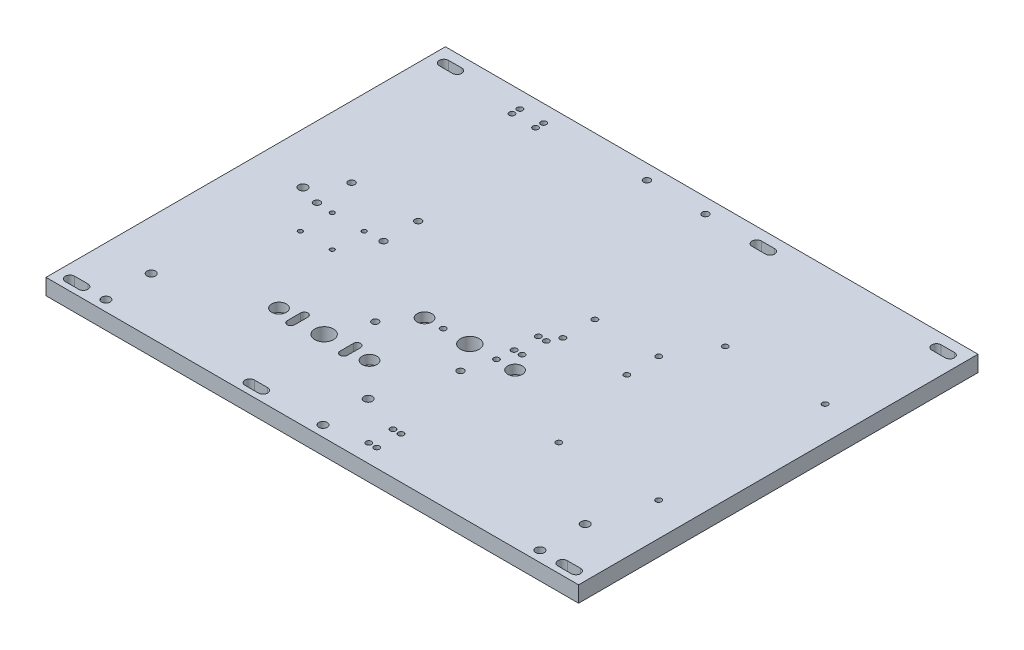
ISO-10303-21;
HEADER;
FILE_DESCRIPTION(('STEP AP214'),'2;1');
FILE_NAME('part.step','',(''),(''),'','','');
FILE_SCHEMA(('AUTOMOTIVE_DESIGN { 1 0 10303 214 1 1 1 1 }'));
ENDSEC;
DATA;
#1=APPLICATION_CONTEXT('core data for automotive mechanical design processes');
#2=APPLICATION_PROTOCOL_DEFINITION('international standard','automotive_design',2000,#1);
#3=PRODUCT_CONTEXT('',#1,'mechanical');
#4=PRODUCT('Part','Part','',(#3));
#5=PRODUCT_RELATED_PRODUCT_CATEGORY('part','',(#4));
#6=PRODUCT_DEFINITION_FORMATION('','',#4);
#7=PRODUCT_DEFINITION_CONTEXT('part definition',#1,'design');
#8=PRODUCT_DEFINITION('design','',#6,#7);
#9=PRODUCT_DEFINITION_SHAPE('','',#8);
#10=(LENGTH_UNIT() NAMED_UNIT(*) SI_UNIT(.MILLI.,.METRE.));
#11=(NAMED_UNIT(*) PLANE_ANGLE_UNIT() SI_UNIT($,.RADIAN.));
#12=(NAMED_UNIT(*) SI_UNIT($,.STERADIAN.) SOLID_ANGLE_UNIT());
#13=UNCERTAINTY_MEASURE_WITH_UNIT(LENGTH_MEASURE(1.E-05),#10,'distance_accuracy_value','');
#14=(GEOMETRIC_REPRESENTATION_CONTEXT(3) GLOBAL_UNCERTAINTY_ASSIGNED_CONTEXT((#13)) GLOBAL_UNIT_ASSIGNED_CONTEXT((#10,
#11,#12)) REPRESENTATION_CONTEXT('',''));
#15=CARTESIAN_POINT('',(0.,0.,0.));
#16=DIRECTION('',(0.,0.,1.));
#17=DIRECTION('',(1.,0.,0.));
#18=AXIS2_PLACEMENT_3D('',#15,#16,#17);
#19=CARTESIAN_POINT('',(-162.,0.,-4.99999999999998));
#20=DIRECTION('',(0.,-1.,0.));
#21=DIRECTION('',(0.,0.,-1.));
#22=AXIS2_PLACEMENT_3D('',#19,#20,#21);
#23=CYLINDRICAL_SURFACE('',#22,5.50000000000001);
#24=CARTESIAN_POINT('',(-162.,6.,-4.99999999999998));
#25=DIRECTION('',(0.,-1.,0.));
#26=DIRECTION('',(0.,0.,-1.));
#27=AXIS2_PLACEMENT_3D('',#24,#25,#26);
#28=CIRCLE('',#27,5.50000000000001);
#29=CARTESIAN_POINT('',(-162.,6.,-10.5));
#30=VERTEX_POINT('',#29);
#31=EDGE_CURVE('E20',#30,#30,#28,.F.);
#32=ORIENTED_EDGE('',*,*,#31,.T.);
#33=EDGE_LOOP('',(#32));
#34=FACE_BOUND('',#33,.T.);
#35=CARTESIAN_POINT('',(-162.,0.,-4.99999999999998));
#36=DIRECTION('',(0.,-1.,0.));
#37=DIRECTION('',(0.,0.,-1.));
#38=AXIS2_PLACEMENT_3D('',#35,#36,#37);
#39=CIRCLE('',#38,5.50000000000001);
#40=CARTESIAN_POINT('',(-162.,0.,-10.5));
#41=VERTEX_POINT('',#40);
#42=EDGE_CURVE('E794',#41,#41,#39,.T.);
#43=ORIENTED_EDGE('',*,*,#42,.T.);
#44=EDGE_LOOP('',(#43));
#45=FACE_BOUND('',#44,.T.);
#46=ADVANCED_FACE('F17',(#34,#45),#23,.F.);
#47=CARTESIAN_POINT('',(-24.5000000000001,12.,82.5));
#48=DIRECTION('',(0.,1.,0.));
#49=DIRECTION('',(0.,0.,1.));
#50=AXIS2_PLACEMENT_3D('',#47,#48,#49);
#51=CYLINDRICAL_SURFACE('',#50,3.19999999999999);
#52=CARTESIAN_POINT('',(-24.5000000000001,0.,82.5));
#53=DIRECTION('',(0.,1.,0.));
#54=DIRECTION('',(0.,0.,1.));
#55=AXIS2_PLACEMENT_3D('',#52,#53,#54);
#56=CIRCLE('',#55,3.19999999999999);
#57=CARTESIAN_POINT('',(-24.5000000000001,0.,85.7));
#58=VERTEX_POINT('',#57);
#59=EDGE_CURVE('E791',#58,#58,#56,.F.);
#60=ORIENTED_EDGE('',*,*,#59,.T.);
#61=EDGE_LOOP('',(#60));
#62=FACE_BOUND('',#61,.T.);
#63=CARTESIAN_POINT('',(-24.5000000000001,5.2,82.5));
#64=DIRECTION('',(0.,1.,0.));
#65=DIRECTION('',(0.,0.,1.));
#66=AXIS2_PLACEMENT_3D('',#63,#64,#65);
#67=CIRCLE('',#66,3.19999999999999);
#68=CARTESIAN_POINT('',(-24.5000000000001,5.2,85.7));
#69=VERTEX_POINT('',#68);
#70=EDGE_CURVE('E823',#69,#69,#67,.T.);
#71=ORIENTED_EDGE('',*,*,#70,.T.);
#72=EDGE_LOOP('',(#71));
#73=FACE_BOUND('',#72,.T.);
#74=ADVANCED_FACE('F1253',(#62,#73),#51,.F.);
#75=CARTESIAN_POINT('',(-92.5000000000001,12.,82.5));
#76=DIRECTION('',(0.,1.,0.));
#77=DIRECTION('',(0.,0.,1.));
#78=AXIS2_PLACEMENT_3D('',#75,#76,#77);
#79=CYLINDRICAL_SURFACE('',#78,3.19999999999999);
#80=CARTESIAN_POINT('',(-92.5000000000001,0.,82.5));
#81=DIRECTION('',(0.,1.,0.));
#82=DIRECTION('',(0.,0.,1.));
#83=AXIS2_PLACEMENT_3D('',#80,#81,#82);
#84=CIRCLE('',#83,3.19999999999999);
#85=CARTESIAN_POINT('',(-92.5000000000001,0.,85.7));
#86=VERTEX_POINT('',#85);
#87=EDGE_CURVE('E788',#86,#86,#84,.F.);
#88=ORIENTED_EDGE('',*,*,#87,.T.);
#89=EDGE_LOOP('',(#88));
#90=FACE_BOUND('',#89,.T.);
#91=CARTESIAN_POINT('',(-92.5000000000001,5.2,82.5));
#92=DIRECTION('',(0.,1.,0.));
#93=DIRECTION('',(0.,0.,1.));
#94=AXIS2_PLACEMENT_3D('',#91,#92,#93);
#95=CIRCLE('',#94,3.19999999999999);
#96=CARTESIAN_POINT('',(-92.5000000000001,5.2,85.7));
#97=VERTEX_POINT('',#96);
#98=EDGE_CURVE('E821',#97,#97,#95,.T.);
#99=ORIENTED_EDGE('',*,*,#98,.T.);
#100=EDGE_LOOP('',(#99));
#101=FACE_BOUND('',#100,.T.);
#102=ADVANCED_FACE('F1250',(#90,#101),#79,.F.);
#103=CARTESIAN_POINT('',(-31.5,12.,34.1896728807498));
#104=DIRECTION('',(0.,1.,0.));
#105=DIRECTION('',(0.,0.,1.));
#106=AXIS2_PLACEMENT_3D('',#103,#104,#105);
#107=CYLINDRICAL_SURFACE('',#106,3.19999999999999);
#108=CARTESIAN_POINT('',(-31.5,0.,34.1896728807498));
#109=DIRECTION('',(0.,1.,0.));
#110=DIRECTION('',(0.,0.,1.));
#111=AXIS2_PLACEMENT_3D('',#108,#109,#110);
#112=CIRCLE('',#111,3.19999999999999);
#113=CARTESIAN_POINT('',(-31.5,0.,37.3896728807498));
#114=VERTEX_POINT('',#113);
#115=EDGE_CURVE('E785',#114,#114,#112,.F.);
#116=ORIENTED_EDGE('',*,*,#115,.T.);
#117=EDGE_LOOP('',(#116));
#118=FACE_BOUND('',#117,.T.);
#119=CARTESIAN_POINT('',(-31.5,5.2,34.1896728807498));
#120=DIRECTION('',(0.,1.,0.));
#121=DIRECTION('',(0.,0.,1.));
#122=AXIS2_PLACEMENT_3D('',#119,#120,#121);
#123=CIRCLE('',#122,3.19999999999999);
#124=CARTESIAN_POINT('',(-31.5,5.2,37.3896728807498));
#125=VERTEX_POINT('',#124);
#126=EDGE_CURVE('E818',#125,#125,#123,.T.);
#127=ORIENTED_EDGE('',*,*,#126,.T.);
#128=EDGE_LOOP('',(#127));
#129=FACE_BOUND('',#128,.T.);
#130=ADVANCED_FACE('F1246',(#118,#129),#107,.F.);
#131=CARTESIAN_POINT('',(36.5,12.,34.1896728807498));
#132=DIRECTION('',(0.,1.,0.));
#133=DIRECTION('',(0.,0.,1.));
#134=AXIS2_PLACEMENT_3D('',#131,#132,#133);
#135=CYLINDRICAL_SURFACE('',#134,3.19999999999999);
#136=CARTESIAN_POINT('',(36.5,0.,34.1896728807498));
#137=DIRECTION('',(0.,1.,0.));
#138=DIRECTION('',(0.,0.,1.));
#139=AXIS2_PLACEMENT_3D('',#136,#137,#138);
#140=CIRCLE('',#139,3.19999999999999);
#141=CARTESIAN_POINT('',(36.5,0.,37.3896728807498));
#142=VERTEX_POINT('',#141);
#143=EDGE_CURVE('E782',#142,#142,#140,.F.);
#144=ORIENTED_EDGE('',*,*,#143,.T.);
#145=EDGE_LOOP('',(#144));
#146=FACE_BOUND('',#145,.T.);
#147=CARTESIAN_POINT('',(36.5,5.2,34.1896728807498));
#148=DIRECTION('',(0.,1.,0.));
#149=DIRECTION('',(0.,0.,1.));
#150=AXIS2_PLACEMENT_3D('',#147,#148,#149);
#151=CIRCLE('',#150,3.19999999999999);
#152=CARTESIAN_POINT('',(36.5,5.2,37.3896728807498));
#153=VERTEX_POINT('',#152);
#154=EDGE_CURVE('E815',#153,#153,#151,.T.);
#155=ORIENTED_EDGE('',*,*,#154,.T.);
#156=EDGE_LOOP('',(#155));
#157=FACE_BOUND('',#156,.T.);
#158=ADVANCED_FACE('F1242',(#146,#157),#135,.F.);
#159=CARTESIAN_POINT('',(-163.,0.,142.));
#160=DIRECTION('',(0.,-1.,0.));
#161=DIRECTION('',(0.,0.,-1.));
#162=AXIS2_PLACEMENT_3D('',#159,#160,#161);
#163=CYLINDRICAL_SURFACE('',#162,5.50000000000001);
#164=CARTESIAN_POINT('',(-163.,6.8,142.));
#165=DIRECTION('',(0.,-1.,0.));
#166=DIRECTION('',(0.,0.,-1.));
#167=AXIS2_PLACEMENT_3D('',#164,#165,#166);
#168=CIRCLE('',#167,5.50000000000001);
#169=CARTESIAN_POINT('',(-163.,6.8,136.5));
#170=VERTEX_POINT('',#169);
#171=EDGE_CURVE('E797',#170,#170,#168,.F.);
#172=ORIENTED_EDGE('',*,*,#171,.T.);
#173=EDGE_LOOP('',(#172));
#174=FACE_BOUND('',#173,.T.);
#175=CARTESIAN_POINT('',(-163.,0.,142.));
#176=DIRECTION('',(0.,-1.,0.));
#177=DIRECTION('',(0.,0.,-1.));
#178=AXIS2_PLACEMENT_3D('',#175,#176,#177);
#179=CIRCLE('',#178,5.50000000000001);
#180=CARTESIAN_POINT('',(-163.,0.,136.5));
#181=VERTEX_POINT('',#180);
#182=EDGE_CURVE('E779',#181,#181,#179,.T.);
#183=ORIENTED_EDGE('',*,*,#182,.T.);
#184=EDGE_LOOP('',(#183));
#185=FACE_BOUND('',#184,.T.);
#186=ADVANCED_FACE('F1238',(#174,#185),#163,.F.);
#187=CARTESIAN_POINT('',(-163.,0.,108.));
#188=DIRECTION('',(0.,-1.,0.));
#189=DIRECTION('',(0.,0.,-1.));
#190=AXIS2_PLACEMENT_3D('',#187,#188,#189);
#191=CYLINDRICAL_SURFACE('',#190,5.50000000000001);
#192=CARTESIAN_POINT('',(-163.,6.8,108.));
#193=DIRECTION('',(0.,-1.,0.));
#194=DIRECTION('',(0.,0.,-1.));
#195=AXIS2_PLACEMENT_3D('',#192,#193,#194);
#196=CIRCLE('',#195,5.50000000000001);
#197=CARTESIAN_POINT('',(-163.,6.8,102.5));
#198=VERTEX_POINT('',#197);
#199=EDGE_CURVE('E800',#198,#198,#196,.F.);
#200=ORIENTED_EDGE('',*,*,#199,.T.);
#201=EDGE_LOOP('',(#200));
#202=FACE_BOUND('',#201,.T.);
#203=CARTESIAN_POINT('',(-163.,0.,108.));
#204=DIRECTION('',(0.,-1.,0.));
#205=DIRECTION('',(0.,0.,-1.));
#206=AXIS2_PLACEMENT_3D('',#203,#204,#205);
#207=CIRCLE('',#206,5.50000000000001);
#208=CARTESIAN_POINT('',(-163.,0.,102.5));
#209=VERTEX_POINT('',#208);
#210=EDGE_CURVE('E776',#209,#209,#207,.T.);
#211=ORIENTED_EDGE('',*,*,#210,.T.);
#212=EDGE_LOOP('',(#211));
#213=FACE_BOUND('',#212,.T.);
#214=ADVANCED_FACE('F1234',(#202,#213),#191,.F.);
#215=CARTESIAN_POINT('',(0.,0.,108.));
#216=DIRECTION('',(0.,-1.,0.));
#217=DIRECTION('',(0.,0.,-1.));
#218=AXIS2_PLACEMENT_3D('',#215,#216,#217);
#219=CYLINDRICAL_SURFACE('',#218,5.49999999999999);
#220=CARTESIAN_POINT('',(0.,6.8,108.));
#221=DIRECTION('',(0.,-1.,0.));
#222=DIRECTION('',(0.,0.,-1.));
#223=AXIS2_PLACEMENT_3D('',#220,#221,#222);
#224=CIRCLE('',#223,5.49999999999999);
#225=CARTESIAN_POINT('',(0.,6.8,102.5));
#226=VERTEX_POINT('',#225);
#227=EDGE_CURVE('E803',#226,#226,#224,.F.);
#228=ORIENTED_EDGE('',*,*,#227,.T.);
#229=EDGE_LOOP('',(#228));
#230=FACE_BOUND('',#229,.T.);
#231=CARTESIAN_POINT('',(0.,0.,108.));
#232=DIRECTION('',(0.,-1.,0.));
#233=DIRECTION('',(0.,0.,-1.));
#234=AXIS2_PLACEMENT_3D('',#231,#232,#233);
#235=CIRCLE('',#234,5.49999999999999);
#236=CARTESIAN_POINT('',(0.,0.,102.5));
#237=VERTEX_POINT('',#236);
#238=EDGE_CURVE('E773',#237,#237,#235,.T.);
#239=ORIENTED_EDGE('',*,*,#238,.T.);
#240=EDGE_LOOP('',(#239));
#241=FACE_BOUND('',#240,.T.);
#242=ADVANCED_FACE('F1230',(#230,#241),#219,.F.);
#243=CARTESIAN_POINT('',(0.,0.,142.));
#244=DIRECTION('',(0.,-1.,0.));
#245=DIRECTION('',(0.,0.,-1.));
#246=AXIS2_PLACEMENT_3D('',#243,#244,#245);
#247=CYLINDRICAL_SURFACE('',#246,5.50000000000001);
#248=CARTESIAN_POINT('',(0.,6.8,142.));
#249=DIRECTION('',(0.,-1.,0.));
#250=DIRECTION('',(0.,0.,-1.));
#251=AXIS2_PLACEMENT_3D('',#248,#249,#250);
#252=CIRCLE('',#251,5.50000000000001);
#253=CARTESIAN_POINT('',(0.,6.8,136.5));
#254=VERTEX_POINT('',#253);
#255=EDGE_CURVE('E806',#254,#254,#252,.F.);
#256=ORIENTED_EDGE('',*,*,#255,.T.);
#257=EDGE_LOOP('',(#256));
#258=FACE_BOUND('',#257,.T.);
#259=CARTESIAN_POINT('',(0.,0.,142.));
#260=DIRECTION('',(0.,-1.,0.));
#261=DIRECTION('',(0.,0.,-1.));
#262=AXIS2_PLACEMENT_3D('',#259,#260,#261);
#263=CIRCLE('',#262,5.50000000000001);
#264=CARTESIAN_POINT('',(0.,0.,136.5));
#265=VERTEX_POINT('',#264);
#266=EDGE_CURVE('E770',#265,#265,#263,.T.);
#267=ORIENTED_EDGE('',*,*,#266,.T.);
#268=EDGE_LOOP('',(#267));
#269=FACE_BOUND('',#268,.T.);
#270=ADVANCED_FACE('F1226',(#258,#269),#247,.F.);
#271=CARTESIAN_POINT('',(163.,0.,142.));
#272=DIRECTION('',(0.,-1.,0.));
#273=DIRECTION('',(0.,0.,-1.));
#274=AXIS2_PLACEMENT_3D('',#271,#272,#273);
#275=CYLINDRICAL_SURFACE('',#274,5.50000000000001);
#276=CARTESIAN_POINT('',(163.,6.8,142.));
#277=DIRECTION('',(0.,-1.,0.));
#278=DIRECTION('',(0.,0.,-1.));
#279=AXIS2_PLACEMENT_3D('',#276,#277,#278);
#280=CIRCLE('',#279,5.50000000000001);
#281=CARTESIAN_POINT('',(163.,6.8,136.5));
#282=VERTEX_POINT('',#281);
#283=EDGE_CURVE('E809',#282,#282,#280,.F.);
#284=ORIENTED_EDGE('',*,*,#283,.T.);
#285=EDGE_LOOP('',(#284));
#286=FACE_BOUND('',#285,.T.);
#287=CARTESIAN_POINT('',(163.,0.,142.));
#288=DIRECTION('',(0.,-1.,0.));
#289=DIRECTION('',(0.,0.,-1.));
#290=AXIS2_PLACEMENT_3D('',#287,#288,#289);
#291=CIRCLE('',#290,5.50000000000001);
#292=CARTESIAN_POINT('',(163.,0.,136.5));
#293=VERTEX_POINT('',#292);
#294=EDGE_CURVE('E767',#293,#293,#291,.T.);
#295=ORIENTED_EDGE('',*,*,#294,.T.);
#296=EDGE_LOOP('',(#295));
#297=FACE_BOUND('',#296,.T.);
#298=ADVANCED_FACE('F1222',(#286,#297),#275,.F.);
#299=CARTESIAN_POINT('',(163.,0.,108.));
#300=DIRECTION('',(0.,-1.,0.));
#301=DIRECTION('',(0.,0.,-1.));
#302=AXIS2_PLACEMENT_3D('',#299,#300,#301);
#303=CYLINDRICAL_SURFACE('',#302,5.50000000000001);
#304=CARTESIAN_POINT('',(163.,6.8,108.));
#305=DIRECTION('',(0.,-1.,0.));
#306=DIRECTION('',(0.,0.,-1.));
#307=AXIS2_PLACEMENT_3D('',#304,#305,#306);
#308=CIRCLE('',#307,5.50000000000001);
#309=CARTESIAN_POINT('',(163.,6.8,102.5));
#310=VERTEX_POINT('',#309);
#311=EDGE_CURVE('E812',#310,#310,#308,.F.);
#312=ORIENTED_EDGE('',*,*,#311,.T.);
#313=EDGE_LOOP('',(#312));
#314=FACE_BOUND('',#313,.T.);
#315=CARTESIAN_POINT('',(163.,0.,108.));
#316=DIRECTION('',(0.,-1.,0.));
#317=DIRECTION('',(0.,0.,-1.));
#318=AXIS2_PLACEMENT_3D('',#315,#316,#317);
#319=CIRCLE('',#318,5.50000000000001);
#320=CARTESIAN_POINT('',(163.,0.,102.5));
#321=VERTEX_POINT('',#320);
#322=EDGE_CURVE('E764',#321,#321,#319,.T.);
#323=ORIENTED_EDGE('',*,*,#322,.T.);
#324=EDGE_LOOP('',(#323));
#325=FACE_BOUND('',#324,.T.);
#326=ADVANCED_FACE('F836',(#314,#325),#303,.F.);
#327=CARTESIAN_POINT('',(-158.75,6.,-4.99999999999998));
#328=DIRECTION('',(0.,1.,0.));
#329=DIRECTION('',(0.,0.,1.));
#330=AXIS2_PLACEMENT_3D('',#327,#328,#329);
#331=PLANE('',#330);
#332=ORIENTED_EDGE('',*,*,#31,.F.);
#333=EDGE_LOOP('',(#332));
#334=FACE_BOUND('',#333,.T.);
#335=CARTESIAN_POINT('',(-162.,6.,-4.99999999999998));
#336=DIRECTION('',(0.,-1.,0.));
#337=DIRECTION('',(0.,0.,-1.));
#338=AXIS2_PLACEMENT_3D('',#335,#336,#337);
#339=CIRCLE('',#338,3.25);
#340=CARTESIAN_POINT('',(-162.,6.,-8.24999999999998));
#341=VERTEX_POINT('',#340);
#342=EDGE_CURVE('E761',#341,#341,#339,.F.);
#343=ORIENTED_EDGE('',*,*,#342,.T.);
#344=EDGE_LOOP('',(#343));
#345=FACE_BOUND('',#344,.T.);
#346=ADVANCED_FACE('F832',(#334,#345),#331,.F.);
#347=CARTESIAN_POINT('',(-21.3000000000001,5.2,82.5));
#348=DIRECTION('',(0.,-1.,0.));
#349=DIRECTION('',(0.,0.,-1.));
#350=AXIS2_PLACEMENT_3D('',#347,#348,#349);
#351=PLANE('',#350);
#352=CARTESIAN_POINT('',(-24.5000000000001,5.2,82.5));
#353=DIRECTION('',(0.,1.,0.));
#354=DIRECTION('',(0.,0.,1.));
#355=AXIS2_PLACEMENT_3D('',#352,#353,#354);
#356=CIRCLE('',#355,5.49999999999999);
#357=CARTESIAN_POINT('',(-24.5000000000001,5.2,88.));
#358=VERTEX_POINT('',#357);
#359=EDGE_CURVE('E722',#358,#358,#356,.T.);
#360=ORIENTED_EDGE('',*,*,#359,.T.);
#361=EDGE_LOOP('',(#360));
#362=FACE_BOUND('',#361,.T.);
#363=ORIENTED_EDGE('',*,*,#70,.F.);
#364=EDGE_LOOP('',(#363));
#365=FACE_BOUND('',#364,.T.);
#366=ADVANCED_FACE('F835',(#362,#365),#351,.F.);
#367=CARTESIAN_POINT('',(-89.3000000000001,5.2,82.5));
#368=DIRECTION('',(0.,-1.,0.));
#369=DIRECTION('',(0.,0.,-1.));
#370=AXIS2_PLACEMENT_3D('',#367,#368,#369);
#371=PLANE('',#370);
#372=CARTESIAN_POINT('',(-92.5000000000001,5.2,82.5));
#373=DIRECTION('',(0.,1.,0.));
#374=DIRECTION('',(0.,0.,1.));
#375=AXIS2_PLACEMENT_3D('',#372,#373,#374);
#376=CIRCLE('',#375,5.50000000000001);
#377=CARTESIAN_POINT('',(-92.5000000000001,5.2,88.0000000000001));
#378=VERTEX_POINT('',#377);
#379=EDGE_CURVE('E268',#378,#378,#376,.T.);
#380=ORIENTED_EDGE('',*,*,#379,.T.);
#381=EDGE_LOOP('',(#380));
#382=FACE_BOUND('',#381,.T.);
#383=ORIENTED_EDGE('',*,*,#98,.F.);
#384=EDGE_LOOP('',(#383));
#385=FACE_BOUND('',#384,.T.);
#386=ADVANCED_FACE('F1212',(#382,#385),#371,.F.);
#387=CARTESIAN_POINT('',(-28.3,5.2,34.1896728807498));
#388=DIRECTION('',(0.,-1.,0.));
#389=DIRECTION('',(0.,0.,-1.));
#390=AXIS2_PLACEMENT_3D('',#387,#388,#389);
#391=PLANE('',#390);
#392=CARTESIAN_POINT('',(-31.5,5.2,34.1896728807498));
#393=DIRECTION('',(0.,1.,0.));
#394=DIRECTION('',(0.,0.,1.));
#395=AXIS2_PLACEMENT_3D('',#392,#393,#394);
#396=CIRCLE('',#395,5.5);
#397=CARTESIAN_POINT('',(-31.5,5.2,39.6896728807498));
#398=VERTEX_POINT('',#397);
#399=EDGE_CURVE('E674',#398,#398,#396,.T.);
#400=ORIENTED_EDGE('',*,*,#399,.T.);
#401=EDGE_LOOP('',(#400));
#402=FACE_BOUND('',#401,.T.);
#403=ORIENTED_EDGE('',*,*,#126,.F.);
#404=EDGE_LOOP('',(#403));
#405=FACE_BOUND('',#404,.T.);
#406=ADVANCED_FACE('F1208',(#402,#405),#391,.F.);
#407=CARTESIAN_POINT('',(39.7,5.2,34.1896728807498));
#408=DIRECTION('',(0.,-1.,0.));
#409=DIRECTION('',(0.,0.,-1.));
#410=AXIS2_PLACEMENT_3D('',#407,#408,#409);
#411=PLANE('',#410);
#412=CARTESIAN_POINT('',(36.5,5.2,34.1896728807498));
#413=DIRECTION('',(0.,1.,0.));
#414=DIRECTION('',(0.,0.,1.));
#415=AXIS2_PLACEMENT_3D('',#412,#413,#414);
#416=CIRCLE('',#415,5.5);
#417=CARTESIAN_POINT('',(36.5,5.2,39.6896728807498));
#418=VERTEX_POINT('',#417);
#419=EDGE_CURVE('E671',#418,#418,#416,.T.);
#420=ORIENTED_EDGE('',*,*,#419,.T.);
#421=EDGE_LOOP('',(#420));
#422=FACE_BOUND('',#421,.T.);
#423=ORIENTED_EDGE('',*,*,#154,.F.);
#424=EDGE_LOOP('',(#423));
#425=FACE_BOUND('',#424,.T.);
#426=ADVANCED_FACE('F1204',(#422,#425),#411,.F.);
#427=CARTESIAN_POINT('',(166.2,6.8,108.));
#428=DIRECTION('',(0.,1.,0.));
#429=DIRECTION('',(0.,0.,1.));
#430=AXIS2_PLACEMENT_3D('',#427,#428,#429);
#431=PLANE('',#430);
#432=ORIENTED_EDGE('',*,*,#311,.F.);
#433=EDGE_LOOP('',(#432));
#434=FACE_BOUND('',#433,.T.);
#435=CARTESIAN_POINT('',(163.,6.8,108.));
#436=DIRECTION('',(0.,-1.,0.));
#437=DIRECTION('',(0.,0.,-1.));
#438=AXIS2_PLACEMENT_3D('',#435,#436,#437);
#439=CIRCLE('',#438,3.20000000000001);
#440=CARTESIAN_POINT('',(163.,6.8,104.8));
#441=VERTEX_POINT('',#440);
#442=EDGE_CURVE('E626',#441,#441,#439,.F.);
#443=ORIENTED_EDGE('',*,*,#442,.T.);
#444=EDGE_LOOP('',(#443));
#445=FACE_BOUND('',#444,.T.);
#446=ADVANCED_FACE('F1200',(#434,#445),#431,.F.);
#447=CARTESIAN_POINT('',(166.2,6.8,142.));
#448=DIRECTION('',(0.,1.,0.));
#449=DIRECTION('',(0.,0.,1.));
#450=AXIS2_PLACEMENT_3D('',#447,#448,#449);
#451=PLANE('',#450);
#452=ORIENTED_EDGE('',*,*,#283,.F.);
#453=EDGE_LOOP('',(#452));
#454=FACE_BOUND('',#453,.T.);
#455=CARTESIAN_POINT('',(163.,6.8,142.));
#456=DIRECTION('',(0.,-1.,0.));
#457=DIRECTION('',(0.,0.,-1.));
#458=AXIS2_PLACEMENT_3D('',#455,#456,#457);
#459=CIRCLE('',#458,3.20000000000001);
#460=CARTESIAN_POINT('',(163.,6.8,138.8));
#461=VERTEX_POINT('',#460);
#462=EDGE_CURVE('E623',#461,#461,#459,.F.);
#463=ORIENTED_EDGE('',*,*,#462,.T.);
#464=EDGE_LOOP('',(#463));
#465=FACE_BOUND('',#464,.T.);
#466=ADVANCED_FACE('F1196',(#454,#465),#451,.F.);
#467=CARTESIAN_POINT('',(3.20000000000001,6.8,142.));
#468=DIRECTION('',(0.,1.,0.));
#469=DIRECTION('',(0.,0.,1.));
#470=AXIS2_PLACEMENT_3D('',#467,#468,#469);
#471=PLANE('',#470);
#472=ORIENTED_EDGE('',*,*,#255,.F.);
#473=EDGE_LOOP('',(#472));
#474=FACE_BOUND('',#473,.T.);
#475=CARTESIAN_POINT('',(0.,6.8,142.));
#476=DIRECTION('',(0.,-1.,0.));
#477=DIRECTION('',(0.,0.,-1.));
#478=AXIS2_PLACEMENT_3D('',#475,#476,#477);
#479=CIRCLE('',#478,3.20000000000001);
#480=CARTESIAN_POINT('',(0.,6.8,138.8));
#481=VERTEX_POINT('',#480);
#482=EDGE_CURVE('E620',#481,#481,#479,.F.);
#483=ORIENTED_EDGE('',*,*,#482,.T.);
#484=EDGE_LOOP('',(#483));
#485=FACE_BOUND('',#484,.T.);
#486=ADVANCED_FACE('F1192',(#474,#485),#471,.F.);
#487=CARTESIAN_POINT('',(3.20000000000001,6.8,108.));
#488=DIRECTION('',(0.,1.,0.));
#489=DIRECTION('',(0.,0.,1.));
#490=AXIS2_PLACEMENT_3D('',#487,#488,#489);
#491=PLANE('',#490);
#492=ORIENTED_EDGE('',*,*,#227,.F.);
#493=EDGE_LOOP('',(#492));
#494=FACE_BOUND('',#493,.T.);
#495=CARTESIAN_POINT('',(0.,6.8,108.));
#496=DIRECTION('',(0.,-1.,0.));
#497=DIRECTION('',(0.,0.,-1.));
#498=AXIS2_PLACEMENT_3D('',#495,#496,#497);
#499=CIRCLE('',#498,3.19999999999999);
#500=CARTESIAN_POINT('',(0.,6.8,104.8));
#501=VERTEX_POINT('',#500);
#502=EDGE_CURVE('E617',#501,#501,#499,.F.);
#503=ORIENTED_EDGE('',*,*,#502,.T.);
#504=EDGE_LOOP('',(#503));
#505=FACE_BOUND('',#504,.T.);
#506=ADVANCED_FACE('F1188',(#494,#505),#491,.F.);
#507=CARTESIAN_POINT('',(-159.8,6.8,108.));
#508=DIRECTION('',(0.,1.,0.));
#509=DIRECTION('',(0.,0.,1.));
#510=AXIS2_PLACEMENT_3D('',#507,#508,#509);
#511=PLANE('',#510);
#512=ORIENTED_EDGE('',*,*,#199,.F.);
#513=EDGE_LOOP('',(#512));
#514=FACE_BOUND('',#513,.T.);
#515=CARTESIAN_POINT('',(-163.,6.8,108.));
#516=DIRECTION('',(0.,-1.,0.));
#517=DIRECTION('',(0.,0.,-1.));
#518=AXIS2_PLACEMENT_3D('',#515,#516,#517);
#519=CIRCLE('',#518,3.20000000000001);
#520=CARTESIAN_POINT('',(-163.,6.8,104.8));
#521=VERTEX_POINT('',#520);
#522=EDGE_CURVE('E614',#521,#521,#519,.F.);
#523=ORIENTED_EDGE('',*,*,#522,.T.);
#524=EDGE_LOOP('',(#523));
#525=FACE_BOUND('',#524,.T.);
#526=ADVANCED_FACE('F1184',(#514,#525),#511,.F.);
#527=CARTESIAN_POINT('',(-159.8,6.8,142.));
#528=DIRECTION('',(0.,1.,0.));
#529=DIRECTION('',(0.,0.,1.));
#530=AXIS2_PLACEMENT_3D('',#527,#528,#529);
#531=PLANE('',#530);
#532=ORIENTED_EDGE('',*,*,#171,.F.);
#533=EDGE_LOOP('',(#532));
#534=FACE_BOUND('',#533,.T.);
#535=CARTESIAN_POINT('',(-163.,6.8,142.));
#536=DIRECTION('',(0.,-1.,0.));
#537=DIRECTION('',(0.,0.,-1.));
#538=AXIS2_PLACEMENT_3D('',#535,#536,#537);
#539=CIRCLE('',#538,3.20000000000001);
#540=CARTESIAN_POINT('',(-163.,6.8,138.8));
#541=VERTEX_POINT('',#540);
#542=EDGE_CURVE('E611',#541,#541,#539,.F.);
#543=ORIENTED_EDGE('',*,*,#542,.T.);
#544=EDGE_LOOP('',(#543));
#545=FACE_BOUND('',#544,.T.);
#546=ADVANCED_FACE('F1180',(#534,#545),#531,.F.);
#547=CARTESIAN_POINT('',(0.,0.,0.));
#548=DIRECTION('',(0.,1.,0.));
#549=DIRECTION('',(0.,0.,1.));
#550=AXIS2_PLACEMENT_3D('',#547,#548,#549);
#551=PLANE('',#550);
#552=CARTESIAN_POINT('',(22.5,0.,34.18967288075));
#553=DIRECTION('',(0.,-1.,0.));
#554=DIRECTION('',(0.,0.,-1.));
#555=AXIS2_PLACEMENT_3D('',#552,#553,#554);
#556=CIRCLE('',#555,2.09999999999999);
#557=CARTESIAN_POINT('',(22.5,0.,32.08967288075));
#558=VERTEX_POINT('',#557);
#559=EDGE_CURVE('E668',#558,#558,#556,.F.);
#560=ORIENTED_EDGE('',*,*,#559,.T.);
#561=EDGE_LOOP('',(#560));
#562=FACE_BOUND('',#561,.T.);
#563=DIRECTION('',(1.,0.,0.));
#564=VECTOR('',#563,1.);
#565=CARTESIAN_POINT('',(0.,0.,150.));
#566=LINE('',#565,#564);
#567=CARTESIAN_POINT('',(200.,0.,150.));
#568=VERTEX_POINT('',#567);
#569=CARTESIAN_POINT('',(-200.,0.,150.));
#570=VERTEX_POINT('',#569);
#571=EDGE_CURVE('E653',#568,#570,#566,.F.);
#572=ORIENTED_EDGE('',*,*,#571,.T.);
#573=DIRECTION('',(0.,0.,1.));
#574=VECTOR('',#573,1.);
#575=CARTESIAN_POINT('',(-200.,0.,0.));
#576=LINE('',#575,#574);
#577=CARTESIAN_POINT('',(-200.,0.,-150.));
#578=VERTEX_POINT('',#577);
#579=EDGE_CURVE('E657',#570,#578,#576,.F.);
#580=ORIENTED_EDGE('',*,*,#579,.T.);
#581=DIRECTION('',(1.,0.,0.));
#582=VECTOR('',#581,1.);
#583=CARTESIAN_POINT('',(0.,0.,-150.));
#584=LINE('',#583,#582);
#585=CARTESIAN_POINT('',(200.,0.,-150.));
#586=VERTEX_POINT('',#585);
#587=EDGE_CURVE('E662',#578,#586,#584,.T.);
#588=ORIENTED_EDGE('',*,*,#587,.T.);
#589=DIRECTION('',(0.,0.,1.));
#590=VECTOR('',#589,1.);
#591=CARTESIAN_POINT('',(200.,0.,0.));
#592=LINE('',#591,#590);
#593=EDGE_CURVE('E666',#586,#568,#592,.T.);
#594=ORIENTED_EDGE('',*,*,#593,.T.);
#595=EDGE_LOOP('',(#572,#580,#588,#594));
#596=FACE_BOUND('',#595,.T.);
#597=CARTESIAN_POINT('',(6.50000000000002,0.,-138.81032711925));
#598=DIRECTION('',(0.,1.,0.));
#599=DIRECTION('',(0.,0.,1.));
#600=AXIS2_PLACEMENT_3D('',#597,#598,#599);
#601=CIRCLE('',#600,2.5);
#602=CARTESIAN_POINT('',(6.50000000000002,0.,-136.31032711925));
#603=VERTEX_POINT('',#602);
#604=EDGE_CURVE('E650',#603,#603,#601,.T.);
#605=ORIENTED_EDGE('',*,*,#604,.T.);
#606=EDGE_LOOP('',(#605));
#607=FACE_BOUND('',#606,.T.);
#608=CARTESIAN_POINT('',(-37.5000000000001,0.,-138.81032711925));
#609=DIRECTION('',(0.,1.,0.));
#610=DIRECTION('',(0.,0.,1.));
#611=AXIS2_PLACEMENT_3D('',#608,#609,#610);
#612=CIRCLE('',#611,2.5);
#613=CARTESIAN_POINT('',(-37.5000000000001,0.,-136.31032711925));
#614=VERTEX_POINT('',#613);
#615=EDGE_CURVE('E647',#614,#614,#612,.T.);
#616=ORIENTED_EDGE('',*,*,#615,.T.);
#617=EDGE_LOOP('',(#616));
#618=FACE_BOUND('',#617,.T.);
#619=CARTESIAN_POINT('',(-47.5,0.,55.18967288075));
#620=DIRECTION('',(0.,1.,0.));
#621=DIRECTION('',(0.,0.,1.));
#622=AXIS2_PLACEMENT_3D('',#619,#620,#621);
#623=CIRCLE('',#622,2.49999999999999);
#624=CARTESIAN_POINT('',(-47.5,0.,57.68967288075));
#625=VERTEX_POINT('',#624);
#626=EDGE_CURVE('E644',#625,#625,#623,.T.);
#627=ORIENTED_EDGE('',*,*,#626,.T.);
#628=EDGE_LOOP('',(#627));
#629=FACE_BOUND('',#628,.T.);
#630=CARTESIAN_POINT('',(16.5,0.,55.18967288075));
#631=DIRECTION('',(0.,1.,0.));
#632=DIRECTION('',(0.,0.,1.));
#633=AXIS2_PLACEMENT_3D('',#630,#631,#632);
#634=CIRCLE('',#633,2.49999999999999);
#635=CARTESIAN_POINT('',(16.5,0.,57.68967288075));
#636=VERTEX_POINT('',#635);
#637=EDGE_CURVE('E641',#636,#636,#634,.T.);
#638=ORIENTED_EDGE('',*,*,#637,.T.);
#639=EDGE_LOOP('',(#638));
#640=FACE_BOUND('',#639,.T.);
#641=CARTESIAN_POINT('',(-96.8,0.,-26.2999999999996));
#642=DIRECTION('',(0.,1.,0.));
#643=DIRECTION('',(0.,0.,1.));
#644=AXIS2_PLACEMENT_3D('',#641,#642,#643);
#645=CIRCLE('',#644,2.5);
#646=CARTESIAN_POINT('',(-96.8,0.,-23.7999999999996));
#647=VERTEX_POINT('',#646);
#648=EDGE_CURVE('E638',#647,#647,#645,.T.);
#649=ORIENTED_EDGE('',*,*,#648,.T.);
#650=EDGE_LOOP('',(#649));
#651=FACE_BOUND('',#650,.T.);
#652=CARTESIAN_POINT('',(-96.8,0.,-0.299999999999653));
#653=DIRECTION('',(0.,1.,0.));
#654=DIRECTION('',(0.,0.,1.));
#655=AXIS2_PLACEMENT_3D('',#652,#653,#654);
#656=CIRCLE('',#655,2.5);
#657=CARTESIAN_POINT('',(-96.8,0.,2.20000000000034));
#658=VERTEX_POINT('',#657);
#659=EDGE_CURVE('E635',#658,#658,#656,.T.);
#660=ORIENTED_EDGE('',*,*,#659,.T.);
#661=EDGE_LOOP('',(#660));
#662=FACE_BOUND('',#661,.T.);
#663=CARTESIAN_POINT('',(-146.8,0.,-0.299999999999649));
#664=DIRECTION('',(0.,1.,0.));
#665=DIRECTION('',(0.,0.,1.));
#666=AXIS2_PLACEMENT_3D('',#663,#664,#665);
#667=CIRCLE('',#666,2.49999999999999);
#668=CARTESIAN_POINT('',(-146.8,0.,2.20000000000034));
#669=VERTEX_POINT('',#668);
#670=EDGE_CURVE('E632',#669,#669,#667,.T.);
#671=ORIENTED_EDGE('',*,*,#670,.T.);
#672=EDGE_LOOP('',(#671));
#673=FACE_BOUND('',#672,.T.);
#674=CARTESIAN_POINT('',(-146.8,0.,-26.2999999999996));
#675=DIRECTION('',(0.,1.,0.));
#676=DIRECTION('',(0.,0.,1.));
#677=AXIS2_PLACEMENT_3D('',#674,#675,#676);
#678=CIRCLE('',#677,2.49999999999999);
#679=CARTESIAN_POINT('',(-146.8,0.,-23.7999999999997));
#680=VERTEX_POINT('',#679);
#681=EDGE_CURVE('E629',#680,#680,#678,.T.);
#682=ORIENTED_EDGE('',*,*,#681,.T.);
#683=EDGE_LOOP('',(#682));
#684=FACE_BOUND('',#683,.T.);
#685=ORIENTED_EDGE('',*,*,#322,.F.);
#686=EDGE_LOOP('',(#685));
#687=FACE_BOUND('',#686,.T.);
#688=ORIENTED_EDGE('',*,*,#294,.F.);
#689=EDGE_LOOP('',(#688));
#690=FACE_BOUND('',#689,.T.);
#691=ORIENTED_EDGE('',*,*,#266,.F.);
#692=EDGE_LOOP('',(#691));
#693=FACE_BOUND('',#692,.T.);
#694=ORIENTED_EDGE('',*,*,#238,.F.);
#695=EDGE_LOOP('',(#694));
#696=FACE_BOUND('',#695,.T.);
#697=ORIENTED_EDGE('',*,*,#210,.F.);
#698=EDGE_LOOP('',(#697));
#699=FACE_BOUND('',#698,.T.);
#700=ORIENTED_EDGE('',*,*,#182,.F.);
#701=EDGE_LOOP('',(#700));
#702=FACE_BOUND('',#701,.T.);
#703=CARTESIAN_POINT('',(100.,0.,64.8574074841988));
#704=DIRECTION('',(0.,1.,0.));
#705=DIRECTION('',(0.,0.,1.));
#706=AXIS2_PLACEMENT_3D('',#703,#704,#705);
#707=CIRCLE('',#706,2.09999999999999);
#708=CARTESIAN_POINT('',(100.,0.,66.9574074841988));
#709=VERTEX_POINT('',#708);
#710=EDGE_CURVE('E608',#709,#709,#707,.T.);
#711=ORIENTED_EDGE('',*,*,#710,.T.);
#712=EDGE_LOOP('',(#711));
#713=FACE_BOUND('',#712,.T.);
#714=CARTESIAN_POINT('',(175.,0.,64.8574074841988));
#715=DIRECTION('',(0.,1.,0.));
#716=DIRECTION('',(0.,0.,1.));
#717=AXIS2_PLACEMENT_3D('',#714,#715,#716);
#718=CIRCLE('',#717,2.09999999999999);
#719=CARTESIAN_POINT('',(175.,0.,66.9574074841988));
#720=VERTEX_POINT('',#719);
#721=EDGE_CURVE('E605',#720,#720,#718,.T.);
#722=ORIENTED_EDGE('',*,*,#721,.T.);
#723=EDGE_LOOP('',(#722));
#724=FACE_BOUND('',#723,.T.);
#725=CARTESIAN_POINT('',(175.,0.,-60.1425925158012));
#726=DIRECTION('',(0.,1.,0.));
#727=DIRECTION('',(0.,0.,1.));
#728=AXIS2_PLACEMENT_3D('',#725,#726,#727);
#729=CIRCLE('',#728,2.09999999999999);
#730=CARTESIAN_POINT('',(175.,0.,-58.0425925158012));
#731=VERTEX_POINT('',#730);
#732=EDGE_CURVE('E602',#731,#731,#729,.T.);
#733=ORIENTED_EDGE('',*,*,#732,.T.);
#734=EDGE_LOOP('',(#733));
#735=FACE_BOUND('',#734,.T.);
#736=CARTESIAN_POINT('',(100.,0.,-60.1425925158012));
#737=DIRECTION('',(0.,1.,0.));
#738=DIRECTION('',(0.,0.,1.));
#739=AXIS2_PLACEMENT_3D('',#736,#737,#738);
#740=CIRCLE('',#739,2.09999999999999);
#741=CARTESIAN_POINT('',(100.,0.,-58.0425925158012));
#742=VERTEX_POINT('',#741);
#743=EDGE_CURVE('E599',#742,#742,#740,.T.);
#744=ORIENTED_EDGE('',*,*,#743,.T.);
#745=EDGE_LOOP('',(#744));
#746=FACE_BOUND('',#745,.T.);
#747=CARTESIAN_POINT('',(-190.,0.,-138.81032711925));
#748=DIRECTION('',(0.,1.,0.));
#749=DIRECTION('',(0.,0.,1.));
#750=AXIS2_PLACEMENT_3D('',#747,#748,#749);
#751=CIRCLE('',#750,3.5);
#752=CARTESIAN_POINT('',(-190.,0.,-142.31032711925));
#753=VERTEX_POINT('',#752);
#754=CARTESIAN_POINT('',(-190.,0.,-135.31032711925));
#755=VERTEX_POINT('',#754);
#756=EDGE_CURVE('E597',#753,#755,#751,.T.);
#757=ORIENTED_EDGE('',*,*,#756,.T.);
#758=DIRECTION('',(1.,0.,0.));
#759=VECTOR('',#758,1.);
#760=CARTESIAN_POINT('',(0.,0.,-135.31032711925));
#761=LINE('',#760,#759);
#762=CARTESIAN_POINT('',(-180.,0.,-135.31032711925));
#763=VERTEX_POINT('',#762);
#764=EDGE_CURVE('E588',#755,#763,#761,.T.);
#765=ORIENTED_EDGE('',*,*,#764,.T.);
#766=CARTESIAN_POINT('',(-180.,0.,-138.81032711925));
#767=DIRECTION('',(0.,1.,0.));
#768=DIRECTION('',(0.,0.,1.));
#769=AXIS2_PLACEMENT_3D('',#766,#767,#768);
#770=CIRCLE('',#769,3.49999999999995);
#771=CARTESIAN_POINT('',(-180.,0.,-142.31032711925));
#772=VERTEX_POINT('',#771);
#773=EDGE_CURVE('E591',#763,#772,#770,.T.);
#774=ORIENTED_EDGE('',*,*,#773,.T.);
#775=DIRECTION('',(1.,0.,0.));
#776=VECTOR('',#775,1.);
#777=CARTESIAN_POINT('',(0.,0.,-142.31032711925));
#778=LINE('',#777,#776);
#779=EDGE_CURVE('E595',#772,#753,#778,.F.);
#780=ORIENTED_EDGE('',*,*,#779,.T.);
#781=EDGE_LOOP('',(#757,#765,#774,#780));
#782=FACE_BOUND('',#781,.T.);
#783=CARTESIAN_POINT('',(190.,0.,-138.81032711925));
#784=DIRECTION('',(0.,1.,0.));
#785=DIRECTION('',(0.,0.,1.));
#786=AXIS2_PLACEMENT_3D('',#783,#784,#785);
#787=CIRCLE('',#786,3.50000000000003);
#788=CARTESIAN_POINT('',(190.,0.,-135.31032711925));
#789=VERTEX_POINT('',#788);
#790=CARTESIAN_POINT('',(190.,0.,-142.31032711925));
#791=VERTEX_POINT('',#790);
#792=EDGE_CURVE('E585',#789,#791,#787,.T.);
#793=ORIENTED_EDGE('',*,*,#792,.T.);
#794=DIRECTION('',(1.,0.,0.));
#795=VECTOR('',#794,1.);
#796=CARTESIAN_POINT('',(0.,0.,-142.31032711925));
#797=LINE('',#796,#795);
#798=CARTESIAN_POINT('',(180.,0.,-142.31032711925));
#799=VERTEX_POINT('',#798);
#800=EDGE_CURVE('E576',#791,#799,#797,.F.);
#801=ORIENTED_EDGE('',*,*,#800,.T.);
#802=CARTESIAN_POINT('',(180.,0.,-138.81032711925));
#803=DIRECTION('',(0.,1.,0.));
#804=DIRECTION('',(0.,0.,1.));
#805=AXIS2_PLACEMENT_3D('',#802,#803,#804);
#806=CIRCLE('',#805,3.50000000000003);
#807=CARTESIAN_POINT('',(180.,0.,-135.31032711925));
#808=VERTEX_POINT('',#807);
#809=EDGE_CURVE('E579',#799,#808,#806,.T.);
#810=ORIENTED_EDGE('',*,*,#809,.T.);
#811=DIRECTION('',(1.,0.,0.));
#812=VECTOR('',#811,1.);
#813=CARTESIAN_POINT('',(0.,0.,-135.31032711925));
#814=LINE('',#813,#812);
#815=EDGE_CURVE('E583',#808,#789,#814,.T.);
#816=ORIENTED_EDGE('',*,*,#815,.T.);
#817=EDGE_LOOP('',(#793,#801,#810,#816));
#818=FACE_BOUND('',#817,.T.);
#819=CARTESIAN_POINT('',(190.,0.,142.));
#820=DIRECTION('',(0.,1.,0.));
#821=DIRECTION('',(0.,0.,1.));
#822=AXIS2_PLACEMENT_3D('',#819,#820,#821);
#823=CIRCLE('',#822,3.5);
#824=CARTESIAN_POINT('',(190.,0.,145.5));
#825=VERTEX_POINT('',#824);
#826=CARTESIAN_POINT('',(190.,0.,138.5));
#827=VERTEX_POINT('',#826);
#828=EDGE_CURVE('E573',#825,#827,#823,.T.);
#829=ORIENTED_EDGE('',*,*,#828,.T.);
#830=DIRECTION('',(1.,0.,0.));
#831=VECTOR('',#830,1.);
#832=CARTESIAN_POINT('',(0.,0.,138.5));
#833=LINE('',#832,#831);
#834=CARTESIAN_POINT('',(180.,0.,138.5));
#835=VERTEX_POINT('',#834);
#836=EDGE_CURVE('E564',#827,#835,#833,.F.);
#837=ORIENTED_EDGE('',*,*,#836,.T.);
#838=CARTESIAN_POINT('',(180.,0.,142.));
#839=DIRECTION('',(0.,1.,0.));
#840=DIRECTION('',(0.,0.,1.));
#841=AXIS2_PLACEMENT_3D('',#838,#839,#840);
#842=CIRCLE('',#841,3.5);
#843=CARTESIAN_POINT('',(180.,0.,145.5));
#844=VERTEX_POINT('',#843);
#845=EDGE_CURVE('E567',#835,#844,#842,.T.);
#846=ORIENTED_EDGE('',*,*,#845,.T.);
#847=DIRECTION('',(1.,0.,0.));
#848=VECTOR('',#847,1.);
#849=CARTESIAN_POINT('',(0.,0.,145.5));
#850=LINE('',#849,#848);
#851=EDGE_CURVE('E571',#844,#825,#850,.T.);
#852=ORIENTED_EDGE('',*,*,#851,.T.);
#853=EDGE_LOOP('',(#829,#837,#846,#852));
#854=FACE_BOUND('',#853,.T.);
#855=CARTESIAN_POINT('',(-190.,0.,142.));
#856=DIRECTION('',(0.,1.,0.));
#857=DIRECTION('',(0.,0.,1.));
#858=AXIS2_PLACEMENT_3D('',#855,#856,#857);
#859=CIRCLE('',#858,3.5);
#860=CARTESIAN_POINT('',(-190.,0.,138.5));
#861=VERTEX_POINT('',#860);
#862=CARTESIAN_POINT('',(-190.,0.,145.5));
#863=VERTEX_POINT('',#862);
#864=EDGE_CURVE('E561',#861,#863,#859,.T.);
#865=ORIENTED_EDGE('',*,*,#864,.T.);
#866=DIRECTION('',(1.,0.,0.));
#867=VECTOR('',#866,1.);
#868=CARTESIAN_POINT('',(0.,0.,145.5));
#869=LINE('',#868,#867);
#870=CARTESIAN_POINT('',(-180.,0.,145.5));
#871=VERTEX_POINT('',#870);
#872=EDGE_CURVE('E552',#863,#871,#869,.T.);
#873=ORIENTED_EDGE('',*,*,#872,.T.);
#874=CARTESIAN_POINT('',(-180.,0.,142.));
#875=DIRECTION('',(0.,1.,0.));
#876=DIRECTION('',(0.,0.,1.));
#877=AXIS2_PLACEMENT_3D('',#874,#875,#876);
#878=CIRCLE('',#877,3.5);
#879=CARTESIAN_POINT('',(-180.,0.,138.5));
#880=VERTEX_POINT('',#879);
#881=EDGE_CURVE('E555',#871,#880,#878,.T.);
#882=ORIENTED_EDGE('',*,*,#881,.T.);
#883=DIRECTION('',(1.,0.,0.));
#884=VECTOR('',#883,1.);
#885=CARTESIAN_POINT('',(0.,0.,138.5));
#886=LINE('',#885,#884);
#887=EDGE_CURVE('E559',#880,#861,#886,.F.);
#888=ORIENTED_EDGE('',*,*,#887,.T.);
#889=EDGE_LOOP('',(#865,#873,#882,#888));
#890=FACE_BOUND('',#889,.T.);
#891=CARTESIAN_POINT('',(-55.,0.,142.));
#892=DIRECTION('',(0.,1.,0.));
#893=DIRECTION('',(0.,0.,1.));
#894=AXIS2_PLACEMENT_3D('',#891,#892,#893);
#895=CIRCLE('',#894,3.5);
#896=CARTESIAN_POINT('',(-55.,0.,138.5));
#897=VERTEX_POINT('',#896);
#898=CARTESIAN_POINT('',(-55.,0.,145.5));
#899=VERTEX_POINT('',#898);
#900=EDGE_CURVE('E549',#897,#899,#895,.T.);
#901=ORIENTED_EDGE('',*,*,#900,.T.);
#902=DIRECTION('',(1.,0.,0.));
#903=VECTOR('',#902,1.);
#904=CARTESIAN_POINT('',(0.,0.,145.5));
#905=LINE('',#904,#903);
#906=CARTESIAN_POINT('',(-45.,0.,145.5));
#907=VERTEX_POINT('',#906);
#908=EDGE_CURVE('E540',#899,#907,#905,.T.);
#909=ORIENTED_EDGE('',*,*,#908,.T.);
#910=CARTESIAN_POINT('',(-45.,0.,142.));
#911=DIRECTION('',(0.,1.,0.));
#912=DIRECTION('',(0.,0.,1.));
#913=AXIS2_PLACEMENT_3D('',#910,#911,#912);
#914=CIRCLE('',#913,3.5);
#915=CARTESIAN_POINT('',(-45.,0.,138.5));
#916=VERTEX_POINT('',#915);
#917=EDGE_CURVE('E543',#907,#916,#914,.T.);
#918=ORIENTED_EDGE('',*,*,#917,.T.);
#919=DIRECTION('',(1.,0.,0.));
#920=VECTOR('',#919,1.);
#921=CARTESIAN_POINT('',(0.,0.,138.5));
#922=LINE('',#921,#920);
#923=EDGE_CURVE('E547',#916,#897,#922,.F.);
#924=ORIENTED_EDGE('',*,*,#923,.T.);
#925=EDGE_LOOP('',(#901,#909,#918,#924));
#926=FACE_BOUND('',#925,.T.);
#927=CARTESIAN_POINT('',(45.,0.,-138.81032711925));
#928=DIRECTION('',(0.,1.,0.));
#929=DIRECTION('',(0.,0.,1.));
#930=AXIS2_PLACEMENT_3D('',#927,#928,#929);
#931=CIRCLE('',#930,3.5);
#932=CARTESIAN_POINT('',(45.,0.,-142.31032711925));
#933=VERTEX_POINT('',#932);
#934=CARTESIAN_POINT('',(45.,0.,-135.31032711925));
#935=VERTEX_POINT('',#934);
#936=EDGE_CURVE('E537',#933,#935,#931,.T.);
#937=ORIENTED_EDGE('',*,*,#936,.T.);
#938=DIRECTION('',(1.,0.,0.));
#939=VECTOR('',#938,1.);
#940=CARTESIAN_POINT('',(0.,0.,-135.31032711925));
#941=LINE('',#940,#939);
#942=CARTESIAN_POINT('',(55.,0.,-135.31032711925));
#943=VERTEX_POINT('',#942);
#944=EDGE_CURVE('E528',#935,#943,#941,.T.);
#945=ORIENTED_EDGE('',*,*,#944,.T.);
#946=CARTESIAN_POINT('',(55.,0.,-138.81032711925));
#947=DIRECTION('',(0.,1.,0.));
#948=DIRECTION('',(0.,0.,1.));
#949=AXIS2_PLACEMENT_3D('',#946,#947,#948);
#950=CIRCLE('',#949,3.5);
#951=CARTESIAN_POINT('',(55.,0.,-142.31032711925));
#952=VERTEX_POINT('',#951);
#953=EDGE_CURVE('E531',#943,#952,#950,.T.);
#954=ORIENTED_EDGE('',*,*,#953,.T.);
#955=DIRECTION('',(1.,0.,0.));
#956=VECTOR('',#955,1.);
#957=CARTESIAN_POINT('',(0.,0.,-142.31032711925));
#958=LINE('',#957,#956);
#959=EDGE_CURVE('E535',#952,#933,#958,.F.);
#960=ORIENTED_EDGE('',*,*,#959,.T.);
#961=EDGE_LOOP('',(#937,#945,#954,#960));
#962=FACE_BOUND('',#961,.T.);
#963=CARTESIAN_POINT('',(2.5,0.,34.18967288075));
#964=DIRECTION('',(0.,1.,0.));
#965=DIRECTION('',(0.,0.,1.));
#966=AXIS2_PLACEMENT_3D('',#963,#964,#965);
#967=CIRCLE('',#966,7.);
#968=CARTESIAN_POINT('',(2.5,0.,41.18967288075));
#969=VERTEX_POINT('',#968);
#970=EDGE_CURVE('E525',#969,#969,#967,.T.);
#971=ORIENTED_EDGE('',*,*,#970,.T.);
#972=EDGE_LOOP('',(#971));
#973=FACE_BOUND('',#972,.T.);
#974=CARTESIAN_POINT('',(-17.5,0.,34.18967288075));
#975=DIRECTION('',(0.,-1.,0.));
#976=DIRECTION('',(0.,0.,-1.));
#977=AXIS2_PLACEMENT_3D('',#974,#975,#976);
#978=CIRCLE('',#977,2.09999999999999);
#979=CARTESIAN_POINT('',(-17.5,0.,32.08967288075));
#980=VERTEX_POINT('',#979);
#981=EDGE_CURVE('E522',#980,#980,#978,.F.);
#982=ORIENTED_EDGE('',*,*,#981,.T.);
#983=EDGE_LOOP('',(#982));
#984=FACE_BOUND('',#983,.T.);
#985=ORIENTED_EDGE('',*,*,#143,.F.);
#986=EDGE_LOOP('',(#985));
#987=FACE_BOUND('',#986,.T.);
#988=ORIENTED_EDGE('',*,*,#115,.F.);
#989=EDGE_LOOP('',(#988));
#990=FACE_BOUND('',#989,.T.);
#991=CARTESIAN_POINT('',(81.5000000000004,0.,-4.72384803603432));
#992=DIRECTION('',(0.,1.,0.));
#993=DIRECTION('',(0.,0.,1.));
#994=AXIS2_PLACEMENT_3D('',#991,#992,#993);
#995=CIRCLE('',#994,2.09999999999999);
#996=CARTESIAN_POINT('',(81.5000000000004,0.,-2.62384803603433));
#997=VERTEX_POINT('',#996);
#998=EDGE_CURVE('E677',#997,#997,#995,.T.);
#999=ORIENTED_EDGE('',*,*,#998,.T.);
#1000=EDGE_LOOP('',(#999));
#1001=FACE_BOUND('',#1000,.T.);
#1002=CARTESIAN_POINT('',(81.5000000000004,0.,-28.7238480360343));
#1003=DIRECTION('',(0.,1.,0.));
#1004=DIRECTION('',(0.,0.,1.));
#1005=AXIS2_PLACEMENT_3D('',#1002,#1003,#1004);
#1006=CIRCLE('',#1005,2.09999999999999);
#1007=CARTESIAN_POINT('',(81.5000000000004,0.,-26.6238480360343));
#1008=VERTEX_POINT('',#1007);
#1009=EDGE_CURVE('E680',#1008,#1008,#1006,.T.);
#1010=ORIENTED_EDGE('',*,*,#1009,.T.);
#1011=EDGE_LOOP('',(#1010));
#1012=FACE_BOUND('',#1011,.T.);
#1013=CARTESIAN_POINT('',(33.5000000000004,0.,-4.72384803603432));
#1014=DIRECTION('',(0.,1.,0.));
#1015=DIRECTION('',(0.,0.,1.));
#1016=AXIS2_PLACEMENT_3D('',#1013,#1014,#1015);
#1017=CIRCLE('',#1016,2.09999999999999);
#1018=CARTESIAN_POINT('',(33.5000000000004,0.,-2.62384803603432));
#1019=VERTEX_POINT('',#1018);
#1020=EDGE_CURVE('E683',#1019,#1019,#1017,.T.);
#1021=ORIENTED_EDGE('',*,*,#1020,.T.);
#1022=EDGE_LOOP('',(#1021));
#1023=FACE_BOUND('',#1022,.T.);
#1024=CARTESIAN_POINT('',(33.5000000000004,0.,-28.7238480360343));
#1025=DIRECTION('',(0.,1.,0.));
#1026=DIRECTION('',(0.,0.,1.));
#1027=AXIS2_PLACEMENT_3D('',#1024,#1025,#1026);
#1028=CIRCLE('',#1027,2.09999999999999);
#1029=CARTESIAN_POINT('',(33.5000000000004,0.,-26.6238480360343));
#1030=VERTEX_POINT('',#1029);
#1031=EDGE_CURVE('E686',#1030,#1030,#1028,.T.);
#1032=ORIENTED_EDGE('',*,*,#1031,.T.);
#1033=EDGE_LOOP('',(#1032));
#1034=FACE_BOUND('',#1033,.T.);
#1035=CARTESIAN_POINT('',(-110.5,0.,24.5000000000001));
#1036=DIRECTION('',(0.,1.,0.));
#1037=DIRECTION('',(0.,0.,1.));
#1038=AXIS2_PLACEMENT_3D('',#1035,#1036,#1037);
#1039=CIRCLE('',#1038,1.65);
#1040=CARTESIAN_POINT('',(-110.5,0.,26.1500000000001));
#1041=VERTEX_POINT('',#1040);
#1042=EDGE_CURVE('E689',#1041,#1041,#1039,.T.);
#1043=ORIENTED_EDGE('',*,*,#1042,.T.);
#1044=EDGE_LOOP('',(#1043));
#1045=FACE_BOUND('',#1044,.T.);
#1046=CARTESIAN_POINT('',(-110.5,0.,0.500000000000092));
#1047=DIRECTION('',(0.,1.,0.));
#1048=DIRECTION('',(0.,0.,1.));
#1049=AXIS2_PLACEMENT_3D('',#1046,#1047,#1048);
#1050=CIRCLE('',#1049,1.65);
#1051=CARTESIAN_POINT('',(-110.5,0.,2.15000000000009));
#1052=VERTEX_POINT('',#1051);
#1053=EDGE_CURVE('E692',#1052,#1052,#1050,.T.);
#1054=ORIENTED_EDGE('',*,*,#1053,.T.);
#1055=EDGE_LOOP('',(#1054));
#1056=FACE_BOUND('',#1055,.T.);
#1057=CARTESIAN_POINT('',(-134.5,0.,0.500000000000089));
#1058=DIRECTION('',(0.,1.,0.));
#1059=DIRECTION('',(0.,0.,1.));
#1060=AXIS2_PLACEMENT_3D('',#1057,#1058,#1059);
#1061=CIRCLE('',#1060,1.64999999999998);
#1062=CARTESIAN_POINT('',(-134.5,0.,2.15000000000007));
#1063=VERTEX_POINT('',#1062);
#1064=EDGE_CURVE('E695',#1063,#1063,#1061,.T.);
#1065=ORIENTED_EDGE('',*,*,#1064,.T.);
#1066=EDGE_LOOP('',(#1065));
#1067=FACE_BOUND('',#1066,.T.);
#1068=CARTESIAN_POINT('',(-134.5,0.,24.5000000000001));
#1069=DIRECTION('',(0.,1.,0.));
#1070=DIRECTION('',(0.,0.,1.));
#1071=AXIS2_PLACEMENT_3D('',#1068,#1069,#1070);
#1072=CIRCLE('',#1071,1.64999999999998);
#1073=CARTESIAN_POINT('',(-134.5,0.,26.1500000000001));
#1074=VERTEX_POINT('',#1073);
#1075=EDGE_CURVE('E698',#1074,#1074,#1072,.T.);
#1076=ORIENTED_EDGE('',*,*,#1075,.T.);
#1077=EDGE_LOOP('',(#1076));
#1078=FACE_BOUND('',#1077,.T.);
#1079=CARTESIAN_POINT('',(-58.5000000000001,0.,82.5840343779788));
#1080=DIRECTION('',(0.,1.,0.));
#1081=DIRECTION('',(0.,0.,1.));
#1082=AXIS2_PLACEMENT_3D('',#1079,#1080,#1081);
#1083=CIRCLE('',#1082,7.00000000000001);
#1084=CARTESIAN_POINT('',(-58.5000000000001,0.,89.5840343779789));
#1085=VERTEX_POINT('',#1084);
#1086=EDGE_CURVE('E701',#1085,#1085,#1083,.T.);
#1087=ORIENTED_EDGE('',*,*,#1086,.T.);
#1088=EDGE_LOOP('',(#1087));
#1089=FACE_BOUND('',#1088,.T.);
#1090=DIRECTION('',(0.,0.,1.));
#1091=VECTOR('',#1090,1.);
#1092=CARTESIAN_POINT('',(-41.5946000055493,0.,0.));
#1093=LINE('',#1092,#1091);
#1094=CARTESIAN_POINT('',(-41.5946000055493,0.,77.5840343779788));
#1095=VERTEX_POINT('',#1094);
#1096=CARTESIAN_POINT('',(-41.5946000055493,0.,87.5840343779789));
#1097=VERTEX_POINT('',#1096);
#1098=EDGE_CURVE('E261',#1095,#1097,#1093,.T.);
#1099=ORIENTED_EDGE('',*,*,#1098,.T.);
#1100=CARTESIAN_POINT('',(-38.8446000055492,0.,87.5840343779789));
#1101=DIRECTION('',(0.,1.,0.));
#1102=DIRECTION('',(0.,0.,1.));
#1103=AXIS2_PLACEMENT_3D('',#1100,#1101,#1102);
#1104=CIRCLE('',#1103,2.75);
#1105=CARTESIAN_POINT('',(-36.0946000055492,0.,87.5840343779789));
#1106=VERTEX_POINT('',#1105);
#1107=EDGE_CURVE('E704',#1097,#1106,#1104,.T.);
#1108=ORIENTED_EDGE('',*,*,#1107,.T.);
#1109=DIRECTION('',(0.,0.,1.));
#1110=VECTOR('',#1109,1.);
#1111=CARTESIAN_POINT('',(-36.0946000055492,0.,0.));
#1112=LINE('',#1111,#1110);
#1113=CARTESIAN_POINT('',(-36.0946000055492,0.,77.5840343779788));
#1114=VERTEX_POINT('',#1113);
#1115=EDGE_CURVE('E708',#1106,#1114,#1112,.F.);
#1116=ORIENTED_EDGE('',*,*,#1115,.T.);
#1117=CARTESIAN_POINT('',(-38.8446000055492,0.,77.5840343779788));
#1118=DIRECTION('',(0.,1.,0.));
#1119=DIRECTION('',(0.,0.,1.));
#1120=AXIS2_PLACEMENT_3D('',#1117,#1118,#1119);
#1121=CIRCLE('',#1120,2.75);
#1122=EDGE_CURVE('E712',#1114,#1095,#1121,.T.);
#1123=ORIENTED_EDGE('',*,*,#1122,.T.);
#1124=EDGE_LOOP('',(#1099,#1108,#1116,#1123));
#1125=FACE_BOUND('',#1124,.T.);
#1126=DIRECTION('',(0.,0.,1.));
#1127=VECTOR('',#1126,1.);
#1128=CARTESIAN_POINT('',(-81.2500000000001,0.,0.));
#1129=LINE('',#1128,#1127);
#1130=CARTESIAN_POINT('',(-81.2500000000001,0.,77.5840343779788));
#1131=VERTEX_POINT('',#1130);
#1132=CARTESIAN_POINT('',(-81.2500000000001,0.,87.5840343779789));
#1133=VERTEX_POINT('',#1132);
#1134=EDGE_CURVE('E263',#1131,#1133,#1129,.T.);
#1135=ORIENTED_EDGE('',*,*,#1134,.T.);
#1136=CARTESIAN_POINT('',(-78.5000000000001,0.,87.5840343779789));
#1137=DIRECTION('',(0.,1.,0.));
#1138=DIRECTION('',(0.,0.,1.));
#1139=AXIS2_PLACEMENT_3D('',#1136,#1137,#1138);
#1140=CIRCLE('',#1139,2.75);
#1141=CARTESIAN_POINT('',(-75.7500000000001,0.,87.5840343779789));
#1142=VERTEX_POINT('',#1141);
#1143=EDGE_CURVE('E254',#1133,#1142,#1140,.T.);
#1144=ORIENTED_EDGE('',*,*,#1143,.T.);
#1145=DIRECTION('',(0.,0.,1.));
#1146=VECTOR('',#1145,1.);
#1147=CARTESIAN_POINT('',(-75.7500000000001,0.,0.));
#1148=LINE('',#1147,#1146);
#1149=CARTESIAN_POINT('',(-75.7500000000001,0.,77.5840343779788));
#1150=VERTEX_POINT('',#1149);
#1151=EDGE_CURVE('E717',#1142,#1150,#1148,.F.);
#1152=ORIENTED_EDGE('',*,*,#1151,.T.);
#1153=CARTESIAN_POINT('',(-78.5000000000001,0.,77.5840343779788));
#1154=DIRECTION('',(0.,1.,0.));
#1155=DIRECTION('',(0.,0.,1.));
#1156=AXIS2_PLACEMENT_3D('',#1153,#1154,#1155);
#1157=CIRCLE('',#1156,2.75);
#1158=EDGE_CURVE('E248',#1150,#1131,#1157,.T.);
#1159=ORIENTED_EDGE('',*,*,#1158,.T.);
#1160=EDGE_LOOP('',(#1135,#1144,#1152,#1159));
#1161=FACE_BOUND('',#1160,.T.);
#1162=ORIENTED_EDGE('',*,*,#87,.F.);
#1163=EDGE_LOOP('',(#1162));
#1164=FACE_BOUND('',#1163,.T.);
#1165=ORIENTED_EDGE('',*,*,#59,.F.);
#1166=EDGE_LOOP('',(#1165));
#1167=FACE_BOUND('',#1166,.T.);
#1168=CARTESIAN_POINT('',(-131.5,0.,-131.42634));
#1169=DIRECTION('',(0.,1.,0.));
#1170=DIRECTION('',(0.,0.,1.));
#1171=AXIS2_PLACEMENT_3D('',#1168,#1169,#1170);
#1172=CIRCLE('',#1171,2.09999999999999);
#1173=CARTESIAN_POINT('',(-131.5,0.,-129.32634));
#1174=VERTEX_POINT('',#1173);
#1175=EDGE_CURVE('E725',#1174,#1174,#1172,.T.);
#1176=ORIENTED_EDGE('',*,*,#1175,.T.);
#1177=EDGE_LOOP('',(#1176));
#1178=FACE_BOUND('',#1177,.T.);
#1179=CARTESIAN_POINT('',(-113.5,0.,-131.20536));
#1180=DIRECTION('',(0.,1.,0.));
#1181=DIRECTION('',(0.,0.,1.));
#1182=AXIS2_PLACEMENT_3D('',#1179,#1180,#1181);
#1183=CIRCLE('',#1182,2.09999999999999);
#1184=CARTESIAN_POINT('',(-113.5,0.,-129.10536));
#1185=VERTEX_POINT('',#1184);
#1186=EDGE_CURVE('E728',#1185,#1185,#1183,.T.);
#1187=ORIENTED_EDGE('',*,*,#1186,.T.);
#1188=EDGE_LOOP('',(#1187));
#1189=FACE_BOUND('',#1188,.T.);
#1190=CARTESIAN_POINT('',(23.2747711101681,0.,3.50000000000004));
#1191=DIRECTION('',(0.,1.,0.));
#1192=DIRECTION('',(0.,0.,1.));
#1193=AXIS2_PLACEMENT_3D('',#1190,#1191,#1192);
#1194=CIRCLE('',#1193,2.1);
#1195=CARTESIAN_POINT('',(23.2747711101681,0.,5.60000000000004));
#1196=VERTEX_POINT('',#1195);
#1197=EDGE_CURVE('E731',#1196,#1196,#1194,.T.);
#1198=ORIENTED_EDGE('',*,*,#1197,.T.);
#1199=EDGE_LOOP('',(#1198));
#1200=FACE_BOUND('',#1199,.T.);
#1201=CARTESIAN_POINT('',(23.0537911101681,0.,21.5));
#1202=DIRECTION('',(0.,1.,0.));
#1203=DIRECTION('',(0.,0.,1.));
#1204=AXIS2_PLACEMENT_3D('',#1201,#1202,#1203);
#1205=CIRCLE('',#1204,2.1);
#1206=CARTESIAN_POINT('',(23.0537911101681,0.,23.6));
#1207=VERTEX_POINT('',#1206);
#1208=EDGE_CURVE('E734',#1207,#1207,#1205,.T.);
#1209=ORIENTED_EDGE('',*,*,#1208,.T.);
#1210=EDGE_LOOP('',(#1209));
#1211=FACE_BOUND('',#1210,.T.);
#1212=CARTESIAN_POINT('',(29.1340245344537,0.,118.5));
#1213=DIRECTION('',(0.,1.,0.));
#1214=DIRECTION('',(0.,0.,1.));
#1215=AXIS2_PLACEMENT_3D('',#1212,#1213,#1214);
#1216=CIRCLE('',#1215,2.09999999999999);
#1217=CARTESIAN_POINT('',(29.1340245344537,0.,120.6));
#1218=VERTEX_POINT('',#1217);
#1219=EDGE_CURVE('E737',#1218,#1218,#1216,.T.);
#1220=ORIENTED_EDGE('',*,*,#1219,.T.);
#1221=EDGE_LOOP('',(#1220));
#1222=FACE_BOUND('',#1221,.T.);
#1223=CARTESIAN_POINT('',(28.9130445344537,0.,136.5));
#1224=DIRECTION('',(0.,1.,0.));
#1225=DIRECTION('',(0.,0.,1.));
#1226=AXIS2_PLACEMENT_3D('',#1223,#1224,#1225);
#1227=CIRCLE('',#1226,2.09999999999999);
#1228=CARTESIAN_POINT('',(28.9130445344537,0.,138.6));
#1229=VERTEX_POINT('',#1228);
#1230=EDGE_CURVE('E740',#1229,#1229,#1227,.T.);
#1231=ORIENTED_EDGE('',*,*,#1230,.T.);
#1232=EDGE_LOOP('',(#1231));
#1233=FACE_BOUND('',#1232,.T.);
#1234=CARTESIAN_POINT('',(35.1340245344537,0.,118.5));
#1235=DIRECTION('',(0.,1.,0.));
#1236=DIRECTION('',(0.,0.,1.));
#1237=AXIS2_PLACEMENT_3D('',#1234,#1235,#1236);
#1238=CIRCLE('',#1237,2.09999999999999);
#1239=CARTESIAN_POINT('',(35.1340245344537,0.,120.6));
#1240=VERTEX_POINT('',#1239);
#1241=EDGE_CURVE('E743',#1240,#1240,#1238,.T.);
#1242=ORIENTED_EDGE('',*,*,#1241,.T.);
#1243=EDGE_LOOP('',(#1242));
#1244=FACE_BOUND('',#1243,.T.);
#1245=CARTESIAN_POINT('',(34.9130445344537,0.,136.5));
#1246=DIRECTION('',(0.,1.,0.));
#1247=DIRECTION('',(0.,0.,1.));
#1248=AXIS2_PLACEMENT_3D('',#1245,#1246,#1247);
#1249=CIRCLE('',#1248,2.09999999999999);
#1250=CARTESIAN_POINT('',(34.9130445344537,0.,138.6));
#1251=VERTEX_POINT('',#1250);
#1252=EDGE_CURVE('E746',#1251,#1251,#1249,.T.);
#1253=ORIENTED_EDGE('',*,*,#1252,.T.);
#1254=EDGE_LOOP('',(#1253));
#1255=FACE_BOUND('',#1254,.T.);
#1256=CARTESIAN_POINT('',(29.0537911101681,0.,21.5));
#1257=DIRECTION('',(0.,1.,0.));
#1258=DIRECTION('',(0.,0.,1.));
#1259=AXIS2_PLACEMENT_3D('',#1256,#1257,#1258);
#1260=CIRCLE('',#1259,2.1);
#1261=CARTESIAN_POINT('',(29.0537911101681,0.,23.6));
#1262=VERTEX_POINT('',#1261);
#1263=EDGE_CURVE('E749',#1262,#1262,#1260,.T.);
#1264=ORIENTED_EDGE('',*,*,#1263,.T.);
#1265=EDGE_LOOP('',(#1264));
#1266=FACE_BOUND('',#1265,.T.);
#1267=CARTESIAN_POINT('',(29.2747711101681,0.,3.50000000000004));
#1268=DIRECTION('',(0.,1.,0.));
#1269=DIRECTION('',(0.,0.,1.));
#1270=AXIS2_PLACEMENT_3D('',#1267,#1268,#1269);
#1271=CIRCLE('',#1270,2.1);
#1272=CARTESIAN_POINT('',(29.2747711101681,0.,5.60000000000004));
#1273=VERTEX_POINT('',#1272);
#1274=EDGE_CURVE('E752',#1273,#1273,#1271,.T.);
#1275=ORIENTED_EDGE('',*,*,#1274,.T.);
#1276=EDGE_LOOP('',(#1275));
#1277=FACE_BOUND('',#1276,.T.);
#1278=CARTESIAN_POINT('',(-131.5,0.,-137.42634));
#1279=DIRECTION('',(0.,1.,0.));
#1280=DIRECTION('',(0.,0.,1.));
#1281=AXIS2_PLACEMENT_3D('',#1278,#1279,#1280);
#1282=CIRCLE('',#1281,2.09999999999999);
#1283=CARTESIAN_POINT('',(-131.5,0.,-135.32634));
#1284=VERTEX_POINT('',#1283);
#1285=EDGE_CURVE('E755',#1284,#1284,#1282,.T.);
#1286=ORIENTED_EDGE('',*,*,#1285,.T.);
#1287=EDGE_LOOP('',(#1286));
#1288=FACE_BOUND('',#1287,.T.);
#1289=CARTESIAN_POINT('',(-113.5,0.,-137.20536));
#1290=DIRECTION('',(0.,1.,0.));
#1291=DIRECTION('',(0.,0.,1.));
#1292=AXIS2_PLACEMENT_3D('',#1289,#1290,#1291);
#1293=CIRCLE('',#1292,2.10000000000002);
#1294=CARTESIAN_POINT('',(-113.5,0.,-135.10536));
#1295=VERTEX_POINT('',#1294);
#1296=EDGE_CURVE('E758',#1295,#1295,#1293,.T.);
#1297=ORIENTED_EDGE('',*,*,#1296,.T.);
#1298=EDGE_LOOP('',(#1297));
#1299=FACE_BOUND('',#1298,.T.);
#1300=ORIENTED_EDGE('',*,*,#42,.F.);
#1301=EDGE_LOOP('',(#1300));
#1302=FACE_BOUND('',#1301,.T.);
#1303=ADVANCED_FACE('F264',(#562,#596,#607,#618,#629,#640,#651,#662,#673,#684,#687,#690,#693,
#696,#699,#702,#713,#724,#735,#746,#782,#818,#854,#890,#926,#962,#973,#984,#987,#990,#1001,
#1012,#1023,#1034,#1045,#1056,#1067,#1078,#1089,#1125,#1161,#1164,#1167,#1178,#1189,#1200,#1211,
#1222,#1233,#1244,#1255,#1266,#1277,#1288,#1299,#1302),#551,.F.);
#1304=CARTESIAN_POINT('',(-162.,0.,-4.99999999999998));
#1305=DIRECTION('',(0.,-1.,0.));
#1306=DIRECTION('',(0.,0.,-1.));
#1307=AXIS2_PLACEMENT_3D('',#1304,#1305,#1306);
#1308=CYLINDRICAL_SURFACE('',#1307,3.25);
#1309=ORIENTED_EDGE('',*,*,#342,.F.);
#1310=EDGE_LOOP('',(#1309));
#1311=FACE_BOUND('',#1310,.T.);
#1312=CARTESIAN_POINT('',(-162.,12.,-4.99999999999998));
#1313=DIRECTION('',(0.,-1.,0.));
#1314=DIRECTION('',(0.,0.,-1.));
#1315=AXIS2_PLACEMENT_3D('',#1312,#1313,#1314);
#1316=CIRCLE('',#1315,3.25);
#1317=CARTESIAN_POINT('',(-162.,12.,-8.24999999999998));
#1318=VERTEX_POINT('',#1317);
#1319=EDGE_CURVE('E519',#1318,#1318,#1316,.T.);
#1320=ORIENTED_EDGE('',*,*,#1319,.F.);
#1321=EDGE_LOOP('',(#1320));
#1322=FACE_BOUND('',#1321,.T.);
#1323=ADVANCED_FACE('F840',(#1311,#1322),#1308,.F.);
#1324=CARTESIAN_POINT('',(-113.5,12.,-137.20536));
#1325=DIRECTION('',(0.,1.,0.));
#1326=DIRECTION('',(0.,0.,1.));
#1327=AXIS2_PLACEMENT_3D('',#1324,#1325,#1326);
#1328=CYLINDRICAL_SURFACE('',#1327,2.10000000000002);
#1329=CARTESIAN_POINT('',(-113.5,12.,-137.20536));
#1330=DIRECTION('',(0.,1.,0.));
#1331=DIRECTION('',(0.,0.,1.));
#1332=AXIS2_PLACEMENT_3D('',#1329,#1330,#1331);
#1333=CIRCLE('',#1332,2.10000000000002);
#1334=CARTESIAN_POINT('',(-113.5,12.,-135.10536));
#1335=VERTEX_POINT('',#1334);
#1336=EDGE_CURVE('E516',#1335,#1335,#1333,.F.);
#1337=ORIENTED_EDGE('',*,*,#1336,.F.);
#1338=EDGE_LOOP('',(#1337));
#1339=FACE_BOUND('',#1338,.T.);
#1340=ORIENTED_EDGE('',*,*,#1296,.F.);
#1341=EDGE_LOOP('',(#1340));
#1342=FACE_BOUND('',#1341,.T.);
#1343=ADVANCED_FACE('F843',(#1339,#1342),#1328,.F.);
#1344=CARTESIAN_POINT('',(-131.5,12.,-137.42634));
#1345=DIRECTION('',(0.,1.,0.));
#1346=DIRECTION('',(0.,0.,1.));
#1347=AXIS2_PLACEMENT_3D('',#1344,#1345,#1346);
#1348=CYLINDRICAL_SURFACE('',#1347,2.09999999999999);
#1349=CARTESIAN_POINT('',(-131.5,12.,-137.42634));
#1350=DIRECTION('',(0.,1.,0.));
#1351=DIRECTION('',(0.,0.,1.));
#1352=AXIS2_PLACEMENT_3D('',#1349,#1350,#1351);
#1353=CIRCLE('',#1352,2.09999999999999);
#1354=CARTESIAN_POINT('',(-131.5,12.,-135.32634));
#1355=VERTEX_POINT('',#1354);
#1356=EDGE_CURVE('E513',#1355,#1355,#1353,.F.);
#1357=ORIENTED_EDGE('',*,*,#1356,.F.);
#1358=EDGE_LOOP('',(#1357));
#1359=FACE_BOUND('',#1358,.T.);
#1360=ORIENTED_EDGE('',*,*,#1285,.F.);
#1361=EDGE_LOOP('',(#1360));
#1362=FACE_BOUND('',#1361,.T.);
#1363=ADVANCED_FACE('F1170',(#1359,#1362),#1348,.F.);
#1364=CARTESIAN_POINT('',(29.2747711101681,12.,3.50000000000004));
#1365=DIRECTION('',(0.,1.,0.));
#1366=DIRECTION('',(0.,0.,1.));
#1367=AXIS2_PLACEMENT_3D('',#1364,#1365,#1366);
#1368=CYLINDRICAL_SURFACE('',#1367,2.1);
#1369=CARTESIAN_POINT('',(29.2747711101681,12.,3.50000000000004));
#1370=DIRECTION('',(0.,1.,0.));
#1371=DIRECTION('',(0.,0.,1.));
#1372=AXIS2_PLACEMENT_3D('',#1369,#1370,#1371);
#1373=CIRCLE('',#1372,2.1);
#1374=CARTESIAN_POINT('',(29.2747711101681,12.,5.60000000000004));
#1375=VERTEX_POINT('',#1374);
#1376=EDGE_CURVE('E510',#1375,#1375,#1373,.F.);
#1377=ORIENTED_EDGE('',*,*,#1376,.F.);
#1378=EDGE_LOOP('',(#1377));
#1379=FACE_BOUND('',#1378,.T.);
#1380=ORIENTED_EDGE('',*,*,#1274,.F.);
#1381=EDGE_LOOP('',(#1380));
#1382=FACE_BOUND('',#1381,.T.);
#1383=ADVANCED_FACE('F1166',(#1379,#1382),#1368,.F.);
#1384=CARTESIAN_POINT('',(29.0537911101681,12.,21.5));
#1385=DIRECTION('',(0.,1.,0.));
#1386=DIRECTION('',(0.,0.,1.));
#1387=AXIS2_PLACEMENT_3D('',#1384,#1385,#1386);
#1388=CYLINDRICAL_SURFACE('',#1387,2.1);
#1389=CARTESIAN_POINT('',(29.0537911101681,12.,21.5));
#1390=DIRECTION('',(0.,1.,0.));
#1391=DIRECTION('',(0.,0.,1.));
#1392=AXIS2_PLACEMENT_3D('',#1389,#1390,#1391);
#1393=CIRCLE('',#1392,2.1);
#1394=CARTESIAN_POINT('',(29.0537911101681,12.,23.6));
#1395=VERTEX_POINT('',#1394);
#1396=EDGE_CURVE('E507',#1395,#1395,#1393,.F.);
#1397=ORIENTED_EDGE('',*,*,#1396,.F.);
#1398=EDGE_LOOP('',(#1397));
#1399=FACE_BOUND('',#1398,.T.);
#1400=ORIENTED_EDGE('',*,*,#1263,.F.);
#1401=EDGE_LOOP('',(#1400));
#1402=FACE_BOUND('',#1401,.T.);
#1403=ADVANCED_FACE('F1162',(#1399,#1402),#1388,.F.);
#1404=CARTESIAN_POINT('',(34.9130445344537,12.,136.5));
#1405=DIRECTION('',(0.,1.,0.));
#1406=DIRECTION('',(0.,0.,1.));
#1407=AXIS2_PLACEMENT_3D('',#1404,#1405,#1406);
#1408=CYLINDRICAL_SURFACE('',#1407,2.09999999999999);
#1409=CARTESIAN_POINT('',(34.9130445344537,12.,136.5));
#1410=DIRECTION('',(0.,1.,0.));
#1411=DIRECTION('',(0.,0.,1.));
#1412=AXIS2_PLACEMENT_3D('',#1409,#1410,#1411);
#1413=CIRCLE('',#1412,2.09999999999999);
#1414=CARTESIAN_POINT('',(34.9130445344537,12.,138.6));
#1415=VERTEX_POINT('',#1414);
#1416=EDGE_CURVE('E504',#1415,#1415,#1413,.F.);
#1417=ORIENTED_EDGE('',*,*,#1416,.F.);
#1418=EDGE_LOOP('',(#1417));
#1419=FACE_BOUND('',#1418,.T.);
#1420=ORIENTED_EDGE('',*,*,#1252,.F.);
#1421=EDGE_LOOP('',(#1420));
#1422=FACE_BOUND('',#1421,.T.);
#1423=ADVANCED_FACE('F1158',(#1419,#1422),#1408,.F.);
#1424=CARTESIAN_POINT('',(35.1340245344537,12.,118.5));
#1425=DIRECTION('',(0.,1.,0.));
#1426=DIRECTION('',(0.,0.,1.));
#1427=AXIS2_PLACEMENT_3D('',#1424,#1425,#1426);
#1428=CYLINDRICAL_SURFACE('',#1427,2.09999999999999);
#1429=CARTESIAN_POINT('',(35.1340245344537,12.,118.5));
#1430=DIRECTION('',(0.,1.,0.));
#1431=DIRECTION('',(0.,0.,1.));
#1432=AXIS2_PLACEMENT_3D('',#1429,#1430,#1431);
#1433=CIRCLE('',#1432,2.09999999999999);
#1434=CARTESIAN_POINT('',(35.1340245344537,12.,120.6));
#1435=VERTEX_POINT('',#1434);
#1436=EDGE_CURVE('E501',#1435,#1435,#1433,.F.);
#1437=ORIENTED_EDGE('',*,*,#1436,.F.);
#1438=EDGE_LOOP('',(#1437));
#1439=FACE_BOUND('',#1438,.T.);
#1440=ORIENTED_EDGE('',*,*,#1241,.F.);
#1441=EDGE_LOOP('',(#1440));
#1442=FACE_BOUND('',#1441,.T.);
#1443=ADVANCED_FACE('F1154',(#1439,#1442),#1428,.F.);
#1444=CARTESIAN_POINT('',(28.9130445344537,12.,136.5));
#1445=DIRECTION('',(0.,1.,0.));
#1446=DIRECTION('',(0.,0.,1.));
#1447=AXIS2_PLACEMENT_3D('',#1444,#1445,#1446);
#1448=CYLINDRICAL_SURFACE('',#1447,2.09999999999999);
#1449=CARTESIAN_POINT('',(28.9130445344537,12.,136.5));
#1450=DIRECTION('',(0.,1.,0.));
#1451=DIRECTION('',(0.,0.,1.));
#1452=AXIS2_PLACEMENT_3D('',#1449,#1450,#1451);
#1453=CIRCLE('',#1452,2.09999999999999);
#1454=CARTESIAN_POINT('',(28.9130445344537,12.,138.6));
#1455=VERTEX_POINT('',#1454);
#1456=EDGE_CURVE('E498',#1455,#1455,#1453,.F.);
#1457=ORIENTED_EDGE('',*,*,#1456,.F.);
#1458=EDGE_LOOP('',(#1457));
#1459=FACE_BOUND('',#1458,.T.);
#1460=ORIENTED_EDGE('',*,*,#1230,.F.);
#1461=EDGE_LOOP('',(#1460));
#1462=FACE_BOUND('',#1461,.T.);
#1463=ADVANCED_FACE('F1150',(#1459,#1462),#1448,.F.);
#1464=CARTESIAN_POINT('',(29.1340245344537,12.,118.5));
#1465=DIRECTION('',(0.,1.,0.));
#1466=DIRECTION('',(0.,0.,1.));
#1467=AXIS2_PLACEMENT_3D('',#1464,#1465,#1466);
#1468=CYLINDRICAL_SURFACE('',#1467,2.09999999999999);
#1469=CARTESIAN_POINT('',(29.1340245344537,12.,118.5));
#1470=DIRECTION('',(0.,1.,0.));
#1471=DIRECTION('',(0.,0.,1.));
#1472=AXIS2_PLACEMENT_3D('',#1469,#1470,#1471);
#1473=CIRCLE('',#1472,2.09999999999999);
#1474=CARTESIAN_POINT('',(29.1340245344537,12.,120.6));
#1475=VERTEX_POINT('',#1474);
#1476=EDGE_CURVE('E495',#1475,#1475,#1473,.F.);
#1477=ORIENTED_EDGE('',*,*,#1476,.F.);
#1478=EDGE_LOOP('',(#1477));
#1479=FACE_BOUND('',#1478,.T.);
#1480=ORIENTED_EDGE('',*,*,#1219,.F.);
#1481=EDGE_LOOP('',(#1480));
#1482=FACE_BOUND('',#1481,.T.);
#1483=ADVANCED_FACE('F1146',(#1479,#1482),#1468,.F.);
#1484=CARTESIAN_POINT('',(23.0537911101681,12.,21.5));
#1485=DIRECTION('',(0.,1.,0.));
#1486=DIRECTION('',(0.,0.,1.));
#1487=AXIS2_PLACEMENT_3D('',#1484,#1485,#1486);
#1488=CYLINDRICAL_SURFACE('',#1487,2.1);
#1489=CARTESIAN_POINT('',(23.0537911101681,12.,21.5));
#1490=DIRECTION('',(0.,1.,0.));
#1491=DIRECTION('',(0.,0.,1.));
#1492=AXIS2_PLACEMENT_3D('',#1489,#1490,#1491);
#1493=CIRCLE('',#1492,2.1);
#1494=CARTESIAN_POINT('',(23.0537911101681,12.,23.6));
#1495=VERTEX_POINT('',#1494);
#1496=EDGE_CURVE('E492',#1495,#1495,#1493,.F.);
#1497=ORIENTED_EDGE('',*,*,#1496,.F.);
#1498=EDGE_LOOP('',(#1497));
#1499=FACE_BOUND('',#1498,.T.);
#1500=ORIENTED_EDGE('',*,*,#1208,.F.);
#1501=EDGE_LOOP('',(#1500));
#1502=FACE_BOUND('',#1501,.T.);
#1503=ADVANCED_FACE('F1142',(#1499,#1502),#1488,.F.);
#1504=CARTESIAN_POINT('',(23.2747711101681,12.,3.50000000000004));
#1505=DIRECTION('',(0.,1.,0.));
#1506=DIRECTION('',(0.,0.,1.));
#1507=AXIS2_PLACEMENT_3D('',#1504,#1505,#1506);
#1508=CYLINDRICAL_SURFACE('',#1507,2.1);
#1509=CARTESIAN_POINT('',(23.2747711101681,12.,3.50000000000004));
#1510=DIRECTION('',(0.,1.,0.));
#1511=DIRECTION('',(0.,0.,1.));
#1512=AXIS2_PLACEMENT_3D('',#1509,#1510,#1511);
#1513=CIRCLE('',#1512,2.1);
#1514=CARTESIAN_POINT('',(23.2747711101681,12.,5.60000000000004));
#1515=VERTEX_POINT('',#1514);
#1516=EDGE_CURVE('E489',#1515,#1515,#1513,.F.);
#1517=ORIENTED_EDGE('',*,*,#1516,.F.);
#1518=EDGE_LOOP('',(#1517));
#1519=FACE_BOUND('',#1518,.T.);
#1520=ORIENTED_EDGE('',*,*,#1197,.F.);
#1521=EDGE_LOOP('',(#1520));
#1522=FACE_BOUND('',#1521,.T.);
#1523=ADVANCED_FACE('F1138',(#1519,#1522),#1508,.F.);
#1524=CARTESIAN_POINT('',(-113.5,12.,-131.20536));
#1525=DIRECTION('',(0.,1.,0.));
#1526=DIRECTION('',(0.,0.,1.));
#1527=AXIS2_PLACEMENT_3D('',#1524,#1525,#1526);
#1528=CYLINDRICAL_SURFACE('',#1527,2.09999999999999);
#1529=CARTESIAN_POINT('',(-113.5,12.,-131.20536));
#1530=DIRECTION('',(0.,1.,0.));
#1531=DIRECTION('',(0.,0.,1.));
#1532=AXIS2_PLACEMENT_3D('',#1529,#1530,#1531);
#1533=CIRCLE('',#1532,2.09999999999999);
#1534=CARTESIAN_POINT('',(-113.5,12.,-129.10536));
#1535=VERTEX_POINT('',#1534);
#1536=EDGE_CURVE('E486',#1535,#1535,#1533,.F.);
#1537=ORIENTED_EDGE('',*,*,#1536,.F.);
#1538=EDGE_LOOP('',(#1537));
#1539=FACE_BOUND('',#1538,.T.);
#1540=ORIENTED_EDGE('',*,*,#1186,.F.);
#1541=EDGE_LOOP('',(#1540));
#1542=FACE_BOUND('',#1541,.T.);
#1543=ADVANCED_FACE('F1134',(#1539,#1542),#1528,.F.);
#1544=CARTESIAN_POINT('',(-131.5,12.,-131.42634));
#1545=DIRECTION('',(0.,1.,0.));
#1546=DIRECTION('',(0.,0.,1.));
#1547=AXIS2_PLACEMENT_3D('',#1544,#1545,#1546);
#1548=CYLINDRICAL_SURFACE('',#1547,2.09999999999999);
#1549=CARTESIAN_POINT('',(-131.5,12.,-131.42634));
#1550=DIRECTION('',(0.,1.,0.));
#1551=DIRECTION('',(0.,0.,1.));
#1552=AXIS2_PLACEMENT_3D('',#1549,#1550,#1551);
#1553=CIRCLE('',#1552,2.09999999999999);
#1554=CARTESIAN_POINT('',(-131.5,12.,-129.32634));
#1555=VERTEX_POINT('',#1554);
#1556=EDGE_CURVE('E483',#1555,#1555,#1553,.F.);
#1557=ORIENTED_EDGE('',*,*,#1556,.F.);
#1558=EDGE_LOOP('',(#1557));
#1559=FACE_BOUND('',#1558,.T.);
#1560=ORIENTED_EDGE('',*,*,#1175,.F.);
#1561=EDGE_LOOP('',(#1560));
#1562=FACE_BOUND('',#1561,.T.);
#1563=ADVANCED_FACE('F1130',(#1559,#1562),#1548,.F.);
#1564=CARTESIAN_POINT('',(-24.5000000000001,12.,82.5));
#1565=DIRECTION('',(0.,1.,0.));
#1566=DIRECTION('',(0.,0.,1.));
#1567=AXIS2_PLACEMENT_3D('',#1564,#1565,#1566);
#1568=CYLINDRICAL_SURFACE('',#1567,5.49999999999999);
#1569=CARTESIAN_POINT('',(-24.5000000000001,12.,82.5));
#1570=DIRECTION('',(0.,1.,0.));
#1571=DIRECTION('',(0.,0.,1.));
#1572=AXIS2_PLACEMENT_3D('',#1569,#1570,#1571);
#1573=CIRCLE('',#1572,5.49999999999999);
#1574=CARTESIAN_POINT('',(-24.5000000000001,12.,88.));
#1575=VERTEX_POINT('',#1574);
#1576=EDGE_CURVE('E480',#1575,#1575,#1573,.F.);
#1577=ORIENTED_EDGE('',*,*,#1576,.F.);
#1578=EDGE_LOOP('',(#1577));
#1579=FACE_BOUND('',#1578,.T.);
#1580=ORIENTED_EDGE('',*,*,#359,.F.);
#1581=EDGE_LOOP('',(#1580));
#1582=FACE_BOUND('',#1581,.T.);
#1583=ADVANCED_FACE('F1126',(#1579,#1582),#1568,.F.);
#1584=CARTESIAN_POINT('',(-92.5000000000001,12.,82.5));
#1585=DIRECTION('',(0.,1.,0.));
#1586=DIRECTION('',(0.,0.,1.));
#1587=AXIS2_PLACEMENT_3D('',#1584,#1585,#1586);
#1588=CYLINDRICAL_SURFACE('',#1587,5.50000000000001);
#1589=CARTESIAN_POINT('',(-92.5000000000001,12.,82.5));
#1590=DIRECTION('',(0.,1.,0.));
#1591=DIRECTION('',(0.,0.,1.));
#1592=AXIS2_PLACEMENT_3D('',#1589,#1590,#1591);
#1593=CIRCLE('',#1592,5.50000000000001);
#1594=CARTESIAN_POINT('',(-92.5000000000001,12.,88.0000000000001));
#1595=VERTEX_POINT('',#1594);
#1596=EDGE_CURVE('E477',#1595,#1595,#1593,.F.);
#1597=ORIENTED_EDGE('',*,*,#1596,.F.);
#1598=EDGE_LOOP('',(#1597));
#1599=FACE_BOUND('',#1598,.T.);
#1600=ORIENTED_EDGE('',*,*,#379,.F.);
#1601=EDGE_LOOP('',(#1600));
#1602=FACE_BOUND('',#1601,.T.);
#1603=ADVANCED_FACE('F1123',(#1599,#1602),#1588,.F.);
#1604=CARTESIAN_POINT('',(-81.2500000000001,0.,87.5840343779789));
#1605=DIRECTION('',(-1.,0.,0.));
#1606=DIRECTION('',(0.,0.,1.));
#1607=AXIS2_PLACEMENT_3D('',#1604,#1605,#1606);
#1608=PLANE('',#1607);
#1609=DIRECTION('',(0.,1.,0.));
#1610=VECTOR('',#1609,1.);
#1611=CARTESIAN_POINT('',(-81.2500000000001,0.,87.5840343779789));
#1612=LINE('',#1611,#1610);
#1613=CARTESIAN_POINT('',(-81.2500000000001,12.,87.5840343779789));
#1614=VERTEX_POINT('',#1613);
#1615=EDGE_CURVE('E257',#1133,#1614,#1612,.T.);
#1616=ORIENTED_EDGE('',*,*,#1615,.F.);
#1617=ORIENTED_EDGE('',*,*,#1134,.F.);
#1618=DIRECTION('',(0.,1.,0.));
#1619=VECTOR('',#1618,1.);
#1620=CARTESIAN_POINT('',(-81.2500000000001,0.,77.5840343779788));
#1621=LINE('',#1620,#1619);
#1622=CARTESIAN_POINT('',(-81.2500000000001,12.,77.5840343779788));
#1623=VERTEX_POINT('',#1622);
#1624=EDGE_CURVE('E275',#1131,#1623,#1621,.T.);
#1625=ORIENTED_EDGE('',*,*,#1624,.T.);
#1626=DIRECTION('',(0.,0.,1.));
#1627=VECTOR('',#1626,1.);
#1628=CARTESIAN_POINT('',(-81.2500000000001,12.,0.));
#1629=LINE('',#1628,#1627);
#1630=EDGE_CURVE('E272',#1614,#1623,#1629,.F.);
#1631=ORIENTED_EDGE('',*,*,#1630,.F.);
#1632=EDGE_LOOP('',(#1616,#1617,#1625,#1631));
#1633=FACE_BOUND('',#1632,.T.);
#1634=ADVANCED_FACE('F270',(#1633),#1608,.F.);
#1635=CARTESIAN_POINT('',(-78.5000000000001,0.,77.5840343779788));
#1636=DIRECTION('',(0.,1.,0.));
#1637=DIRECTION('',(0.,0.,1.));
#1638=AXIS2_PLACEMENT_3D('',#1635,#1636,#1637);
#1639=CYLINDRICAL_SURFACE('',#1638,2.75);
#1640=ORIENTED_EDGE('',*,*,#1624,.F.);
#1641=ORIENTED_EDGE('',*,*,#1158,.F.);
#1642=DIRECTION('',(0.,1.,0.));
#1643=VECTOR('',#1642,1.);
#1644=CARTESIAN_POINT('',(-75.7500000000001,0.,77.5840343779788));
#1645=LINE('',#1644,#1643);
#1646=CARTESIAN_POINT('',(-75.7500000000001,12.,77.5840343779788));
#1647=VERTEX_POINT('',#1646);
#1648=EDGE_CURVE('E718',#1150,#1647,#1645,.T.);
#1649=ORIENTED_EDGE('',*,*,#1648,.T.);
#1650=CARTESIAN_POINT('',(-78.5000000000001,12.,77.5840343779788));
#1651=DIRECTION('',(0.,1.,0.));
#1652=DIRECTION('',(0.,0.,1.));
#1653=AXIS2_PLACEMENT_3D('',#1650,#1651,#1652);
#1654=CIRCLE('',#1653,2.75);
#1655=EDGE_CURVE('E471',#1623,#1647,#1654,.F.);
#1656=ORIENTED_EDGE('',*,*,#1655,.F.);
#1657=EDGE_LOOP('',(#1640,#1641,#1649,#1656));
#1658=FACE_BOUND('',#1657,.T.);
#1659=ADVANCED_FACE('F1116',(#1658),#1639,.F.);
#1660=CARTESIAN_POINT('',(-75.7500000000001,0.,87.5840343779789));
#1661=DIRECTION('',(1.,0.,0.));
#1662=DIRECTION('',(0.,0.,-1.));
#1663=AXIS2_PLACEMENT_3D('',#1660,#1661,#1662);
#1664=PLANE('',#1663);
#1665=ORIENTED_EDGE('',*,*,#1648,.F.);
#1666=ORIENTED_EDGE('',*,*,#1151,.F.);
#1667=DIRECTION('',(0.,1.,0.));
#1668=VECTOR('',#1667,1.);
#1669=CARTESIAN_POINT('',(-75.7500000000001,0.,87.5840343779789));
#1670=LINE('',#1669,#1668);
#1671=CARTESIAN_POINT('',(-75.7500000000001,12.,87.5840343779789));
#1672=VERTEX_POINT('',#1671);
#1673=EDGE_CURVE('E260',#1142,#1672,#1670,.T.);
#1674=ORIENTED_EDGE('',*,*,#1673,.T.);
#1675=DIRECTION('',(0.,0.,1.));
#1676=VECTOR('',#1675,1.);
#1677=CARTESIAN_POINT('',(-75.7500000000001,12.,0.));
#1678=LINE('',#1677,#1676);
#1679=EDGE_CURVE('E468',#1647,#1672,#1678,.T.);
#1680=ORIENTED_EDGE('',*,*,#1679,.F.);
#1681=EDGE_LOOP('',(#1665,#1666,#1674,#1680));
#1682=FACE_BOUND('',#1681,.T.);
#1683=ADVANCED_FACE('F1113',(#1682),#1664,.F.);
#1684=CARTESIAN_POINT('',(-78.5000000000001,0.,87.5840343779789));
#1685=DIRECTION('',(0.,1.,0.));
#1686=DIRECTION('',(0.,0.,1.));
#1687=AXIS2_PLACEMENT_3D('',#1684,#1685,#1686);
#1688=CYLINDRICAL_SURFACE('',#1687,2.75);
#1689=ORIENTED_EDGE('',*,*,#1143,.F.);
#1690=ORIENTED_EDGE('',*,*,#1615,.T.);
#1691=CARTESIAN_POINT('',(-78.5000000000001,12.,87.5840343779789));
#1692=DIRECTION('',(0.,1.,0.));
#1693=DIRECTION('',(0.,0.,1.));
#1694=AXIS2_PLACEMENT_3D('',#1691,#1692,#1693);
#1695=CIRCLE('',#1694,2.75);
#1696=EDGE_CURVE('E475',#1672,#1614,#1695,.F.);
#1697=ORIENTED_EDGE('',*,*,#1696,.F.);
#1698=ORIENTED_EDGE('',*,*,#1673,.F.);
#1699=EDGE_LOOP('',(#1689,#1690,#1697,#1698));
#1700=FACE_BOUND('',#1699,.T.);
#1701=ADVANCED_FACE('F255',(#1700),#1688,.F.);
#1702=CARTESIAN_POINT('',(-41.5946000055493,0.,87.5840343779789));
#1703=DIRECTION('',(-1.,0.,0.));
#1704=DIRECTION('',(0.,0.,1.));
#1705=AXIS2_PLACEMENT_3D('',#1702,#1703,#1704);
#1706=PLANE('',#1705);
#1707=DIRECTION('',(0.,1.,0.));
#1708=VECTOR('',#1707,1.);
#1709=CARTESIAN_POINT('',(-41.5946000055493,0.,87.5840343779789));
#1710=LINE('',#1709,#1708);
#1711=CARTESIAN_POINT('',(-41.5946000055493,12.,87.5840343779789));
#1712=VERTEX_POINT('',#1711);
#1713=EDGE_CURVE('E714',#1097,#1712,#1710,.T.);
#1714=ORIENTED_EDGE('',*,*,#1713,.F.);
#1715=ORIENTED_EDGE('',*,*,#1098,.F.);
#1716=DIRECTION('',(0.,1.,0.));
#1717=VECTOR('',#1716,1.);
#1718=CARTESIAN_POINT('',(-41.5946000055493,0.,77.5840343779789));
#1719=LINE('',#1718,#1717);
#1720=CARTESIAN_POINT('',(-41.5946000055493,12.,77.5840343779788));
#1721=VERTEX_POINT('',#1720);
#1722=EDGE_CURVE('E711',#1095,#1721,#1719,.T.);
#1723=ORIENTED_EDGE('',*,*,#1722,.T.);
#1724=DIRECTION('',(0.,0.,1.));
#1725=VECTOR('',#1724,1.);
#1726=CARTESIAN_POINT('',(-41.5946000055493,12.,0.));
#1727=LINE('',#1726,#1725);
#1728=EDGE_CURVE('E462',#1712,#1721,#1727,.F.);
#1729=ORIENTED_EDGE('',*,*,#1728,.F.);
#1730=EDGE_LOOP('',(#1714,#1715,#1723,#1729));
#1731=FACE_BOUND('',#1730,.T.);
#1732=ADVANCED_FACE('F1106',(#1731),#1706,.F.);
#1733=CARTESIAN_POINT('',(-38.8446000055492,0.,77.5840343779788));
#1734=DIRECTION('',(0.,1.,0.));
#1735=DIRECTION('',(0.,0.,1.));
#1736=AXIS2_PLACEMENT_3D('',#1733,#1734,#1735);
#1737=CYLINDRICAL_SURFACE('',#1736,2.75);
#1738=ORIENTED_EDGE('',*,*,#1722,.F.);
#1739=ORIENTED_EDGE('',*,*,#1122,.F.);
#1740=DIRECTION('',(0.,1.,0.));
#1741=VECTOR('',#1740,1.);
#1742=CARTESIAN_POINT('',(-36.0946000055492,0.,77.5840343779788));
#1743=LINE('',#1742,#1741);
#1744=CARTESIAN_POINT('',(-36.0946000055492,12.,77.5840343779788));
#1745=VERTEX_POINT('',#1744);
#1746=EDGE_CURVE('E710',#1114,#1745,#1743,.T.);
#1747=ORIENTED_EDGE('',*,*,#1746,.T.);
#1748=CARTESIAN_POINT('',(-38.8446000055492,12.,77.5840343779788));
#1749=DIRECTION('',(0.,1.,0.));
#1750=DIRECTION('',(0.,0.,1.));
#1751=AXIS2_PLACEMENT_3D('',#1748,#1749,#1750);
#1752=CIRCLE('',#1751,2.75);
#1753=EDGE_CURVE('E459',#1721,#1745,#1752,.F.);
#1754=ORIENTED_EDGE('',*,*,#1753,.F.);
#1755=EDGE_LOOP('',(#1738,#1739,#1747,#1754));
#1756=FACE_BOUND('',#1755,.T.);
#1757=ADVANCED_FACE('F1102',(#1756),#1737,.F.);
#1758=CARTESIAN_POINT('',(-36.0946000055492,0.,87.5840343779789));
#1759=DIRECTION('',(1.,0.,0.));
#1760=DIRECTION('',(0.,0.,-1.));
#1761=AXIS2_PLACEMENT_3D('',#1758,#1759,#1760);
#1762=PLANE('',#1761);
#1763=ORIENTED_EDGE('',*,*,#1746,.F.);
#1764=ORIENTED_EDGE('',*,*,#1115,.F.);
#1765=DIRECTION('',(0.,1.,0.));
#1766=VECTOR('',#1765,1.);
#1767=CARTESIAN_POINT('',(-36.0946000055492,0.,87.5840343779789));
#1768=LINE('',#1767,#1766);
#1769=CARTESIAN_POINT('',(-36.0946000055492,12.,87.5840343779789));
#1770=VERTEX_POINT('',#1769);
#1771=EDGE_CURVE('E707',#1106,#1770,#1768,.T.);
#1772=ORIENTED_EDGE('',*,*,#1771,.T.);
#1773=DIRECTION('',(0.,0.,1.));
#1774=VECTOR('',#1773,1.);
#1775=CARTESIAN_POINT('',(-36.0946000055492,12.,0.));
#1776=LINE('',#1775,#1774);
#1777=EDGE_CURVE('E456',#1745,#1770,#1776,.T.);
#1778=ORIENTED_EDGE('',*,*,#1777,.F.);
#1779=EDGE_LOOP('',(#1763,#1764,#1772,#1778));
#1780=FACE_BOUND('',#1779,.T.);
#1781=ADVANCED_FACE('F1098',(#1780),#1762,.F.);
#1782=CARTESIAN_POINT('',(-38.8446000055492,0.,87.5840343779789));
#1783=DIRECTION('',(0.,1.,0.));
#1784=DIRECTION('',(0.,0.,1.));
#1785=AXIS2_PLACEMENT_3D('',#1782,#1783,#1784);
#1786=CYLINDRICAL_SURFACE('',#1785,2.75);
#1787=ORIENTED_EDGE('',*,*,#1107,.F.);
#1788=ORIENTED_EDGE('',*,*,#1713,.T.);
#1789=CARTESIAN_POINT('',(-38.8446000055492,12.,87.5840343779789));
#1790=DIRECTION('',(0.,1.,0.));
#1791=DIRECTION('',(0.,0.,1.));
#1792=AXIS2_PLACEMENT_3D('',#1789,#1790,#1791);
#1793=CIRCLE('',#1792,2.75);
#1794=EDGE_CURVE('E465',#1770,#1712,#1793,.F.);
#1795=ORIENTED_EDGE('',*,*,#1794,.F.);
#1796=ORIENTED_EDGE('',*,*,#1771,.F.);
#1797=EDGE_LOOP('',(#1787,#1788,#1795,#1796));
#1798=FACE_BOUND('',#1797,.T.);
#1799=ADVANCED_FACE('F1094',(#1798),#1786,.F.);
#1800=CARTESIAN_POINT('',(-58.5000000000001,0.,82.5840343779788));
#1801=DIRECTION('',(0.,1.,0.));
#1802=DIRECTION('',(0.,0.,1.));
#1803=AXIS2_PLACEMENT_3D('',#1800,#1801,#1802);
#1804=CYLINDRICAL_SURFACE('',#1803,7.00000000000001);
#1805=CARTESIAN_POINT('',(-58.5000000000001,12.,82.5840343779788));
#1806=DIRECTION('',(0.,1.,0.));
#1807=DIRECTION('',(0.,0.,1.));
#1808=AXIS2_PLACEMENT_3D('',#1805,#1806,#1807);
#1809=CIRCLE('',#1808,7.00000000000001);
#1810=CARTESIAN_POINT('',(-58.5000000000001,12.,89.5840343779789));
#1811=VERTEX_POINT('',#1810);
#1812=EDGE_CURVE('E453',#1811,#1811,#1809,.F.);
#1813=ORIENTED_EDGE('',*,*,#1812,.F.);
#1814=EDGE_LOOP('',(#1813));
#1815=FACE_BOUND('',#1814,.T.);
#1816=ORIENTED_EDGE('',*,*,#1086,.F.);
#1817=EDGE_LOOP('',(#1816));
#1818=FACE_BOUND('',#1817,.T.);
#1819=ADVANCED_FACE('F1090',(#1815,#1818),#1804,.F.);
#1820=CARTESIAN_POINT('',(-134.5,12.,24.5000000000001));
#1821=DIRECTION('',(0.,1.,0.));
#1822=DIRECTION('',(0.,0.,1.));
#1823=AXIS2_PLACEMENT_3D('',#1820,#1821,#1822);
#1824=CYLINDRICAL_SURFACE('',#1823,1.64999999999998);
#1825=CARTESIAN_POINT('',(-134.5,12.,24.5000000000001));
#1826=DIRECTION('',(0.,1.,0.));
#1827=DIRECTION('',(0.,0.,1.));
#1828=AXIS2_PLACEMENT_3D('',#1825,#1826,#1827);
#1829=CIRCLE('',#1828,1.64999999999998);
#1830=CARTESIAN_POINT('',(-134.5,12.,26.1500000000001));
#1831=VERTEX_POINT('',#1830);
#1832=EDGE_CURVE('E450',#1831,#1831,#1829,.F.);
#1833=ORIENTED_EDGE('',*,*,#1832,.F.);
#1834=EDGE_LOOP('',(#1833));
#1835=FACE_BOUND('',#1834,.T.);
#1836=ORIENTED_EDGE('',*,*,#1075,.F.);
#1837=EDGE_LOOP('',(#1836));
#1838=FACE_BOUND('',#1837,.T.);
#1839=ADVANCED_FACE('F1086',(#1835,#1838),#1824,.F.);
#1840=CARTESIAN_POINT('',(-134.5,12.,0.500000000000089));
#1841=DIRECTION('',(0.,1.,0.));
#1842=DIRECTION('',(0.,0.,1.));
#1843=AXIS2_PLACEMENT_3D('',#1840,#1841,#1842);
#1844=CYLINDRICAL_SURFACE('',#1843,1.64999999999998);
#1845=CARTESIAN_POINT('',(-134.5,12.,0.500000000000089));
#1846=DIRECTION('',(0.,1.,0.));
#1847=DIRECTION('',(0.,0.,1.));
#1848=AXIS2_PLACEMENT_3D('',#1845,#1846,#1847);
#1849=CIRCLE('',#1848,1.64999999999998);
#1850=CARTESIAN_POINT('',(-134.5,12.,2.15000000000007));
#1851=VERTEX_POINT('',#1850);
#1852=EDGE_CURVE('E447',#1851,#1851,#1849,.F.);
#1853=ORIENTED_EDGE('',*,*,#1852,.F.);
#1854=EDGE_LOOP('',(#1853));
#1855=FACE_BOUND('',#1854,.T.);
#1856=ORIENTED_EDGE('',*,*,#1064,.F.);
#1857=EDGE_LOOP('',(#1856));
#1858=FACE_BOUND('',#1857,.T.);
#1859=ADVANCED_FACE('F1082',(#1855,#1858),#1844,.F.);
#1860=CARTESIAN_POINT('',(-110.5,12.,0.500000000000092));
#1861=DIRECTION('',(0.,1.,0.));
#1862=DIRECTION('',(0.,0.,1.));
#1863=AXIS2_PLACEMENT_3D('',#1860,#1861,#1862);
#1864=CYLINDRICAL_SURFACE('',#1863,1.65);
#1865=CARTESIAN_POINT('',(-110.5,12.,0.500000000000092));
#1866=DIRECTION('',(0.,1.,0.));
#1867=DIRECTION('',(0.,0.,1.));
#1868=AXIS2_PLACEMENT_3D('',#1865,#1866,#1867);
#1869=CIRCLE('',#1868,1.65);
#1870=CARTESIAN_POINT('',(-110.5,12.,2.15000000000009));
#1871=VERTEX_POINT('',#1870);
#1872=EDGE_CURVE('E444',#1871,#1871,#1869,.F.);
#1873=ORIENTED_EDGE('',*,*,#1872,.F.);
#1874=EDGE_LOOP('',(#1873));
#1875=FACE_BOUND('',#1874,.T.);
#1876=ORIENTED_EDGE('',*,*,#1053,.F.);
#1877=EDGE_LOOP('',(#1876));
#1878=FACE_BOUND('',#1877,.T.);
#1879=ADVANCED_FACE('F1078',(#1875,#1878),#1864,.F.);
#1880=CARTESIAN_POINT('',(-110.5,12.,24.5000000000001));
#1881=DIRECTION('',(0.,1.,0.));
#1882=DIRECTION('',(0.,0.,1.));
#1883=AXIS2_PLACEMENT_3D('',#1880,#1881,#1882);
#1884=CYLINDRICAL_SURFACE('',#1883,1.65);
#1885=CARTESIAN_POINT('',(-110.5,12.,24.5000000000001));
#1886=DIRECTION('',(0.,1.,0.));
#1887=DIRECTION('',(0.,0.,1.));
#1888=AXIS2_PLACEMENT_3D('',#1885,#1886,#1887);
#1889=CIRCLE('',#1888,1.65);
#1890=CARTESIAN_POINT('',(-110.5,12.,26.1500000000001));
#1891=VERTEX_POINT('',#1890);
#1892=EDGE_CURVE('E441',#1891,#1891,#1889,.F.);
#1893=ORIENTED_EDGE('',*,*,#1892,.F.);
#1894=EDGE_LOOP('',(#1893));
#1895=FACE_BOUND('',#1894,.T.);
#1896=ORIENTED_EDGE('',*,*,#1042,.F.);
#1897=EDGE_LOOP('',(#1896));
#1898=FACE_BOUND('',#1897,.T.);
#1899=ADVANCED_FACE('F1074',(#1895,#1898),#1884,.F.);
#1900=CARTESIAN_POINT('',(33.5000000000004,12.,-28.7238480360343));
#1901=DIRECTION('',(0.,1.,0.));
#1902=DIRECTION('',(0.,0.,1.));
#1903=AXIS2_PLACEMENT_3D('',#1900,#1901,#1902);
#1904=CYLINDRICAL_SURFACE('',#1903,2.09999999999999);
#1905=CARTESIAN_POINT('',(33.5000000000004,12.,-28.7238480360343));
#1906=DIRECTION('',(0.,1.,0.));
#1907=DIRECTION('',(0.,0.,1.));
#1908=AXIS2_PLACEMENT_3D('',#1905,#1906,#1907);
#1909=CIRCLE('',#1908,2.09999999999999);
#1910=CARTESIAN_POINT('',(33.5000000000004,12.,-26.6238480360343));
#1911=VERTEX_POINT('',#1910);
#1912=EDGE_CURVE('E438',#1911,#1911,#1909,.F.);
#1913=ORIENTED_EDGE('',*,*,#1912,.F.);
#1914=EDGE_LOOP('',(#1913));
#1915=FACE_BOUND('',#1914,.T.);
#1916=ORIENTED_EDGE('',*,*,#1031,.F.);
#1917=EDGE_LOOP('',(#1916));
#1918=FACE_BOUND('',#1917,.T.);
#1919=ADVANCED_FACE('F1070',(#1915,#1918),#1904,.F.);
#1920=CARTESIAN_POINT('',(33.5000000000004,12.,-4.72384803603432));
#1921=DIRECTION('',(0.,1.,0.));
#1922=DIRECTION('',(0.,0.,1.));
#1923=AXIS2_PLACEMENT_3D('',#1920,#1921,#1922);
#1924=CYLINDRICAL_SURFACE('',#1923,2.09999999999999);
#1925=CARTESIAN_POINT('',(33.5000000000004,12.,-4.72384803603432));
#1926=DIRECTION('',(0.,1.,0.));
#1927=DIRECTION('',(0.,0.,1.));
#1928=AXIS2_PLACEMENT_3D('',#1925,#1926,#1927);
#1929=CIRCLE('',#1928,2.09999999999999);
#1930=CARTESIAN_POINT('',(33.5000000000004,12.,-2.62384803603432));
#1931=VERTEX_POINT('',#1930);
#1932=EDGE_CURVE('E435',#1931,#1931,#1929,.F.);
#1933=ORIENTED_EDGE('',*,*,#1932,.F.);
#1934=EDGE_LOOP('',(#1933));
#1935=FACE_BOUND('',#1934,.T.);
#1936=ORIENTED_EDGE('',*,*,#1020,.F.);
#1937=EDGE_LOOP('',(#1936));
#1938=FACE_BOUND('',#1937,.T.);
#1939=ADVANCED_FACE('F1066',(#1935,#1938),#1924,.F.);
#1940=CARTESIAN_POINT('',(81.5000000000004,12.,-28.7238480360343));
#1941=DIRECTION('',(0.,1.,0.));
#1942=DIRECTION('',(0.,0.,1.));
#1943=AXIS2_PLACEMENT_3D('',#1940,#1941,#1942);
#1944=CYLINDRICAL_SURFACE('',#1943,2.09999999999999);
#1945=CARTESIAN_POINT('',(81.5000000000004,12.,-28.7238480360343));
#1946=DIRECTION('',(0.,1.,0.));
#1947=DIRECTION('',(0.,0.,1.));
#1948=AXIS2_PLACEMENT_3D('',#1945,#1946,#1947);
#1949=CIRCLE('',#1948,2.09999999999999);
#1950=CARTESIAN_POINT('',(81.5000000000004,12.,-26.6238480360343));
#1951=VERTEX_POINT('',#1950);
#1952=EDGE_CURVE('E432',#1951,#1951,#1949,.F.);
#1953=ORIENTED_EDGE('',*,*,#1952,.F.);
#1954=EDGE_LOOP('',(#1953));
#1955=FACE_BOUND('',#1954,.T.);
#1956=ORIENTED_EDGE('',*,*,#1009,.F.);
#1957=EDGE_LOOP('',(#1956));
#1958=FACE_BOUND('',#1957,.T.);
#1959=ADVANCED_FACE('F1062',(#1955,#1958),#1944,.F.);
#1960=CARTESIAN_POINT('',(81.5000000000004,12.,-4.72384803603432));
#1961=DIRECTION('',(0.,1.,0.));
#1962=DIRECTION('',(0.,0.,1.));
#1963=AXIS2_PLACEMENT_3D('',#1960,#1961,#1962);
#1964=CYLINDRICAL_SURFACE('',#1963,2.09999999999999);
#1965=CARTESIAN_POINT('',(81.5000000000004,12.,-4.72384803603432));
#1966=DIRECTION('',(0.,1.,0.));
#1967=DIRECTION('',(0.,0.,1.));
#1968=AXIS2_PLACEMENT_3D('',#1965,#1966,#1967);
#1969=CIRCLE('',#1968,2.09999999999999);
#1970=CARTESIAN_POINT('',(81.5000000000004,12.,-2.62384803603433));
#1971=VERTEX_POINT('',#1970);
#1972=EDGE_CURVE('E429',#1971,#1971,#1969,.F.);
#1973=ORIENTED_EDGE('',*,*,#1972,.F.);
#1974=EDGE_LOOP('',(#1973));
#1975=FACE_BOUND('',#1974,.T.);
#1976=ORIENTED_EDGE('',*,*,#998,.F.);
#1977=EDGE_LOOP('',(#1976));
#1978=FACE_BOUND('',#1977,.T.);
#1979=ADVANCED_FACE('F1058',(#1975,#1978),#1964,.F.);
#1980=CARTESIAN_POINT('',(-31.5,12.,34.1896728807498));
#1981=DIRECTION('',(0.,1.,0.));
#1982=DIRECTION('',(0.,0.,1.));
#1983=AXIS2_PLACEMENT_3D('',#1980,#1981,#1982);
#1984=CYLINDRICAL_SURFACE('',#1983,5.5);
#1985=CARTESIAN_POINT('',(-31.5,12.,34.1896728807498));
#1986=DIRECTION('',(0.,1.,0.));
#1987=DIRECTION('',(0.,0.,1.));
#1988=AXIS2_PLACEMENT_3D('',#1985,#1986,#1987);
#1989=CIRCLE('',#1988,5.5);
#1990=CARTESIAN_POINT('',(-31.5,12.,39.6896728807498));
#1991=VERTEX_POINT('',#1990);
#1992=EDGE_CURVE('E426',#1991,#1991,#1989,.F.);
#1993=ORIENTED_EDGE('',*,*,#1992,.F.);
#1994=EDGE_LOOP('',(#1993));
#1995=FACE_BOUND('',#1994,.T.);
#1996=ORIENTED_EDGE('',*,*,#399,.F.);
#1997=EDGE_LOOP('',(#1996));
#1998=FACE_BOUND('',#1997,.T.);
#1999=ADVANCED_FACE('F1054',(#1995,#1998),#1984,.F.);
#2000=CARTESIAN_POINT('',(36.5,12.,34.1896728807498));
#2001=DIRECTION('',(0.,1.,0.));
#2002=DIRECTION('',(0.,0.,1.));
#2003=AXIS2_PLACEMENT_3D('',#2000,#2001,#2002);
#2004=CYLINDRICAL_SURFACE('',#2003,5.5);
#2005=CARTESIAN_POINT('',(36.5,12.,34.1896728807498));
#2006=DIRECTION('',(0.,1.,0.));
#2007=DIRECTION('',(0.,0.,1.));
#2008=AXIS2_PLACEMENT_3D('',#2005,#2006,#2007);
#2009=CIRCLE('',#2008,5.5);
#2010=CARTESIAN_POINT('',(36.5,12.,39.6896728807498));
#2011=VERTEX_POINT('',#2010);
#2012=EDGE_CURVE('E423',#2011,#2011,#2009,.F.);
#2013=ORIENTED_EDGE('',*,*,#2012,.F.);
#2014=EDGE_LOOP('',(#2013));
#2015=FACE_BOUND('',#2014,.T.);
#2016=ORIENTED_EDGE('',*,*,#419,.F.);
#2017=EDGE_LOOP('',(#2016));
#2018=FACE_BOUND('',#2017,.T.);
#2019=ADVANCED_FACE('F1050',(#2015,#2018),#2004,.F.);
#2020=CARTESIAN_POINT('',(22.5,0.,34.18967288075));
#2021=DIRECTION('',(0.,-1.,0.));
#2022=DIRECTION('',(0.,0.,-1.));
#2023=AXIS2_PLACEMENT_3D('',#2020,#2021,#2022);
#2024=CYLINDRICAL_SURFACE('',#2023,2.09999999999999);
#2025=ORIENTED_EDGE('',*,*,#559,.F.);
#2026=EDGE_LOOP('',(#2025));
#2027=FACE_BOUND('',#2026,.T.);
#2028=CARTESIAN_POINT('',(22.5,12.,34.18967288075));
#2029=DIRECTION('',(0.,-1.,0.));
#2030=DIRECTION('',(0.,0.,-1.));
#2031=AXIS2_PLACEMENT_3D('',#2028,#2029,#2030);
#2032=CIRCLE('',#2031,2.09999999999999);
#2033=CARTESIAN_POINT('',(22.5,12.,32.08967288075));
#2034=VERTEX_POINT('',#2033);
#2035=EDGE_CURVE('E420',#2034,#2034,#2032,.T.);
#2036=ORIENTED_EDGE('',*,*,#2035,.F.);
#2037=EDGE_LOOP('',(#2036));
#2038=FACE_BOUND('',#2037,.T.);
#2039=ADVANCED_FACE('F1046',(#2027,#2038),#2024,.F.);
#2040=CARTESIAN_POINT('',(200.,12.,-150.));
#2041=DIRECTION('',(-1.,0.,0.));
#2042=DIRECTION('',(0.,0.,1.));
#2043=AXIS2_PLACEMENT_3D('',#2040,#2041,#2042);
#2044=PLANE('',#2043);
#2045=DIRECTION('',(0.,1.,0.));
#2046=VECTOR('',#2045,1.);
#2047=CARTESIAN_POINT('',(200.,12.,-150.));
#2048=LINE('',#2047,#2046);
#2049=CARTESIAN_POINT('',(200.,12.,-150.));
#2050=VERTEX_POINT('',#2049);
#2051=EDGE_CURVE('E665',#586,#2050,#2048,.T.);
#2052=ORIENTED_EDGE('',*,*,#2051,.T.);
#2053=DIRECTION('',(0.,0.,1.));
#2054=VECTOR('',#2053,1.);
#2055=CARTESIAN_POINT('',(200.,12.,0.));
#2056=LINE('',#2055,#2054);
#2057=CARTESIAN_POINT('',(200.,12.,150.));
#2058=VERTEX_POINT('',#2057);
#2059=EDGE_CURVE('E417',#2058,#2050,#2056,.F.);
#2060=ORIENTED_EDGE('',*,*,#2059,.F.);
#2061=DIRECTION('',(0.,1.,0.));
#2062=VECTOR('',#2061,1.);
#2063=CARTESIAN_POINT('',(200.,12.,150.));
#2064=LINE('',#2063,#2062);
#2065=EDGE_CURVE('E656',#2058,#568,#2064,.F.);
#2066=ORIENTED_EDGE('',*,*,#2065,.T.);
#2067=ORIENTED_EDGE('',*,*,#593,.F.);
#2068=EDGE_LOOP('',(#2052,#2060,#2066,#2067));
#2069=FACE_BOUND('',#2068,.T.);
#2070=ADVANCED_FACE('F1042',(#2069),#2044,.F.);
#2071=CARTESIAN_POINT('',(-200.,12.,-150.));
#2072=DIRECTION('',(0.,0.,1.));
#2073=DIRECTION('',(1.,0.,0.));
#2074=AXIS2_PLACEMENT_3D('',#2071,#2072,#2073);
#2075=PLANE('',#2074);
#2076=DIRECTION('',(0.,1.,0.));
#2077=VECTOR('',#2076,1.);
#2078=CARTESIAN_POINT('',(-200.,12.,-150.));
#2079=LINE('',#2078,#2077);
#2080=CARTESIAN_POINT('',(-200.,12.,-150.));
#2081=VERTEX_POINT('',#2080);
#2082=EDGE_CURVE('E661',#578,#2081,#2079,.T.);
#2083=ORIENTED_EDGE('',*,*,#2082,.T.);
#2084=DIRECTION('',(1.,0.,0.));
#2085=VECTOR('',#2084,1.);
#2086=CARTESIAN_POINT('',(0.,12.,-150.));
#2087=LINE('',#2086,#2085);
#2088=EDGE_CURVE('E414',#2050,#2081,#2087,.F.);
#2089=ORIENTED_EDGE('',*,*,#2088,.F.);
#2090=ORIENTED_EDGE('',*,*,#2051,.F.);
#2091=ORIENTED_EDGE('',*,*,#587,.F.);
#2092=EDGE_LOOP('',(#2083,#2089,#2090,#2091));
#2093=FACE_BOUND('',#2092,.T.);
#2094=ADVANCED_FACE('F1038',(#2093),#2075,.F.);
#2095=CARTESIAN_POINT('',(-200.,12.,-150.));
#2096=DIRECTION('',(1.,0.,0.));
#2097=DIRECTION('',(0.,0.,-1.));
#2098=AXIS2_PLACEMENT_3D('',#2095,#2096,#2097);
#2099=PLANE('',#2098);
#2100=DIRECTION('',(0.,1.,0.));
#2101=VECTOR('',#2100,1.);
#2102=CARTESIAN_POINT('',(-200.,12.,150.));
#2103=LINE('',#2102,#2101);
#2104=CARTESIAN_POINT('',(-200.,12.,150.));
#2105=VERTEX_POINT('',#2104);
#2106=EDGE_CURVE('E660',#570,#2105,#2103,.T.);
#2107=ORIENTED_EDGE('',*,*,#2106,.T.);
#2108=DIRECTION('',(0.,0.,1.));
#2109=VECTOR('',#2108,1.);
#2110=CARTESIAN_POINT('',(-200.,12.,0.));
#2111=LINE('',#2110,#2109);
#2112=EDGE_CURVE('E411',#2081,#2105,#2111,.T.);
#2113=ORIENTED_EDGE('',*,*,#2112,.F.);
#2114=ORIENTED_EDGE('',*,*,#2082,.F.);
#2115=ORIENTED_EDGE('',*,*,#579,.F.);
#2116=EDGE_LOOP('',(#2107,#2113,#2114,#2115));
#2117=FACE_BOUND('',#2116,.T.);
#2118=ADVANCED_FACE('F1034',(#2117),#2099,.F.);
#2119=CARTESIAN_POINT('',(-200.,12.,150.));
#2120=DIRECTION('',(0.,0.,-1.));
#2121=DIRECTION('',(-1.,0.,0.));
#2122=AXIS2_PLACEMENT_3D('',#2119,#2120,#2121);
#2123=PLANE('',#2122);
#2124=ORIENTED_EDGE('',*,*,#2065,.F.);
#2125=DIRECTION('',(1.,0.,0.));
#2126=VECTOR('',#2125,1.);
#2127=CARTESIAN_POINT('',(0.,12.,150.));
#2128=LINE('',#2127,#2126);
#2129=EDGE_CURVE('E408',#2105,#2058,#2128,.T.);
#2130=ORIENTED_EDGE('',*,*,#2129,.F.);
#2131=ORIENTED_EDGE('',*,*,#2106,.F.);
#2132=ORIENTED_EDGE('',*,*,#571,.F.);
#2133=EDGE_LOOP('',(#2124,#2130,#2131,#2132));
#2134=FACE_BOUND('',#2133,.T.);
#2135=ADVANCED_FACE('F1030',(#2134),#2123,.F.);
#2136=CARTESIAN_POINT('',(6.50000000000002,12.,-138.81032711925));
#2137=DIRECTION('',(0.,1.,0.));
#2138=DIRECTION('',(0.,0.,1.));
#2139=AXIS2_PLACEMENT_3D('',#2136,#2137,#2138);
#2140=CYLINDRICAL_SURFACE('',#2139,2.5);
#2141=CARTESIAN_POINT('',(6.50000000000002,12.,-138.81032711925));
#2142=DIRECTION('',(0.,1.,0.));
#2143=DIRECTION('',(0.,0.,1.));
#2144=AXIS2_PLACEMENT_3D('',#2141,#2142,#2143);
#2145=CIRCLE('',#2144,2.5);
#2146=CARTESIAN_POINT('',(6.50000000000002,12.,-136.31032711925));
#2147=VERTEX_POINT('',#2146);
#2148=EDGE_CURVE('E405',#2147,#2147,#2145,.F.);
#2149=ORIENTED_EDGE('',*,*,#2148,.F.);
#2150=EDGE_LOOP('',(#2149));
#2151=FACE_BOUND('',#2150,.T.);
#2152=ORIENTED_EDGE('',*,*,#604,.F.);
#2153=EDGE_LOOP('',(#2152));
#2154=FACE_BOUND('',#2153,.T.);
#2155=ADVANCED_FACE('F1026',(#2151,#2154),#2140,.F.);
#2156=CARTESIAN_POINT('',(-37.5000000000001,12.,-138.81032711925));
#2157=DIRECTION('',(0.,1.,0.));
#2158=DIRECTION('',(0.,0.,1.));
#2159=AXIS2_PLACEMENT_3D('',#2156,#2157,#2158);
#2160=CYLINDRICAL_SURFACE('',#2159,2.5);
#2161=CARTESIAN_POINT('',(-37.5000000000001,12.,-138.81032711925));
#2162=DIRECTION('',(0.,1.,0.));
#2163=DIRECTION('',(0.,0.,1.));
#2164=AXIS2_PLACEMENT_3D('',#2161,#2162,#2163);
#2165=CIRCLE('',#2164,2.5);
#2166=CARTESIAN_POINT('',(-37.5000000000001,12.,-136.31032711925));
#2167=VERTEX_POINT('',#2166);
#2168=EDGE_CURVE('E402',#2167,#2167,#2165,.F.);
#2169=ORIENTED_EDGE('',*,*,#2168,.F.);
#2170=EDGE_LOOP('',(#2169));
#2171=FACE_BOUND('',#2170,.T.);
#2172=ORIENTED_EDGE('',*,*,#615,.F.);
#2173=EDGE_LOOP('',(#2172));
#2174=FACE_BOUND('',#2173,.T.);
#2175=ADVANCED_FACE('F1022',(#2171,#2174),#2160,.F.);
#2176=CARTESIAN_POINT('',(-47.5,12.,55.18967288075));
#2177=DIRECTION('',(0.,1.,0.));
#2178=DIRECTION('',(0.,0.,1.));
#2179=AXIS2_PLACEMENT_3D('',#2176,#2177,#2178);
#2180=CYLINDRICAL_SURFACE('',#2179,2.49999999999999);
#2181=CARTESIAN_POINT('',(-47.5,12.,55.18967288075));
#2182=DIRECTION('',(0.,1.,0.));
#2183=DIRECTION('',(0.,0.,1.));
#2184=AXIS2_PLACEMENT_3D('',#2181,#2182,#2183);
#2185=CIRCLE('',#2184,2.49999999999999);
#2186=CARTESIAN_POINT('',(-47.5,12.,57.68967288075));
#2187=VERTEX_POINT('',#2186);
#2188=EDGE_CURVE('E399',#2187,#2187,#2185,.F.);
#2189=ORIENTED_EDGE('',*,*,#2188,.F.);
#2190=EDGE_LOOP('',(#2189));
#2191=FACE_BOUND('',#2190,.T.);
#2192=ORIENTED_EDGE('',*,*,#626,.F.);
#2193=EDGE_LOOP('',(#2192));
#2194=FACE_BOUND('',#2193,.T.);
#2195=ADVANCED_FACE('F1018',(#2191,#2194),#2180,.F.);
#2196=CARTESIAN_POINT('',(16.5,12.,55.18967288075));
#2197=DIRECTION('',(0.,1.,0.));
#2198=DIRECTION('',(0.,0.,1.));
#2199=AXIS2_PLACEMENT_3D('',#2196,#2197,#2198);
#2200=CYLINDRICAL_SURFACE('',#2199,2.49999999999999);
#2201=CARTESIAN_POINT('',(16.5,12.,55.18967288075));
#2202=DIRECTION('',(0.,1.,0.));
#2203=DIRECTION('',(0.,0.,1.));
#2204=AXIS2_PLACEMENT_3D('',#2201,#2202,#2203);
#2205=CIRCLE('',#2204,2.49999999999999);
#2206=CARTESIAN_POINT('',(16.5,12.,57.68967288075));
#2207=VERTEX_POINT('',#2206);
#2208=EDGE_CURVE('E396',#2207,#2207,#2205,.F.);
#2209=ORIENTED_EDGE('',*,*,#2208,.F.);
#2210=EDGE_LOOP('',(#2209));
#2211=FACE_BOUND('',#2210,.T.);
#2212=ORIENTED_EDGE('',*,*,#637,.F.);
#2213=EDGE_LOOP('',(#2212));
#2214=FACE_BOUND('',#2213,.T.);
#2215=ADVANCED_FACE('F1014',(#2211,#2214),#2200,.F.);
#2216=CARTESIAN_POINT('',(-96.8,12.,-26.2999999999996));
#2217=DIRECTION('',(0.,1.,0.));
#2218=DIRECTION('',(0.,0.,1.));
#2219=AXIS2_PLACEMENT_3D('',#2216,#2217,#2218);
#2220=CYLINDRICAL_SURFACE('',#2219,2.5);
#2221=CARTESIAN_POINT('',(-96.8,12.,-26.2999999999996));
#2222=DIRECTION('',(0.,1.,0.));
#2223=DIRECTION('',(0.,0.,1.));
#2224=AXIS2_PLACEMENT_3D('',#2221,#2222,#2223);
#2225=CIRCLE('',#2224,2.5);
#2226=CARTESIAN_POINT('',(-96.8,12.,-23.7999999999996));
#2227=VERTEX_POINT('',#2226);
#2228=EDGE_CURVE('E393',#2227,#2227,#2225,.F.);
#2229=ORIENTED_EDGE('',*,*,#2228,.F.);
#2230=EDGE_LOOP('',(#2229));
#2231=FACE_BOUND('',#2230,.T.);
#2232=ORIENTED_EDGE('',*,*,#648,.F.);
#2233=EDGE_LOOP('',(#2232));
#2234=FACE_BOUND('',#2233,.T.);
#2235=ADVANCED_FACE('F1010',(#2231,#2234),#2220,.F.);
#2236=CARTESIAN_POINT('',(-96.8,12.,-0.299999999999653));
#2237=DIRECTION('',(0.,1.,0.));
#2238=DIRECTION('',(0.,0.,1.));
#2239=AXIS2_PLACEMENT_3D('',#2236,#2237,#2238);
#2240=CYLINDRICAL_SURFACE('',#2239,2.5);
#2241=CARTESIAN_POINT('',(-96.8,12.,-0.299999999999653));
#2242=DIRECTION('',(0.,1.,0.));
#2243=DIRECTION('',(0.,0.,1.));
#2244=AXIS2_PLACEMENT_3D('',#2241,#2242,#2243);
#2245=CIRCLE('',#2244,2.5);
#2246=CARTESIAN_POINT('',(-96.8,12.,2.20000000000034));
#2247=VERTEX_POINT('',#2246);
#2248=EDGE_CURVE('E390',#2247,#2247,#2245,.F.);
#2249=ORIENTED_EDGE('',*,*,#2248,.F.);
#2250=EDGE_LOOP('',(#2249));
#2251=FACE_BOUND('',#2250,.T.);
#2252=ORIENTED_EDGE('',*,*,#659,.F.);
#2253=EDGE_LOOP('',(#2252));
#2254=FACE_BOUND('',#2253,.T.);
#2255=ADVANCED_FACE('F1006',(#2251,#2254),#2240,.F.);
#2256=CARTESIAN_POINT('',(-146.8,12.,-0.299999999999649));
#2257=DIRECTION('',(0.,1.,0.));
#2258=DIRECTION('',(0.,0.,1.));
#2259=AXIS2_PLACEMENT_3D('',#2256,#2257,#2258);
#2260=CYLINDRICAL_SURFACE('',#2259,2.49999999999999);
#2261=CARTESIAN_POINT('',(-146.8,12.,-0.299999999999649));
#2262=DIRECTION('',(0.,1.,0.));
#2263=DIRECTION('',(0.,0.,1.));
#2264=AXIS2_PLACEMENT_3D('',#2261,#2262,#2263);
#2265=CIRCLE('',#2264,2.49999999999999);
#2266=CARTESIAN_POINT('',(-146.8,12.,2.20000000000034));
#2267=VERTEX_POINT('',#2266);
#2268=EDGE_CURVE('E387',#2267,#2267,#2265,.F.);
#2269=ORIENTED_EDGE('',*,*,#2268,.F.);
#2270=EDGE_LOOP('',(#2269));
#2271=FACE_BOUND('',#2270,.T.);
#2272=ORIENTED_EDGE('',*,*,#670,.F.);
#2273=EDGE_LOOP('',(#2272));
#2274=FACE_BOUND('',#2273,.T.);
#2275=ADVANCED_FACE('F1002',(#2271,#2274),#2260,.F.);
#2276=CARTESIAN_POINT('',(-146.8,12.,-26.2999999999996));
#2277=DIRECTION('',(0.,1.,0.));
#2278=DIRECTION('',(0.,0.,1.));
#2279=AXIS2_PLACEMENT_3D('',#2276,#2277,#2278);
#2280=CYLINDRICAL_SURFACE('',#2279,2.49999999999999);
#2281=CARTESIAN_POINT('',(-146.8,12.,-26.2999999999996));
#2282=DIRECTION('',(0.,1.,0.));
#2283=DIRECTION('',(0.,0.,1.));
#2284=AXIS2_PLACEMENT_3D('',#2281,#2282,#2283);
#2285=CIRCLE('',#2284,2.49999999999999);
#2286=CARTESIAN_POINT('',(-146.8,12.,-23.7999999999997));
#2287=VERTEX_POINT('',#2286);
#2288=EDGE_CURVE('E384',#2287,#2287,#2285,.F.);
#2289=ORIENTED_EDGE('',*,*,#2288,.F.);
#2290=EDGE_LOOP('',(#2289));
#2291=FACE_BOUND('',#2290,.T.);
#2292=ORIENTED_EDGE('',*,*,#681,.F.);
#2293=EDGE_LOOP('',(#2292));
#2294=FACE_BOUND('',#2293,.T.);
#2295=ADVANCED_FACE('F998',(#2291,#2294),#2280,.F.);
#2296=CARTESIAN_POINT('',(163.,0.,108.));
#2297=DIRECTION('',(0.,-1.,0.));
#2298=DIRECTION('',(0.,0.,-1.));
#2299=AXIS2_PLACEMENT_3D('',#2296,#2297,#2298);
#2300=CYLINDRICAL_SURFACE('',#2299,3.20000000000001);
#2301=ORIENTED_EDGE('',*,*,#442,.F.);
#2302=EDGE_LOOP('',(#2301));
#2303=FACE_BOUND('',#2302,.T.);
#2304=CARTESIAN_POINT('',(163.,12.,108.));
#2305=DIRECTION('',(0.,-1.,0.));
#2306=DIRECTION('',(0.,0.,-1.));
#2307=AXIS2_PLACEMENT_3D('',#2304,#2305,#2306);
#2308=CIRCLE('',#2307,3.20000000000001);
#2309=CARTESIAN_POINT('',(163.,12.,104.8));
#2310=VERTEX_POINT('',#2309);
#2311=EDGE_CURVE('E381',#2310,#2310,#2308,.T.);
#2312=ORIENTED_EDGE('',*,*,#2311,.F.);
#2313=EDGE_LOOP('',(#2312));
#2314=FACE_BOUND('',#2313,.T.);
#2315=ADVANCED_FACE('F994',(#2303,#2314),#2300,.F.);
#2316=CARTESIAN_POINT('',(163.,0.,142.));
#2317=DIRECTION('',(0.,-1.,0.));
#2318=DIRECTION('',(0.,0.,-1.));
#2319=AXIS2_PLACEMENT_3D('',#2316,#2317,#2318);
#2320=CYLINDRICAL_SURFACE('',#2319,3.20000000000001);
#2321=ORIENTED_EDGE('',*,*,#462,.F.);
#2322=EDGE_LOOP('',(#2321));
#2323=FACE_BOUND('',#2322,.T.);
#2324=CARTESIAN_POINT('',(163.,12.,142.));
#2325=DIRECTION('',(0.,-1.,0.));
#2326=DIRECTION('',(0.,0.,-1.));
#2327=AXIS2_PLACEMENT_3D('',#2324,#2325,#2326);
#2328=CIRCLE('',#2327,3.20000000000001);
#2329=CARTESIAN_POINT('',(163.,12.,138.8));
#2330=VERTEX_POINT('',#2329);
#2331=EDGE_CURVE('E378',#2330,#2330,#2328,.T.);
#2332=ORIENTED_EDGE('',*,*,#2331,.F.);
#2333=EDGE_LOOP('',(#2332));
#2334=FACE_BOUND('',#2333,.T.);
#2335=ADVANCED_FACE('F990',(#2323,#2334),#2320,.F.);
#2336=CARTESIAN_POINT('',(0.,0.,142.));
#2337=DIRECTION('',(0.,-1.,0.));
#2338=DIRECTION('',(0.,0.,-1.));
#2339=AXIS2_PLACEMENT_3D('',#2336,#2337,#2338);
#2340=CYLINDRICAL_SURFACE('',#2339,3.20000000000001);
#2341=ORIENTED_EDGE('',*,*,#482,.F.);
#2342=EDGE_LOOP('',(#2341));
#2343=FACE_BOUND('',#2342,.T.);
#2344=CARTESIAN_POINT('',(0.,12.,142.));
#2345=DIRECTION('',(0.,-1.,0.));
#2346=DIRECTION('',(0.,0.,-1.));
#2347=AXIS2_PLACEMENT_3D('',#2344,#2345,#2346);
#2348=CIRCLE('',#2347,3.20000000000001);
#2349=CARTESIAN_POINT('',(0.,12.,138.8));
#2350=VERTEX_POINT('',#2349);
#2351=EDGE_CURVE('E375',#2350,#2350,#2348,.T.);
#2352=ORIENTED_EDGE('',*,*,#2351,.F.);
#2353=EDGE_LOOP('',(#2352));
#2354=FACE_BOUND('',#2353,.T.);
#2355=ADVANCED_FACE('F986',(#2343,#2354),#2340,.F.);
#2356=CARTESIAN_POINT('',(0.,0.,108.));
#2357=DIRECTION('',(0.,-1.,0.));
#2358=DIRECTION('',(0.,0.,-1.));
#2359=AXIS2_PLACEMENT_3D('',#2356,#2357,#2358);
#2360=CYLINDRICAL_SURFACE('',#2359,3.19999999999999);
#2361=ORIENTED_EDGE('',*,*,#502,.F.);
#2362=EDGE_LOOP('',(#2361));
#2363=FACE_BOUND('',#2362,.T.);
#2364=CARTESIAN_POINT('',(0.,12.,108.));
#2365=DIRECTION('',(0.,-1.,0.));
#2366=DIRECTION('',(0.,0.,-1.));
#2367=AXIS2_PLACEMENT_3D('',#2364,#2365,#2366);
#2368=CIRCLE('',#2367,3.19999999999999);
#2369=CARTESIAN_POINT('',(0.,12.,104.8));
#2370=VERTEX_POINT('',#2369);
#2371=EDGE_CURVE('E372',#2370,#2370,#2368,.T.);
#2372=ORIENTED_EDGE('',*,*,#2371,.F.);
#2373=EDGE_LOOP('',(#2372));
#2374=FACE_BOUND('',#2373,.T.);
#2375=ADVANCED_FACE('F982',(#2363,#2374),#2360,.F.);
#2376=CARTESIAN_POINT('',(-163.,0.,108.));
#2377=DIRECTION('',(0.,-1.,0.));
#2378=DIRECTION('',(0.,0.,-1.));
#2379=AXIS2_PLACEMENT_3D('',#2376,#2377,#2378);
#2380=CYLINDRICAL_SURFACE('',#2379,3.20000000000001);
#2381=ORIENTED_EDGE('',*,*,#522,.F.);
#2382=EDGE_LOOP('',(#2381));
#2383=FACE_BOUND('',#2382,.T.);
#2384=CARTESIAN_POINT('',(-163.,12.,108.));
#2385=DIRECTION('',(0.,-1.,0.));
#2386=DIRECTION('',(0.,0.,-1.));
#2387=AXIS2_PLACEMENT_3D('',#2384,#2385,#2386);
#2388=CIRCLE('',#2387,3.20000000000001);
#2389=CARTESIAN_POINT('',(-163.,12.,104.8));
#2390=VERTEX_POINT('',#2389);
#2391=EDGE_CURVE('E369',#2390,#2390,#2388,.T.);
#2392=ORIENTED_EDGE('',*,*,#2391,.F.);
#2393=EDGE_LOOP('',(#2392));
#2394=FACE_BOUND('',#2393,.T.);
#2395=ADVANCED_FACE('F978',(#2383,#2394),#2380,.F.);
#2396=CARTESIAN_POINT('',(-163.,0.,142.));
#2397=DIRECTION('',(0.,-1.,0.));
#2398=DIRECTION('',(0.,0.,-1.));
#2399=AXIS2_PLACEMENT_3D('',#2396,#2397,#2398);
#2400=CYLINDRICAL_SURFACE('',#2399,3.20000000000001);
#2401=ORIENTED_EDGE('',*,*,#542,.F.);
#2402=EDGE_LOOP('',(#2401));
#2403=FACE_BOUND('',#2402,.T.);
#2404=CARTESIAN_POINT('',(-163.,12.,142.));
#2405=DIRECTION('',(0.,-1.,0.));
#2406=DIRECTION('',(0.,0.,-1.));
#2407=AXIS2_PLACEMENT_3D('',#2404,#2405,#2406);
#2408=CIRCLE('',#2407,3.20000000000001);
#2409=CARTESIAN_POINT('',(-163.,12.,138.8));
#2410=VERTEX_POINT('',#2409);
#2411=EDGE_CURVE('E366',#2410,#2410,#2408,.T.);
#2412=ORIENTED_EDGE('',*,*,#2411,.F.);
#2413=EDGE_LOOP('',(#2412));
#2414=FACE_BOUND('',#2413,.T.);
#2415=ADVANCED_FACE('F974',(#2403,#2414),#2400,.F.);
#2416=CARTESIAN_POINT('',(100.,12.,64.8574074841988));
#2417=DIRECTION('',(0.,1.,0.));
#2418=DIRECTION('',(0.,0.,1.));
#2419=AXIS2_PLACEMENT_3D('',#2416,#2417,#2418);
#2420=CYLINDRICAL_SURFACE('',#2419,2.09999999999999);
#2421=CARTESIAN_POINT('',(100.,12.,64.8574074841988));
#2422=DIRECTION('',(0.,1.,0.));
#2423=DIRECTION('',(0.,0.,1.));
#2424=AXIS2_PLACEMENT_3D('',#2421,#2422,#2423);
#2425=CIRCLE('',#2424,2.09999999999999);
#2426=CARTESIAN_POINT('',(100.,12.,66.9574074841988));
#2427=VERTEX_POINT('',#2426);
#2428=EDGE_CURVE('E363',#2427,#2427,#2425,.F.);
#2429=ORIENTED_EDGE('',*,*,#2428,.F.);
#2430=EDGE_LOOP('',(#2429));
#2431=FACE_BOUND('',#2430,.T.);
#2432=ORIENTED_EDGE('',*,*,#710,.F.);
#2433=EDGE_LOOP('',(#2432));
#2434=FACE_BOUND('',#2433,.T.);
#2435=ADVANCED_FACE('F970',(#2431,#2434),#2420,.F.);
#2436=CARTESIAN_POINT('',(175.,12.,64.8574074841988));
#2437=DIRECTION('',(0.,1.,0.));
#2438=DIRECTION('',(0.,0.,1.));
#2439=AXIS2_PLACEMENT_3D('',#2436,#2437,#2438);
#2440=CYLINDRICAL_SURFACE('',#2439,2.09999999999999);
#2441=CARTESIAN_POINT('',(175.,12.,64.8574074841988));
#2442=DIRECTION('',(0.,1.,0.));
#2443=DIRECTION('',(0.,0.,1.));
#2444=AXIS2_PLACEMENT_3D('',#2441,#2442,#2443);
#2445=CIRCLE('',#2444,2.09999999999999);
#2446=CARTESIAN_POINT('',(175.,12.,66.9574074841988));
#2447=VERTEX_POINT('',#2446);
#2448=EDGE_CURVE('E360',#2447,#2447,#2445,.F.);
#2449=ORIENTED_EDGE('',*,*,#2448,.F.);
#2450=EDGE_LOOP('',(#2449));
#2451=FACE_BOUND('',#2450,.T.);
#2452=ORIENTED_EDGE('',*,*,#721,.F.);
#2453=EDGE_LOOP('',(#2452));
#2454=FACE_BOUND('',#2453,.T.);
#2455=ADVANCED_FACE('F966',(#2451,#2454),#2440,.F.);
#2456=CARTESIAN_POINT('',(175.,12.,-60.1425925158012));
#2457=DIRECTION('',(0.,1.,0.));
#2458=DIRECTION('',(0.,0.,1.));
#2459=AXIS2_PLACEMENT_3D('',#2456,#2457,#2458);
#2460=CYLINDRICAL_SURFACE('',#2459,2.09999999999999);
#2461=CARTESIAN_POINT('',(175.,12.,-60.1425925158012));
#2462=DIRECTION('',(0.,1.,0.));
#2463=DIRECTION('',(0.,0.,1.));
#2464=AXIS2_PLACEMENT_3D('',#2461,#2462,#2463);
#2465=CIRCLE('',#2464,2.09999999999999);
#2466=CARTESIAN_POINT('',(175.,12.,-58.0425925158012));
#2467=VERTEX_POINT('',#2466);
#2468=EDGE_CURVE('E357',#2467,#2467,#2465,.F.);
#2469=ORIENTED_EDGE('',*,*,#2468,.F.);
#2470=EDGE_LOOP('',(#2469));
#2471=FACE_BOUND('',#2470,.T.);
#2472=ORIENTED_EDGE('',*,*,#732,.F.);
#2473=EDGE_LOOP('',(#2472));
#2474=FACE_BOUND('',#2473,.T.);
#2475=ADVANCED_FACE('F962',(#2471,#2474),#2460,.F.);
#2476=CARTESIAN_POINT('',(100.,12.,-60.1425925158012));
#2477=DIRECTION('',(0.,1.,0.));
#2478=DIRECTION('',(0.,0.,1.));
#2479=AXIS2_PLACEMENT_3D('',#2476,#2477,#2478);
#2480=CYLINDRICAL_SURFACE('',#2479,2.09999999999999);
#2481=CARTESIAN_POINT('',(100.,12.,-60.1425925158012));
#2482=DIRECTION('',(0.,1.,0.));
#2483=DIRECTION('',(0.,0.,1.));
#2484=AXIS2_PLACEMENT_3D('',#2481,#2482,#2483);
#2485=CIRCLE('',#2484,2.09999999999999);
#2486=CARTESIAN_POINT('',(100.,12.,-58.0425925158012));
#2487=VERTEX_POINT('',#2486);
#2488=EDGE_CURVE('E354',#2487,#2487,#2485,.F.);
#2489=ORIENTED_EDGE('',*,*,#2488,.F.);
#2490=EDGE_LOOP('',(#2489));
#2491=FACE_BOUND('',#2490,.T.);
#2492=ORIENTED_EDGE('',*,*,#743,.F.);
#2493=EDGE_LOOP('',(#2492));
#2494=FACE_BOUND('',#2493,.T.);
#2495=ADVANCED_FACE('F958',(#2491,#2494),#2480,.F.);
#2496=CARTESIAN_POINT('',(-190.,0.,-138.81032711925));
#2497=DIRECTION('',(0.,1.,0.));
#2498=DIRECTION('',(0.,0.,1.));
#2499=AXIS2_PLACEMENT_3D('',#2496,#2497,#2498);
#2500=CYLINDRICAL_SURFACE('',#2499,3.5);
#2501=DIRECTION('',(0.,1.,0.));
#2502=VECTOR('',#2501,1.);
#2503=CARTESIAN_POINT('',(-190.,0.,-135.31032711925));
#2504=LINE('',#2503,#2502);
#2505=CARTESIAN_POINT('',(-190.,12.,-135.31032711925));
#2506=VERTEX_POINT('',#2505);
#2507=EDGE_CURVE('E590',#2506,#755,#2504,.F.);
#2508=ORIENTED_EDGE('',*,*,#2507,.T.);
#2509=ORIENTED_EDGE('',*,*,#756,.F.);
#2510=DIRECTION('',(0.,1.,0.));
#2511=VECTOR('',#2510,1.);
#2512=CARTESIAN_POINT('',(-190.,0.,-142.31032711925));
#2513=LINE('',#2512,#2511);
#2514=CARTESIAN_POINT('',(-190.,12.,-142.31032711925));
#2515=VERTEX_POINT('',#2514);
#2516=EDGE_CURVE('E594',#753,#2515,#2513,.T.);
#2517=ORIENTED_EDGE('',*,*,#2516,.T.);
#2518=CARTESIAN_POINT('',(-190.,12.,-138.81032711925));
#2519=DIRECTION('',(0.,1.,0.));
#2520=DIRECTION('',(0.,0.,1.));
#2521=AXIS2_PLACEMENT_3D('',#2518,#2519,#2520);
#2522=CIRCLE('',#2521,3.5);
#2523=EDGE_CURVE('E351',#2506,#2515,#2522,.F.);
#2524=ORIENTED_EDGE('',*,*,#2523,.F.);
#2525=EDGE_LOOP('',(#2508,#2509,#2517,#2524));
#2526=FACE_BOUND('',#2525,.T.);
#2527=ADVANCED_FACE('F954',(#2526),#2500,.F.);
#2528=CARTESIAN_POINT('',(-190.,0.,-142.31032711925));
#2529=DIRECTION('',(0.,0.,-1.));
#2530=DIRECTION('',(-1.,0.,0.));
#2531=AXIS2_PLACEMENT_3D('',#2528,#2529,#2530);
#2532=PLANE('',#2531);
#2533=ORIENTED_EDGE('',*,*,#2516,.F.);
#2534=ORIENTED_EDGE('',*,*,#779,.F.);
#2535=DIRECTION('',(0.,1.,0.));
#2536=VECTOR('',#2535,1.);
#2537=CARTESIAN_POINT('',(-180.,0.,-142.31032711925));
#2538=LINE('',#2537,#2536);
#2539=CARTESIAN_POINT('',(-180.,12.,-142.31032711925));
#2540=VERTEX_POINT('',#2539);
#2541=EDGE_CURVE('E593',#772,#2540,#2538,.T.);
#2542=ORIENTED_EDGE('',*,*,#2541,.T.);
#2543=DIRECTION('',(1.,0.,0.));
#2544=VECTOR('',#2543,1.);
#2545=CARTESIAN_POINT('',(0.,12.,-142.31032711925));
#2546=LINE('',#2545,#2544);
#2547=EDGE_CURVE('E348',#2515,#2540,#2546,.T.);
#2548=ORIENTED_EDGE('',*,*,#2547,.F.);
#2549=EDGE_LOOP('',(#2533,#2534,#2542,#2548));
#2550=FACE_BOUND('',#2549,.T.);
#2551=ADVANCED_FACE('F950',(#2550),#2532,.F.);
#2552=CARTESIAN_POINT('',(-180.,0.,-138.81032711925));
#2553=DIRECTION('',(0.,1.,0.));
#2554=DIRECTION('',(0.,0.,1.));
#2555=AXIS2_PLACEMENT_3D('',#2552,#2553,#2554);
#2556=CYLINDRICAL_SURFACE('',#2555,3.49999999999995);
#2557=ORIENTED_EDGE('',*,*,#2541,.F.);
#2558=ORIENTED_EDGE('',*,*,#773,.F.);
#2559=DIRECTION('',(0.,1.,0.));
#2560=VECTOR('',#2559,1.);
#2561=CARTESIAN_POINT('',(-180.,0.,-135.31032711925));
#2562=LINE('',#2561,#2560);
#2563=CARTESIAN_POINT('',(-180.,12.,-135.31032711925));
#2564=VERTEX_POINT('',#2563);
#2565=EDGE_CURVE('E587',#763,#2564,#2562,.T.);
#2566=ORIENTED_EDGE('',*,*,#2565,.T.);
#2567=CARTESIAN_POINT('',(-180.,12.,-138.81032711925));
#2568=DIRECTION('',(0.,1.,0.));
#2569=DIRECTION('',(0.,0.,1.));
#2570=AXIS2_PLACEMENT_3D('',#2567,#2568,#2569);
#2571=CIRCLE('',#2570,3.49999999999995);
#2572=EDGE_CURVE('E345',#2540,#2564,#2571,.F.);
#2573=ORIENTED_EDGE('',*,*,#2572,.F.);
#2574=EDGE_LOOP('',(#2557,#2558,#2566,#2573));
#2575=FACE_BOUND('',#2574,.T.);
#2576=ADVANCED_FACE('F946',(#2575),#2556,.F.);
#2577=CARTESIAN_POINT('',(-190.,0.,-135.31032711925));
#2578=DIRECTION('',(0.,0.,1.));
#2579=DIRECTION('',(1.,0.,0.));
#2580=AXIS2_PLACEMENT_3D('',#2577,#2578,#2579);
#2581=PLANE('',#2580);
#2582=ORIENTED_EDGE('',*,*,#2565,.F.);
#2583=ORIENTED_EDGE('',*,*,#764,.F.);
#2584=ORIENTED_EDGE('',*,*,#2507,.F.);
#2585=DIRECTION('',(1.,0.,0.));
#2586=VECTOR('',#2585,1.);
#2587=CARTESIAN_POINT('',(0.,12.,-135.31032711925));
#2588=LINE('',#2587,#2586);
#2589=EDGE_CURVE('E342',#2564,#2506,#2588,.F.);
#2590=ORIENTED_EDGE('',*,*,#2589,.F.);
#2591=EDGE_LOOP('',(#2582,#2583,#2584,#2590));
#2592=FACE_BOUND('',#2591,.T.);
#2593=ADVANCED_FACE('F942',(#2592),#2581,.F.);
#2594=CARTESIAN_POINT('',(190.,0.,-138.81032711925));
#2595=DIRECTION('',(0.,1.,0.));
#2596=DIRECTION('',(0.,0.,1.));
#2597=AXIS2_PLACEMENT_3D('',#2594,#2595,#2596);
#2598=CYLINDRICAL_SURFACE('',#2597,3.50000000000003);
#2599=DIRECTION('',(0.,1.,0.));
#2600=VECTOR('',#2599,1.);
#2601=CARTESIAN_POINT('',(190.,0.,-142.31032711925));
#2602=LINE('',#2601,#2600);
#2603=CARTESIAN_POINT('',(190.,12.,-142.31032711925));
#2604=VERTEX_POINT('',#2603);
#2605=EDGE_CURVE('E578',#2604,#791,#2602,.F.);
#2606=ORIENTED_EDGE('',*,*,#2605,.T.);
#2607=ORIENTED_EDGE('',*,*,#792,.F.);
#2608=DIRECTION('',(0.,1.,0.));
#2609=VECTOR('',#2608,1.);
#2610=CARTESIAN_POINT('',(190.,0.,-135.31032711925));
#2611=LINE('',#2610,#2609);
#2612=CARTESIAN_POINT('',(190.,12.,-135.31032711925));
#2613=VERTEX_POINT('',#2612);
#2614=EDGE_CURVE('E582',#789,#2613,#2611,.T.);
#2615=ORIENTED_EDGE('',*,*,#2614,.T.);
#2616=CARTESIAN_POINT('',(190.,12.,-138.81032711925));
#2617=DIRECTION('',(0.,1.,0.));
#2618=DIRECTION('',(0.,0.,1.));
#2619=AXIS2_PLACEMENT_3D('',#2616,#2617,#2618);
#2620=CIRCLE('',#2619,3.50000000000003);
#2621=EDGE_CURVE('E339',#2604,#2613,#2620,.F.);
#2622=ORIENTED_EDGE('',*,*,#2621,.F.);
#2623=EDGE_LOOP('',(#2606,#2607,#2615,#2622));
#2624=FACE_BOUND('',#2623,.T.);
#2625=ADVANCED_FACE('F938',(#2624),#2598,.F.);
#2626=CARTESIAN_POINT('',(190.,0.,-135.31032711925));
#2627=DIRECTION('',(0.,0.,1.));
#2628=DIRECTION('',(1.,0.,0.));
#2629=AXIS2_PLACEMENT_3D('',#2626,#2627,#2628);
#2630=PLANE('',#2629);
#2631=ORIENTED_EDGE('',*,*,#2614,.F.);
#2632=ORIENTED_EDGE('',*,*,#815,.F.);
#2633=DIRECTION('',(0.,1.,0.));
#2634=VECTOR('',#2633,1.);
#2635=CARTESIAN_POINT('',(180.,0.,-135.31032711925));
#2636=LINE('',#2635,#2634);
#2637=CARTESIAN_POINT('',(180.,12.,-135.31032711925));
#2638=VERTEX_POINT('',#2637);
#2639=EDGE_CURVE('E581',#808,#2638,#2636,.T.);
#2640=ORIENTED_EDGE('',*,*,#2639,.T.);
#2641=DIRECTION('',(1.,0.,0.));
#2642=VECTOR('',#2641,1.);
#2643=CARTESIAN_POINT('',(0.,12.,-135.31032711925));
#2644=LINE('',#2643,#2642);
#2645=EDGE_CURVE('E336',#2613,#2638,#2644,.F.);
#2646=ORIENTED_EDGE('',*,*,#2645,.F.);
#2647=EDGE_LOOP('',(#2631,#2632,#2640,#2646));
#2648=FACE_BOUND('',#2647,.T.);
#2649=ADVANCED_FACE('F934',(#2648),#2630,.F.);
#2650=CARTESIAN_POINT('',(180.,0.,-138.81032711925));
#2651=DIRECTION('',(0.,1.,0.));
#2652=DIRECTION('',(0.,0.,1.));
#2653=AXIS2_PLACEMENT_3D('',#2650,#2651,#2652);
#2654=CYLINDRICAL_SURFACE('',#2653,3.50000000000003);
#2655=ORIENTED_EDGE('',*,*,#2639,.F.);
#2656=ORIENTED_EDGE('',*,*,#809,.F.);
#2657=DIRECTION('',(0.,1.,0.));
#2658=VECTOR('',#2657,1.);
#2659=CARTESIAN_POINT('',(180.,0.,-142.31032711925));
#2660=LINE('',#2659,#2658);
#2661=CARTESIAN_POINT('',(180.,12.,-142.31032711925));
#2662=VERTEX_POINT('',#2661);
#2663=EDGE_CURVE('E575',#799,#2662,#2660,.T.);
#2664=ORIENTED_EDGE('',*,*,#2663,.T.);
#2665=CARTESIAN_POINT('',(180.,12.,-138.81032711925));
#2666=DIRECTION('',(0.,1.,0.));
#2667=DIRECTION('',(0.,0.,1.));
#2668=AXIS2_PLACEMENT_3D('',#2665,#2666,#2667);
#2669=CIRCLE('',#2668,3.50000000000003);
#2670=EDGE_CURVE('E333',#2638,#2662,#2669,.F.);
#2671=ORIENTED_EDGE('',*,*,#2670,.F.);
#2672=EDGE_LOOP('',(#2655,#2656,#2664,#2671));
#2673=FACE_BOUND('',#2672,.T.);
#2674=ADVANCED_FACE('F930',(#2673),#2654,.F.);
#2675=CARTESIAN_POINT('',(190.,0.,-142.31032711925));
#2676=DIRECTION('',(0.,0.,-1.));
#2677=DIRECTION('',(-1.,0.,0.));
#2678=AXIS2_PLACEMENT_3D('',#2675,#2676,#2677);
#2679=PLANE('',#2678);
#2680=ORIENTED_EDGE('',*,*,#2663,.F.);
#2681=ORIENTED_EDGE('',*,*,#800,.F.);
#2682=ORIENTED_EDGE('',*,*,#2605,.F.);
#2683=DIRECTION('',(1.,0.,0.));
#2684=VECTOR('',#2683,1.);
#2685=CARTESIAN_POINT('',(0.,12.,-142.31032711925));
#2686=LINE('',#2685,#2684);
#2687=EDGE_CURVE('E330',#2662,#2604,#2686,.T.);
#2688=ORIENTED_EDGE('',*,*,#2687,.F.);
#2689=EDGE_LOOP('',(#2680,#2681,#2682,#2688));
#2690=FACE_BOUND('',#2689,.T.);
#2691=ADVANCED_FACE('F926',(#2690),#2679,.F.);
#2692=CARTESIAN_POINT('',(190.,0.,142.));
#2693=DIRECTION('',(0.,1.,0.));
#2694=DIRECTION('',(0.,0.,1.));
#2695=AXIS2_PLACEMENT_3D('',#2692,#2693,#2694);
#2696=CYLINDRICAL_SURFACE('',#2695,3.5);
#2697=DIRECTION('',(0.,1.,0.));
#2698=VECTOR('',#2697,1.);
#2699=CARTESIAN_POINT('',(190.,0.,138.5));
#2700=LINE('',#2699,#2698);
#2701=CARTESIAN_POINT('',(190.,12.,138.5));
#2702=VERTEX_POINT('',#2701);
#2703=EDGE_CURVE('E566',#2702,#827,#2700,.F.);
#2704=ORIENTED_EDGE('',*,*,#2703,.T.);
#2705=ORIENTED_EDGE('',*,*,#828,.F.);
#2706=DIRECTION('',(0.,1.,0.));
#2707=VECTOR('',#2706,1.);
#2708=CARTESIAN_POINT('',(190.,0.,145.5));
#2709=LINE('',#2708,#2707);
#2710=CARTESIAN_POINT('',(190.,12.,145.5));
#2711=VERTEX_POINT('',#2710);
#2712=EDGE_CURVE('E570',#825,#2711,#2709,.T.);
#2713=ORIENTED_EDGE('',*,*,#2712,.T.);
#2714=CARTESIAN_POINT('',(190.,12.,142.));
#2715=DIRECTION('',(0.,1.,0.));
#2716=DIRECTION('',(0.,0.,1.));
#2717=AXIS2_PLACEMENT_3D('',#2714,#2715,#2716);
#2718=CIRCLE('',#2717,3.5);
#2719=EDGE_CURVE('E327',#2702,#2711,#2718,.F.);
#2720=ORIENTED_EDGE('',*,*,#2719,.F.);
#2721=EDGE_LOOP('',(#2704,#2705,#2713,#2720));
#2722=FACE_BOUND('',#2721,.T.);
#2723=ADVANCED_FACE('F922',(#2722),#2696,.F.);
#2724=CARTESIAN_POINT('',(190.,0.,145.5));
#2725=DIRECTION('',(0.,0.,1.));
#2726=DIRECTION('',(1.,0.,0.));
#2727=AXIS2_PLACEMENT_3D('',#2724,#2725,#2726);
#2728=PLANE('',#2727);
#2729=ORIENTED_EDGE('',*,*,#2712,.F.);
#2730=ORIENTED_EDGE('',*,*,#851,.F.);
#2731=DIRECTION('',(0.,1.,0.));
#2732=VECTOR('',#2731,1.);
#2733=CARTESIAN_POINT('',(180.,0.,145.5));
#2734=LINE('',#2733,#2732);
#2735=CARTESIAN_POINT('',(180.,12.,145.5));
#2736=VERTEX_POINT('',#2735);
#2737=EDGE_CURVE('E569',#844,#2736,#2734,.T.);
#2738=ORIENTED_EDGE('',*,*,#2737,.T.);
#2739=DIRECTION('',(1.,0.,0.));
#2740=VECTOR('',#2739,1.);
#2741=CARTESIAN_POINT('',(0.,12.,145.5));
#2742=LINE('',#2741,#2740);
#2743=EDGE_CURVE('E324',#2711,#2736,#2742,.F.);
#2744=ORIENTED_EDGE('',*,*,#2743,.F.);
#2745=EDGE_LOOP('',(#2729,#2730,#2738,#2744));
#2746=FACE_BOUND('',#2745,.T.);
#2747=ADVANCED_FACE('F918',(#2746),#2728,.F.);
#2748=CARTESIAN_POINT('',(180.,0.,142.));
#2749=DIRECTION('',(0.,1.,0.));
#2750=DIRECTION('',(0.,0.,1.));
#2751=AXIS2_PLACEMENT_3D('',#2748,#2749,#2750);
#2752=CYLINDRICAL_SURFACE('',#2751,3.5);
#2753=ORIENTED_EDGE('',*,*,#2737,.F.);
#2754=ORIENTED_EDGE('',*,*,#845,.F.);
#2755=DIRECTION('',(0.,1.,0.));
#2756=VECTOR('',#2755,1.);
#2757=CARTESIAN_POINT('',(180.,0.,138.5));
#2758=LINE('',#2757,#2756);
#2759=CARTESIAN_POINT('',(180.,12.,138.5));
#2760=VERTEX_POINT('',#2759);
#2761=EDGE_CURVE('E563',#835,#2760,#2758,.T.);
#2762=ORIENTED_EDGE('',*,*,#2761,.T.);
#2763=CARTESIAN_POINT('',(180.,12.,142.));
#2764=DIRECTION('',(0.,1.,0.));
#2765=DIRECTION('',(0.,0.,1.));
#2766=AXIS2_PLACEMENT_3D('',#2763,#2764,#2765);
#2767=CIRCLE('',#2766,3.5);
#2768=EDGE_CURVE('E321',#2736,#2760,#2767,.F.);
#2769=ORIENTED_EDGE('',*,*,#2768,.F.);
#2770=EDGE_LOOP('',(#2753,#2754,#2762,#2769));
#2771=FACE_BOUND('',#2770,.T.);
#2772=ADVANCED_FACE('F914',(#2771),#2752,.F.);
#2773=CARTESIAN_POINT('',(190.,0.,138.5));
#2774=DIRECTION('',(0.,0.,-1.));
#2775=DIRECTION('',(-1.,0.,0.));
#2776=AXIS2_PLACEMENT_3D('',#2773,#2774,#2775);
#2777=PLANE('',#2776);
#2778=ORIENTED_EDGE('',*,*,#2761,.F.);
#2779=ORIENTED_EDGE('',*,*,#836,.F.);
#2780=ORIENTED_EDGE('',*,*,#2703,.F.);
#2781=DIRECTION('',(1.,0.,0.));
#2782=VECTOR('',#2781,1.);
#2783=CARTESIAN_POINT('',(0.,12.,138.5));
#2784=LINE('',#2783,#2782);
#2785=EDGE_CURVE('E318',#2760,#2702,#2784,.T.);
#2786=ORIENTED_EDGE('',*,*,#2785,.F.);
#2787=EDGE_LOOP('',(#2778,#2779,#2780,#2786));
#2788=FACE_BOUND('',#2787,.T.);
#2789=ADVANCED_FACE('F910',(#2788),#2777,.F.);
#2790=CARTESIAN_POINT('',(-190.,0.,142.));
#2791=DIRECTION('',(0.,1.,0.));
#2792=DIRECTION('',(0.,0.,1.));
#2793=AXIS2_PLACEMENT_3D('',#2790,#2791,#2792);
#2794=CYLINDRICAL_SURFACE('',#2793,3.5);
#2795=DIRECTION('',(0.,1.,0.));
#2796=VECTOR('',#2795,1.);
#2797=CARTESIAN_POINT('',(-190.,0.,145.5));
#2798=LINE('',#2797,#2796);
#2799=CARTESIAN_POINT('',(-190.,12.,145.5));
#2800=VERTEX_POINT('',#2799);
#2801=EDGE_CURVE('E554',#2800,#863,#2798,.F.);
#2802=ORIENTED_EDGE('',*,*,#2801,.T.);
#2803=ORIENTED_EDGE('',*,*,#864,.F.);
#2804=DIRECTION('',(0.,1.,0.));
#2805=VECTOR('',#2804,1.);
#2806=CARTESIAN_POINT('',(-190.,0.,138.5));
#2807=LINE('',#2806,#2805);
#2808=CARTESIAN_POINT('',(-190.,12.,138.5));
#2809=VERTEX_POINT('',#2808);
#2810=EDGE_CURVE('E558',#861,#2809,#2807,.T.);
#2811=ORIENTED_EDGE('',*,*,#2810,.T.);
#2812=CARTESIAN_POINT('',(-190.,12.,142.));
#2813=DIRECTION('',(0.,1.,0.));
#2814=DIRECTION('',(0.,0.,1.));
#2815=AXIS2_PLACEMENT_3D('',#2812,#2813,#2814);
#2816=CIRCLE('',#2815,3.5);
#2817=EDGE_CURVE('E315',#2800,#2809,#2816,.F.);
#2818=ORIENTED_EDGE('',*,*,#2817,.F.);
#2819=EDGE_LOOP('',(#2802,#2803,#2811,#2818));
#2820=FACE_BOUND('',#2819,.T.);
#2821=ADVANCED_FACE('F906',(#2820),#2794,.F.);
#2822=CARTESIAN_POINT('',(-190.,0.,138.5));
#2823=DIRECTION('',(0.,0.,-1.));
#2824=DIRECTION('',(-1.,0.,0.));
#2825=AXIS2_PLACEMENT_3D('',#2822,#2823,#2824);
#2826=PLANE('',#2825);
#2827=ORIENTED_EDGE('',*,*,#2810,.F.);
#2828=ORIENTED_EDGE('',*,*,#887,.F.);
#2829=DIRECTION('',(0.,1.,0.));
#2830=VECTOR('',#2829,1.);
#2831=CARTESIAN_POINT('',(-180.,0.,138.5));
#2832=LINE('',#2831,#2830);
#2833=CARTESIAN_POINT('',(-180.,12.,138.5));
#2834=VERTEX_POINT('',#2833);
#2835=EDGE_CURVE('E557',#880,#2834,#2832,.T.);
#2836=ORIENTED_EDGE('',*,*,#2835,.T.);
#2837=DIRECTION('',(1.,0.,0.));
#2838=VECTOR('',#2837,1.);
#2839=CARTESIAN_POINT('',(0.,12.,138.5));
#2840=LINE('',#2839,#2838);
#2841=EDGE_CURVE('E312',#2809,#2834,#2840,.T.);
#2842=ORIENTED_EDGE('',*,*,#2841,.F.);
#2843=EDGE_LOOP('',(#2827,#2828,#2836,#2842));
#2844=FACE_BOUND('',#2843,.T.);
#2845=ADVANCED_FACE('F902',(#2844),#2826,.F.);
#2846=CARTESIAN_POINT('',(-180.,0.,142.));
#2847=DIRECTION('',(0.,1.,0.));
#2848=DIRECTION('',(0.,0.,1.));
#2849=AXIS2_PLACEMENT_3D('',#2846,#2847,#2848);
#2850=CYLINDRICAL_SURFACE('',#2849,3.5);
#2851=ORIENTED_EDGE('',*,*,#2835,.F.);
#2852=ORIENTED_EDGE('',*,*,#881,.F.);
#2853=DIRECTION('',(0.,1.,0.));
#2854=VECTOR('',#2853,1.);
#2855=CARTESIAN_POINT('',(-180.,0.,145.5));
#2856=LINE('',#2855,#2854);
#2857=CARTESIAN_POINT('',(-180.,12.,145.5));
#2858=VERTEX_POINT('',#2857);
#2859=EDGE_CURVE('E551',#871,#2858,#2856,.T.);
#2860=ORIENTED_EDGE('',*,*,#2859,.T.);
#2861=CARTESIAN_POINT('',(-180.,12.,142.));
#2862=DIRECTION('',(0.,1.,0.));
#2863=DIRECTION('',(0.,0.,1.));
#2864=AXIS2_PLACEMENT_3D('',#2861,#2862,#2863);
#2865=CIRCLE('',#2864,3.5);
#2866=EDGE_CURVE('E309',#2834,#2858,#2865,.F.);
#2867=ORIENTED_EDGE('',*,*,#2866,.F.);
#2868=EDGE_LOOP('',(#2851,#2852,#2860,#2867));
#2869=FACE_BOUND('',#2868,.T.);
#2870=ADVANCED_FACE('F898',(#2869),#2850,.F.);
#2871=CARTESIAN_POINT('',(-190.,0.,145.5));
#2872=DIRECTION('',(0.,0.,1.));
#2873=DIRECTION('',(1.,0.,0.));
#2874=AXIS2_PLACEMENT_3D('',#2871,#2872,#2873);
#2875=PLANE('',#2874);
#2876=ORIENTED_EDGE('',*,*,#2859,.F.);
#2877=ORIENTED_EDGE('',*,*,#872,.F.);
#2878=ORIENTED_EDGE('',*,*,#2801,.F.);
#2879=DIRECTION('',(1.,0.,0.));
#2880=VECTOR('',#2879,1.);
#2881=CARTESIAN_POINT('',(0.,12.,145.5));
#2882=LINE('',#2881,#2880);
#2883=EDGE_CURVE('E306',#2858,#2800,#2882,.F.);
#2884=ORIENTED_EDGE('',*,*,#2883,.F.);
#2885=EDGE_LOOP('',(#2876,#2877,#2878,#2884));
#2886=FACE_BOUND('',#2885,.T.);
#2887=ADVANCED_FACE('F894',(#2886),#2875,.F.);
#2888=CARTESIAN_POINT('',(-55.,0.,142.));
#2889=DIRECTION('',(0.,1.,0.));
#2890=DIRECTION('',(0.,0.,1.));
#2891=AXIS2_PLACEMENT_3D('',#2888,#2889,#2890);
#2892=CYLINDRICAL_SURFACE('',#2891,3.5);
#2893=DIRECTION('',(0.,1.,0.));
#2894=VECTOR('',#2893,1.);
#2895=CARTESIAN_POINT('',(-55.,0.,145.5));
#2896=LINE('',#2895,#2894);
#2897=CARTESIAN_POINT('',(-55.,12.,145.5));
#2898=VERTEX_POINT('',#2897);
#2899=EDGE_CURVE('E542',#2898,#899,#2896,.F.);
#2900=ORIENTED_EDGE('',*,*,#2899,.T.);
#2901=ORIENTED_EDGE('',*,*,#900,.F.);
#2902=DIRECTION('',(0.,1.,0.));
#2903=VECTOR('',#2902,1.);
#2904=CARTESIAN_POINT('',(-55.,0.,138.5));
#2905=LINE('',#2904,#2903);
#2906=CARTESIAN_POINT('',(-55.,12.,138.5));
#2907=VERTEX_POINT('',#2906);
#2908=EDGE_CURVE('E546',#897,#2907,#2905,.T.);
#2909=ORIENTED_EDGE('',*,*,#2908,.T.);
#2910=CARTESIAN_POINT('',(-55.,12.,142.));
#2911=DIRECTION('',(0.,1.,0.));
#2912=DIRECTION('',(0.,0.,1.));
#2913=AXIS2_PLACEMENT_3D('',#2910,#2911,#2912);
#2914=CIRCLE('',#2913,3.5);
#2915=EDGE_CURVE('E303',#2898,#2907,#2914,.F.);
#2916=ORIENTED_EDGE('',*,*,#2915,.F.);
#2917=EDGE_LOOP('',(#2900,#2901,#2909,#2916));
#2918=FACE_BOUND('',#2917,.T.);
#2919=ADVANCED_FACE('F890',(#2918),#2892,.F.);
#2920=CARTESIAN_POINT('',(-55.,0.,138.5));
#2921=DIRECTION('',(0.,0.,-1.));
#2922=DIRECTION('',(-1.,0.,0.));
#2923=AXIS2_PLACEMENT_3D('',#2920,#2921,#2922);
#2924=PLANE('',#2923);
#2925=ORIENTED_EDGE('',*,*,#2908,.F.);
#2926=ORIENTED_EDGE('',*,*,#923,.F.);
#2927=DIRECTION('',(0.,1.,0.));
#2928=VECTOR('',#2927,1.);
#2929=CARTESIAN_POINT('',(-45.,0.,138.5));
#2930=LINE('',#2929,#2928);
#2931=CARTESIAN_POINT('',(-45.,12.,138.5));
#2932=VERTEX_POINT('',#2931);
#2933=EDGE_CURVE('E545',#916,#2932,#2930,.T.);
#2934=ORIENTED_EDGE('',*,*,#2933,.T.);
#2935=DIRECTION('',(1.,0.,0.));
#2936=VECTOR('',#2935,1.);
#2937=CARTESIAN_POINT('',(0.,12.,138.5));
#2938=LINE('',#2937,#2936);
#2939=EDGE_CURVE('E300',#2907,#2932,#2938,.T.);
#2940=ORIENTED_EDGE('',*,*,#2939,.F.);
#2941=EDGE_LOOP('',(#2925,#2926,#2934,#2940));
#2942=FACE_BOUND('',#2941,.T.);
#2943=ADVANCED_FACE('F886',(#2942),#2924,.F.);
#2944=CARTESIAN_POINT('',(-45.,0.,142.));
#2945=DIRECTION('',(0.,1.,0.));
#2946=DIRECTION('',(0.,0.,1.));
#2947=AXIS2_PLACEMENT_3D('',#2944,#2945,#2946);
#2948=CYLINDRICAL_SURFACE('',#2947,3.5);
#2949=ORIENTED_EDGE('',*,*,#2933,.F.);
#2950=ORIENTED_EDGE('',*,*,#917,.F.);
#2951=DIRECTION('',(0.,1.,0.));
#2952=VECTOR('',#2951,1.);
#2953=CARTESIAN_POINT('',(-45.,0.,145.5));
#2954=LINE('',#2953,#2952);
#2955=CARTESIAN_POINT('',(-45.,12.,145.5));
#2956=VERTEX_POINT('',#2955);
#2957=EDGE_CURVE('E539',#907,#2956,#2954,.T.);
#2958=ORIENTED_EDGE('',*,*,#2957,.T.);
#2959=CARTESIAN_POINT('',(-45.,12.,142.));
#2960=DIRECTION('',(0.,1.,0.));
#2961=DIRECTION('',(0.,0.,1.));
#2962=AXIS2_PLACEMENT_3D('',#2959,#2960,#2961);
#2963=CIRCLE('',#2962,3.5);
#2964=EDGE_CURVE('E297',#2932,#2956,#2963,.F.);
#2965=ORIENTED_EDGE('',*,*,#2964,.F.);
#2966=EDGE_LOOP('',(#2949,#2950,#2958,#2965));
#2967=FACE_BOUND('',#2966,.T.);
#2968=ADVANCED_FACE('F882',(#2967),#2948,.F.);
#2969=CARTESIAN_POINT('',(-55.,0.,145.5));
#2970=DIRECTION('',(0.,0.,1.));
#2971=DIRECTION('',(1.,0.,0.));
#2972=AXIS2_PLACEMENT_3D('',#2969,#2970,#2971);
#2973=PLANE('',#2972);
#2974=ORIENTED_EDGE('',*,*,#2957,.F.);
#2975=ORIENTED_EDGE('',*,*,#908,.F.);
#2976=ORIENTED_EDGE('',*,*,#2899,.F.);
#2977=DIRECTION('',(1.,0.,0.));
#2978=VECTOR('',#2977,1.);
#2979=CARTESIAN_POINT('',(0.,12.,145.5));
#2980=LINE('',#2979,#2978);
#2981=EDGE_CURVE('E294',#2956,#2898,#2980,.F.);
#2982=ORIENTED_EDGE('',*,*,#2981,.F.);
#2983=EDGE_LOOP('',(#2974,#2975,#2976,#2982));
#2984=FACE_BOUND('',#2983,.T.);
#2985=ADVANCED_FACE('F878',(#2984),#2973,.F.);
#2986=CARTESIAN_POINT('',(45.,0.,-138.81032711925));
#2987=DIRECTION('',(0.,1.,0.));
#2988=DIRECTION('',(0.,0.,1.));
#2989=AXIS2_PLACEMENT_3D('',#2986,#2987,#2988);
#2990=CYLINDRICAL_SURFACE('',#2989,3.5);
#2991=DIRECTION('',(0.,1.,0.));
#2992=VECTOR('',#2991,1.);
#2993=CARTESIAN_POINT('',(45.,0.,-135.31032711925));
#2994=LINE('',#2993,#2992);
#2995=CARTESIAN_POINT('',(45.,12.,-135.31032711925));
#2996=VERTEX_POINT('',#2995);
#2997=EDGE_CURVE('E530',#2996,#935,#2994,.F.);
#2998=ORIENTED_EDGE('',*,*,#2997,.T.);
#2999=ORIENTED_EDGE('',*,*,#936,.F.);
#3000=DIRECTION('',(0.,1.,0.));
#3001=VECTOR('',#3000,1.);
#3002=CARTESIAN_POINT('',(45.,0.,-142.31032711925));
#3003=LINE('',#3002,#3001);
#3004=CARTESIAN_POINT('',(45.,12.,-142.31032711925));
#3005=VERTEX_POINT('',#3004);
#3006=EDGE_CURVE('E534',#933,#3005,#3003,.T.);
#3007=ORIENTED_EDGE('',*,*,#3006,.T.);
#3008=CARTESIAN_POINT('',(45.,12.,-138.81032711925));
#3009=DIRECTION('',(0.,1.,0.));
#3010=DIRECTION('',(0.,0.,1.));
#3011=AXIS2_PLACEMENT_3D('',#3008,#3009,#3010);
#3012=CIRCLE('',#3011,3.5);
#3013=EDGE_CURVE('E291',#2996,#3005,#3012,.F.);
#3014=ORIENTED_EDGE('',*,*,#3013,.F.);
#3015=EDGE_LOOP('',(#2998,#2999,#3007,#3014));
#3016=FACE_BOUND('',#3015,.T.);
#3017=ADVANCED_FACE('F874',(#3016),#2990,.F.);
#3018=CARTESIAN_POINT('',(45.,0.,-142.31032711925));
#3019=DIRECTION('',(0.,0.,-1.));
#3020=DIRECTION('',(-1.,0.,0.));
#3021=AXIS2_PLACEMENT_3D('',#3018,#3019,#3020);
#3022=PLANE('',#3021);
#3023=ORIENTED_EDGE('',*,*,#3006,.F.);
#3024=ORIENTED_EDGE('',*,*,#959,.F.);
#3025=DIRECTION('',(0.,1.,0.));
#3026=VECTOR('',#3025,1.);
#3027=CARTESIAN_POINT('',(55.,0.,-142.31032711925));
#3028=LINE('',#3027,#3026);
#3029=CARTESIAN_POINT('',(55.,12.,-142.31032711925));
#3030=VERTEX_POINT('',#3029);
#3031=EDGE_CURVE('E533',#952,#3030,#3028,.T.);
#3032=ORIENTED_EDGE('',*,*,#3031,.T.);
#3033=DIRECTION('',(1.,0.,0.));
#3034=VECTOR('',#3033,1.);
#3035=CARTESIAN_POINT('',(0.,12.,-142.31032711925));
#3036=LINE('',#3035,#3034);
#3037=EDGE_CURVE('E288',#3005,#3030,#3036,.T.);
#3038=ORIENTED_EDGE('',*,*,#3037,.F.);
#3039=EDGE_LOOP('',(#3023,#3024,#3032,#3038));
#3040=FACE_BOUND('',#3039,.T.);
#3041=ADVANCED_FACE('F871',(#3040),#3022,.F.);
#3042=CARTESIAN_POINT('',(55.,0.,-138.81032711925));
#3043=DIRECTION('',(0.,1.,0.));
#3044=DIRECTION('',(0.,0.,1.));
#3045=AXIS2_PLACEMENT_3D('',#3042,#3043,#3044);
#3046=CYLINDRICAL_SURFACE('',#3045,3.5);
#3047=ORIENTED_EDGE('',*,*,#3031,.F.);
#3048=ORIENTED_EDGE('',*,*,#953,.F.);
#3049=DIRECTION('',(0.,1.,0.));
#3050=VECTOR('',#3049,1.);
#3051=CARTESIAN_POINT('',(55.,0.,-135.31032711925));
#3052=LINE('',#3051,#3050);
#3053=CARTESIAN_POINT('',(55.,12.,-135.31032711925));
#3054=VERTEX_POINT('',#3053);
#3055=EDGE_CURVE('E35',#943,#3054,#3052,.T.);
#3056=ORIENTED_EDGE('',*,*,#3055,.T.);
#3057=CARTESIAN_POINT('',(55.,12.,-138.81032711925));
#3058=DIRECTION('',(0.,1.,0.));
#3059=DIRECTION('',(0.,0.,1.));
#3060=AXIS2_PLACEMENT_3D('',#3057,#3058,#3059);
#3061=CIRCLE('',#3060,3.5);
#3062=EDGE_CURVE('E285',#3030,#3054,#3061,.F.);
#3063=ORIENTED_EDGE('',*,*,#3062,.F.);
#3064=EDGE_LOOP('',(#3047,#3048,#3056,#3063));
#3065=FACE_BOUND('',#3064,.T.);
#3066=ADVANCED_FACE('F867',(#3065),#3046,.F.);
#3067=CARTESIAN_POINT('',(45.,0.,-135.31032711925));
#3068=DIRECTION('',(0.,0.,1.));
#3069=DIRECTION('',(1.,0.,0.));
#3070=AXIS2_PLACEMENT_3D('',#3067,#3068,#3069);
#3071=PLANE('',#3070);
#3072=ORIENTED_EDGE('',*,*,#3055,.F.);
#3073=ORIENTED_EDGE('',*,*,#944,.F.);
#3074=ORIENTED_EDGE('',*,*,#2997,.F.);
#3075=DIRECTION('',(1.,0.,0.));
#3076=VECTOR('',#3075,1.);
#3077=CARTESIAN_POINT('',(0.,12.,-135.31032711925));
#3078=LINE('',#3077,#3076);
#3079=EDGE_CURVE('E282',#3054,#2996,#3078,.F.);
#3080=ORIENTED_EDGE('',*,*,#3079,.F.);
#3081=EDGE_LOOP('',(#3072,#3073,#3074,#3080));
#3082=FACE_BOUND('',#3081,.T.);
#3083=ADVANCED_FACE('F863',(#3082),#3071,.F.);
#3084=CARTESIAN_POINT('',(2.5,0.,34.18967288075));
#3085=DIRECTION('',(0.,1.,0.));
#3086=DIRECTION('',(0.,0.,1.));
#3087=AXIS2_PLACEMENT_3D('',#3084,#3085,#3086);
#3088=CYLINDRICAL_SURFACE('',#3087,7.);
#3089=CARTESIAN_POINT('',(2.5,12.,34.18967288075));
#3090=DIRECTION('',(0.,1.,0.));
#3091=DIRECTION('',(0.,0.,1.));
#3092=AXIS2_PLACEMENT_3D('',#3089,#3090,#3091);
#3093=CIRCLE('',#3092,7.);
#3094=CARTESIAN_POINT('',(2.5,12.,41.18967288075));
#3095=VERTEX_POINT('',#3094);
#3096=EDGE_CURVE('E26',#3095,#3095,#3093,.F.);
#3097=ORIENTED_EDGE('',*,*,#3096,.F.);
#3098=EDGE_LOOP('',(#3097));
#3099=FACE_BOUND('',#3098,.T.);
#3100=ORIENTED_EDGE('',*,*,#970,.F.);
#3101=EDGE_LOOP('',(#3100));
#3102=FACE_BOUND('',#3101,.T.);
#3103=ADVANCED_FACE('F856',(#3099,#3102),#3088,.F.);
#3104=CARTESIAN_POINT('',(-17.5,0.,34.18967288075));
#3105=DIRECTION('',(0.,-1.,0.));
#3106=DIRECTION('',(0.,0.,-1.));
#3107=AXIS2_PLACEMENT_3D('',#3104,#3105,#3106);
#3108=CYLINDRICAL_SURFACE('',#3107,2.09999999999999);
#3109=ORIENTED_EDGE('',*,*,#981,.F.);
#3110=EDGE_LOOP('',(#3109));
#3111=FACE_BOUND('',#3110,.T.);
#3112=CARTESIAN_POINT('',(-17.5,12.,34.18967288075));
#3113=DIRECTION('',(0.,-1.,0.));
#3114=DIRECTION('',(0.,0.,-1.));
#3115=AXIS2_PLACEMENT_3D('',#3112,#3113,#3114);
#3116=CIRCLE('',#3115,2.09999999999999);
#3117=CARTESIAN_POINT('',(-17.5,12.,32.08967288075));
#3118=VERTEX_POINT('',#3117);
#3119=EDGE_CURVE('E11',#3118,#3118,#3116,.T.);
#3120=ORIENTED_EDGE('',*,*,#3119,.F.);
#3121=EDGE_LOOP('',(#3120));
#3122=FACE_BOUND('',#3121,.T.);
#3123=ADVANCED_FACE('F849',(#3111,#3122),#3108,.F.);
#3124=CARTESIAN_POINT('',(0.,12.,0.));
#3125=DIRECTION('',(0.,1.,0.));
#3126=DIRECTION('',(0.,0.,1.));
#3127=AXIS2_PLACEMENT_3D('',#3124,#3125,#3126);
#3128=PLANE('',#3127);
#3129=ORIENTED_EDGE('',*,*,#3119,.T.);
#3130=EDGE_LOOP('',(#3129));
#3131=FACE_BOUND('',#3130,.T.);
#3132=ORIENTED_EDGE('',*,*,#3096,.T.);
#3133=EDGE_LOOP('',(#3132));
#3134=FACE_BOUND('',#3133,.T.);
#3135=ORIENTED_EDGE('',*,*,#3062,.T.);
#3136=ORIENTED_EDGE('',*,*,#3079,.T.);
#3137=ORIENTED_EDGE('',*,*,#3013,.T.);
#3138=ORIENTED_EDGE('',*,*,#3037,.T.);
#3139=EDGE_LOOP('',(#3135,#3136,#3137,#3138));
#3140=FACE_BOUND('',#3139,.T.);
#3141=ORIENTED_EDGE('',*,*,#2964,.T.);
#3142=ORIENTED_EDGE('',*,*,#2981,.T.);
#3143=ORIENTED_EDGE('',*,*,#2915,.T.);
#3144=ORIENTED_EDGE('',*,*,#2939,.T.);
#3145=EDGE_LOOP('',(#3141,#3142,#3143,#3144));
#3146=FACE_BOUND('',#3145,.T.);
#3147=ORIENTED_EDGE('',*,*,#2866,.T.);
#3148=ORIENTED_EDGE('',*,*,#2883,.T.);
#3149=ORIENTED_EDGE('',*,*,#2817,.T.);
#3150=ORIENTED_EDGE('',*,*,#2841,.T.);
#3151=EDGE_LOOP('',(#3147,#3148,#3149,#3150));
#3152=FACE_BOUND('',#3151,.T.);
#3153=ORIENTED_EDGE('',*,*,#2768,.T.);
#3154=ORIENTED_EDGE('',*,*,#2785,.T.);
#3155=ORIENTED_EDGE('',*,*,#2719,.T.);
#3156=ORIENTED_EDGE('',*,*,#2743,.T.);
#3157=EDGE_LOOP('',(#3153,#3154,#3155,#3156));
#3158=FACE_BOUND('',#3157,.T.);
#3159=ORIENTED_EDGE('',*,*,#2670,.T.);
#3160=ORIENTED_EDGE('',*,*,#2687,.T.);
#3161=ORIENTED_EDGE('',*,*,#2621,.T.);
#3162=ORIENTED_EDGE('',*,*,#2645,.T.);
#3163=EDGE_LOOP('',(#3159,#3160,#3161,#3162));
#3164=FACE_BOUND('',#3163,.T.);
#3165=ORIENTED_EDGE('',*,*,#2572,.T.);
#3166=ORIENTED_EDGE('',*,*,#2589,.T.);
#3167=ORIENTED_EDGE('',*,*,#2523,.T.);
#3168=ORIENTED_EDGE('',*,*,#2547,.T.);
#3169=EDGE_LOOP('',(#3165,#3166,#3167,#3168));
#3170=FACE_BOUND('',#3169,.T.);
#3171=ORIENTED_EDGE('',*,*,#2488,.T.);
#3172=EDGE_LOOP('',(#3171));
#3173=FACE_BOUND('',#3172,.T.);
#3174=ORIENTED_EDGE('',*,*,#2468,.T.);
#3175=EDGE_LOOP('',(#3174));
#3176=FACE_BOUND('',#3175,.T.);
#3177=ORIENTED_EDGE('',*,*,#2448,.T.);
#3178=EDGE_LOOP('',(#3177));
#3179=FACE_BOUND('',#3178,.T.);
#3180=ORIENTED_EDGE('',*,*,#2428,.T.);
#3181=EDGE_LOOP('',(#3180));
#3182=FACE_BOUND('',#3181,.T.);
#3183=ORIENTED_EDGE('',*,*,#2411,.T.);
#3184=EDGE_LOOP('',(#3183));
#3185=FACE_BOUND('',#3184,.T.);
#3186=ORIENTED_EDGE('',*,*,#2391,.T.);
#3187=EDGE_LOOP('',(#3186));
#3188=FACE_BOUND('',#3187,.T.);
#3189=ORIENTED_EDGE('',*,*,#2371,.T.);
#3190=EDGE_LOOP('',(#3189));
#3191=FACE_BOUND('',#3190,.T.);
#3192=ORIENTED_EDGE('',*,*,#2351,.T.);
#3193=EDGE_LOOP('',(#3192));
#3194=FACE_BOUND('',#3193,.T.);
#3195=ORIENTED_EDGE('',*,*,#2331,.T.);
#3196=EDGE_LOOP('',(#3195));
#3197=FACE_BOUND('',#3196,.T.);
#3198=ORIENTED_EDGE('',*,*,#2311,.T.);
#3199=EDGE_LOOP('',(#3198));
#3200=FACE_BOUND('',#3199,.T.);
#3201=ORIENTED_EDGE('',*,*,#2288,.T.);
#3202=EDGE_LOOP('',(#3201));
#3203=FACE_BOUND('',#3202,.T.);
#3204=ORIENTED_EDGE('',*,*,#2268,.T.);
#3205=EDGE_LOOP('',(#3204));
#3206=FACE_BOUND('',#3205,.T.);
#3207=ORIENTED_EDGE('',*,*,#2248,.T.);
#3208=EDGE_LOOP('',(#3207));
#3209=FACE_BOUND('',#3208,.T.);
#3210=ORIENTED_EDGE('',*,*,#2228,.T.);
#3211=EDGE_LOOP('',(#3210));
#3212=FACE_BOUND('',#3211,.T.);
#3213=ORIENTED_EDGE('',*,*,#2208,.T.);
#3214=EDGE_LOOP('',(#3213));
#3215=FACE_BOUND('',#3214,.T.);
#3216=ORIENTED_EDGE('',*,*,#2188,.T.);
#3217=EDGE_LOOP('',(#3216));
#3218=FACE_BOUND('',#3217,.T.);
#3219=ORIENTED_EDGE('',*,*,#2168,.T.);
#3220=EDGE_LOOP('',(#3219));
#3221=FACE_BOUND('',#3220,.T.);
#3222=ORIENTED_EDGE('',*,*,#2148,.T.);
#3223=EDGE_LOOP('',(#3222));
#3224=FACE_BOUND('',#3223,.T.);
#3225=ORIENTED_EDGE('',*,*,#2112,.T.);
#3226=ORIENTED_EDGE('',*,*,#2129,.T.);
#3227=ORIENTED_EDGE('',*,*,#2059,.T.);
#3228=ORIENTED_EDGE('',*,*,#2088,.T.);
#3229=EDGE_LOOP('',(#3225,#3226,#3227,#3228));
#3230=FACE_BOUND('',#3229,.T.);
#3231=ORIENTED_EDGE('',*,*,#2035,.T.);
#3232=EDGE_LOOP('',(#3231));
#3233=FACE_BOUND('',#3232,.T.);
#3234=ORIENTED_EDGE('',*,*,#2012,.T.);
#3235=EDGE_LOOP('',(#3234));
#3236=FACE_BOUND('',#3235,.T.);
#3237=ORIENTED_EDGE('',*,*,#1992,.T.);
#3238=EDGE_LOOP('',(#3237));
#3239=FACE_BOUND('',#3238,.T.);
#3240=ORIENTED_EDGE('',*,*,#1972,.T.);
#3241=EDGE_LOOP('',(#3240));
#3242=FACE_BOUND('',#3241,.T.);
#3243=ORIENTED_EDGE('',*,*,#1952,.T.);
#3244=EDGE_LOOP('',(#3243));
#3245=FACE_BOUND('',#3244,.T.);
#3246=ORIENTED_EDGE('',*,*,#1932,.T.);
#3247=EDGE_LOOP('',(#3246));
#3248=FACE_BOUND('',#3247,.T.);
#3249=ORIENTED_EDGE('',*,*,#1912,.T.);
#3250=EDGE_LOOP('',(#3249));
#3251=FACE_BOUND('',#3250,.T.);
#3252=ORIENTED_EDGE('',*,*,#1892,.T.);
#3253=EDGE_LOOP('',(#3252));
#3254=FACE_BOUND('',#3253,.T.);
#3255=ORIENTED_EDGE('',*,*,#1872,.T.);
#3256=EDGE_LOOP('',(#3255));
#3257=FACE_BOUND('',#3256,.T.);
#3258=ORIENTED_EDGE('',*,*,#1852,.T.);
#3259=EDGE_LOOP('',(#3258));
#3260=FACE_BOUND('',#3259,.T.);
#3261=ORIENTED_EDGE('',*,*,#1832,.T.);
#3262=EDGE_LOOP('',(#3261));
#3263=FACE_BOUND('',#3262,.T.);
#3264=ORIENTED_EDGE('',*,*,#1812,.T.);
#3265=EDGE_LOOP('',(#3264));
#3266=FACE_BOUND('',#3265,.T.);
#3267=ORIENTED_EDGE('',*,*,#1777,.T.);
#3268=ORIENTED_EDGE('',*,*,#1794,.T.);
#3269=ORIENTED_EDGE('',*,*,#1728,.T.);
#3270=ORIENTED_EDGE('',*,*,#1753,.T.);
#3271=EDGE_LOOP('',(#3267,#3268,#3269,#3270));
#3272=FACE_BOUND('',#3271,.T.);
#3273=ORIENTED_EDGE('',*,*,#1679,.T.);
#3274=ORIENTED_EDGE('',*,*,#1696,.T.);
#3275=ORIENTED_EDGE('',*,*,#1630,.T.);
#3276=ORIENTED_EDGE('',*,*,#1655,.T.);
#3277=EDGE_LOOP('',(#3273,#3274,#3275,#3276));
#3278=FACE_BOUND('',#3277,.T.);
#3279=ORIENTED_EDGE('',*,*,#1596,.T.);
#3280=EDGE_LOOP('',(#3279));
#3281=FACE_BOUND('',#3280,.T.);
#3282=ORIENTED_EDGE('',*,*,#1576,.T.);
#3283=EDGE_LOOP('',(#3282));
#3284=FACE_BOUND('',#3283,.T.);
#3285=ORIENTED_EDGE('',*,*,#1556,.T.);
#3286=EDGE_LOOP('',(#3285));
#3287=FACE_BOUND('',#3286,.T.);
#3288=ORIENTED_EDGE('',*,*,#1536,.T.);
#3289=EDGE_LOOP('',(#3288));
#3290=FACE_BOUND('',#3289,.T.);
#3291=ORIENTED_EDGE('',*,*,#1516,.T.);
#3292=EDGE_LOOP('',(#3291));
#3293=FACE_BOUND('',#3292,.T.);
#3294=ORIENTED_EDGE('',*,*,#1496,.T.);
#3295=EDGE_LOOP('',(#3294));
#3296=FACE_BOUND('',#3295,.T.);
#3297=ORIENTED_EDGE('',*,*,#1476,.T.);
#3298=EDGE_LOOP('',(#3297));
#3299=FACE_BOUND('',#3298,.T.);
#3300=ORIENTED_EDGE('',*,*,#1456,.T.);
#3301=EDGE_LOOP('',(#3300));
#3302=FACE_BOUND('',#3301,.T.);
#3303=ORIENTED_EDGE('',*,*,#1436,.T.);
#3304=EDGE_LOOP('',(#3303));
#3305=FACE_BOUND('',#3304,.T.);
#3306=ORIENTED_EDGE('',*,*,#1416,.T.);
#3307=EDGE_LOOP('',(#3306));
#3308=FACE_BOUND('',#3307,.T.);
#3309=ORIENTED_EDGE('',*,*,#1396,.T.);
#3310=EDGE_LOOP('',(#3309));
#3311=FACE_BOUND('',#3310,.T.);
#3312=ORIENTED_EDGE('',*,*,#1376,.T.);
#3313=EDGE_LOOP('',(#3312));
#3314=FACE_BOUND('',#3313,.T.);
#3315=ORIENTED_EDGE('',*,*,#1356,.T.);
#3316=EDGE_LOOP('',(#3315));
#3317=FACE_BOUND('',#3316,.T.);
#3318=ORIENTED_EDGE('',*,*,#1336,.T.);
#3319=EDGE_LOOP('',(#3318));
#3320=FACE_BOUND('',#3319,.T.);
#3321=ORIENTED_EDGE('',*,*,#1319,.T.);
#3322=EDGE_LOOP('',(#3321));
#3323=FACE_BOUND('',#3322,.T.);
#3324=ADVANCED_FACE('F847',(#3131,#3134,#3140,#3146,#3152,#3158,#3164,#3170,#3173,#3176,#3179,
#3182,#3185,#3188,#3191,#3194,#3197,#3200,#3203,#3206,#3209,#3212,#3215,#3218,#3221,#3224,#3230,
#3233,#3236,#3239,#3242,#3245,#3248,#3251,#3254,#3257,#3260,#3263,#3266,#3272,#3278,#3281,#3284,
#3287,#3290,#3293,#3296,#3299,#3302,#3305,#3308,#3311,#3314,#3317,#3320,#3323),#3128,.T.);
#3325=CLOSED_SHELL('',(#46,#74,#102,#130,#158,#186,#214,#242,#270,#298,#326,#346,#366,#386,#406,
#426,#446,#466,#486,#506,#526,#546,#1303,#1323,#1343,#1363,#1383,#1403,#1423,#1443,#1463,#1483,
#1503,#1523,#1543,#1563,#1583,#1603,#1634,#1659,#1683,#1701,#1732,#1757,#1781,#1799,#1819,#1839,
#1859,#1879,#1899,#1919,#1939,#1959,#1979,#1999,#2019,#2039,#2070,#2094,#2118,#2135,#2155,#2175,
#2195,#2215,#2235,#2255,#2275,#2295,#2315,#2335,#2355,#2375,#2395,#2415,#2435,#2455,#2475,#2495,
#2527,#2551,#2576,#2593,#2625,#2649,#2674,#2691,#2723,#2747,#2772,#2789,#2821,#2845,#2870,#2887,
#2919,#2943,#2968,#2985,#3017,#3041,#3066,#3083,#3103,#3123,#3324));
#3326=MANIFOLD_SOLID_BREP('B1',#3325);
#3327=ADVANCED_BREP_SHAPE_REPRESENTATION('',(#18,#3326),#14);
#3328=SHAPE_DEFINITION_REPRESENTATION(#9,#3327);
ENDSEC;
END-ISO-10303-21;
